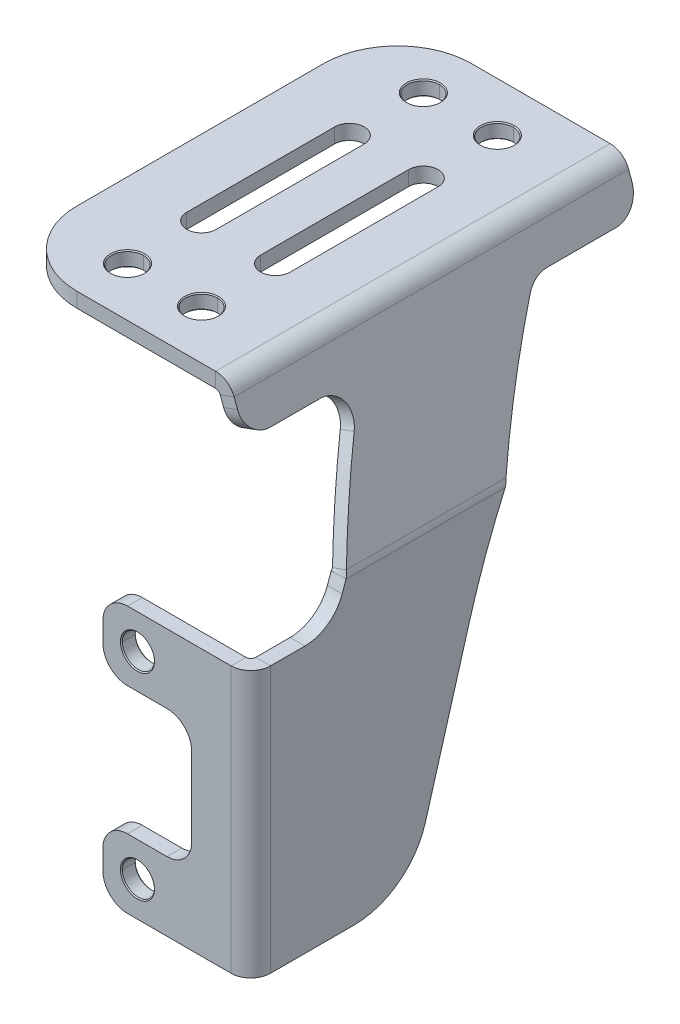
ISO-10303-21;
HEADER;
FILE_DESCRIPTION(('STEP AP214'),'2;1');
FILE_NAME('part.step','',(''),(''),'','','');
FILE_SCHEMA(('AUTOMOTIVE_DESIGN { 1 0 10303 214 1 1 1 1 }'));
ENDSEC;
DATA;
#1=APPLICATION_CONTEXT('core data for automotive mechanical design processes');
#2=APPLICATION_PROTOCOL_DEFINITION('international standard','automotive_design',2000,#1);
#3=PRODUCT_CONTEXT('',#1,'mechanical');
#4=PRODUCT('Part','Part','',(#3));
#5=PRODUCT_RELATED_PRODUCT_CATEGORY('part','',(#4));
#6=PRODUCT_DEFINITION_FORMATION('','',#4);
#7=PRODUCT_DEFINITION_CONTEXT('part definition',#1,'design');
#8=PRODUCT_DEFINITION('design','',#6,#7);
#9=PRODUCT_DEFINITION_SHAPE('','',#8);
#10=(LENGTH_UNIT() NAMED_UNIT(*) SI_UNIT(.MILLI.,.METRE.));
#11=(NAMED_UNIT(*) PLANE_ANGLE_UNIT() SI_UNIT($,.RADIAN.));
#12=(NAMED_UNIT(*) SI_UNIT($,.STERADIAN.) SOLID_ANGLE_UNIT());
#13=UNCERTAINTY_MEASURE_WITH_UNIT(LENGTH_MEASURE(1.E-05),#10,'distance_accuracy_value','');
#14=(GEOMETRIC_REPRESENTATION_CONTEXT(3) GLOBAL_UNCERTAINTY_ASSIGNED_CONTEXT((#13)) GLOBAL_UNIT_ASSIGNED_CONTEXT((#10,
#11,#12)) REPRESENTATION_CONTEXT('',''));
#15=CARTESIAN_POINT('',(0.,0.,0.));
#16=DIRECTION('',(0.,0.,1.));
#17=DIRECTION('',(1.,0.,0.));
#18=AXIS2_PLACEMENT_3D('',#15,#16,#17);
#19=CARTESIAN_POINT('',(45.,-20.,2.8));
#20=DIRECTION('',(0.,0.,1.));
#21=DIRECTION('',(1.,0.,0.));
#22=AXIS2_PLACEMENT_3D('',#19,#20,#21);
#23=CONICAL_SURFACE('',#22,3.25,0.785398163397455);
#24=DIRECTION('',(-0.707106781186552,0.,0.707106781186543));
#25=VECTOR('',#24,1.);
#26=CARTESIAN_POINT('',(41.75,-20.,2.8));
#27=LINE('',#26,#25);
#28=CARTESIAN_POINT('',(41.75,-20.,2.8));
#29=VERTEX_POINT('',#28);
#30=CARTESIAN_POINT('',(41.55,-20.,3.));
#31=VERTEX_POINT('',#30);
#32=EDGE_CURVE('E2737',#29,#31,#27,.T.);
#33=ORIENTED_EDGE('',*,*,#32,.F.);
#34=CARTESIAN_POINT('',(45.,-20.,2.8));
#35=DIRECTION('',(0.,0.,1.));
#36=DIRECTION('',(1.,0.,0.));
#37=AXIS2_PLACEMENT_3D('',#34,#35,#36);
#38=CIRCLE('',#37,3.25);
#39=CARTESIAN_POINT('',(48.25,-20.,2.8));
#40=VERTEX_POINT('',#39);
#41=EDGE_CURVE('E1068',#40,#29,#38,.T.);
#42=ORIENTED_EDGE('',*,*,#41,.F.);
#43=DIRECTION('',(0.707106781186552,0.,0.707106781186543));
#44=VECTOR('',#43,1.);
#45=CARTESIAN_POINT('',(48.25,-20.,2.8));
#46=LINE('',#45,#44);
#47=CARTESIAN_POINT('',(48.45,-20.,3.));
#48=VERTEX_POINT('',#47);
#49=EDGE_CURVE('E1815',#40,#48,#46,.T.);
#50=ORIENTED_EDGE('',*,*,#49,.T.);
#51=CARTESIAN_POINT('',(45.,-20.,3.));
#52=DIRECTION('',(0.,0.,-1.));
#53=DIRECTION('',(1.,0.,0.));
#54=AXIS2_PLACEMENT_3D('',#51,#52,#53);
#55=CIRCLE('',#54,3.45);
#56=EDGE_CURVE('E792',#31,#48,#55,.T.);
#57=ORIENTED_EDGE('',*,*,#56,.F.);
#58=EDGE_LOOP('',(#33,#42,#50,#57));
#59=FACE_BOUND('',#58,.T.);
#60=ADVANCED_FACE('F17',(#59),#23,.F.);
#61=CARTESIAN_POINT('',(45.,-20.,0.));
#62=DIRECTION('',(0.,0.,-1.));
#63=DIRECTION('',(-1.,0.,0.));
#64=AXIS2_PLACEMENT_3D('',#61,#62,#63);
#65=CONICAL_SURFACE('',#64,3.44999999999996,0.785398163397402);
#66=DIRECTION('',(0.707106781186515,0.,-0.70710678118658));
#67=VECTOR('',#66,1.);
#68=CARTESIAN_POINT('',(48.45,-20.,0.));
#69=LINE('',#68,#67);
#70=CARTESIAN_POINT('',(48.25,-20.,0.199999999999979));
#71=VERTEX_POINT('',#70);
#72=CARTESIAN_POINT('',(48.45,-20.,0.));
#73=VERTEX_POINT('',#72);
#74=EDGE_CURVE('E686',#71,#73,#69,.T.);
#75=ORIENTED_EDGE('',*,*,#74,.F.);
#76=CARTESIAN_POINT('',(45.,-20.,0.199999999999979));
#77=DIRECTION('',(0.,0.,-1.));
#78=DIRECTION('',(1.,0.,0.));
#79=AXIS2_PLACEMENT_3D('',#76,#77,#78);
#80=CIRCLE('',#79,3.25);
#81=CARTESIAN_POINT('',(41.75,-20.,0.199999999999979));
#82=VERTEX_POINT('',#81);
#83=EDGE_CURVE('E1065',#82,#71,#80,.T.);
#84=ORIENTED_EDGE('',*,*,#83,.F.);
#85=DIRECTION('',(-0.707106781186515,0.,-0.70710678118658));
#86=VECTOR('',#85,1.);
#87=CARTESIAN_POINT('',(41.55,-20.,0.));
#88=LINE('',#87,#86);
#89=CARTESIAN_POINT('',(41.55,-20.,0.));
#90=VERTEX_POINT('',#89);
#91=EDGE_CURVE('E667',#82,#90,#88,.T.);
#92=ORIENTED_EDGE('',*,*,#91,.T.);
#93=CARTESIAN_POINT('',(45.,-20.,0.));
#94=DIRECTION('',(0.,0.,1.));
#95=DIRECTION('',(1.,0.,0.));
#96=AXIS2_PLACEMENT_3D('',#93,#94,#95);
#97=CIRCLE('',#96,3.44999999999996);
#98=EDGE_CURVE('E984',#73,#90,#97,.T.);
#99=ORIENTED_EDGE('',*,*,#98,.F.);
#100=EDGE_LOOP('',(#75,#84,#92,#99));
#101=FACE_BOUND('',#100,.T.);
#102=ADVANCED_FACE('F19',(#101),#65,.F.);
#103=CARTESIAN_POINT('',(45.,20.,2.8));
#104=DIRECTION('',(0.,0.,1.));
#105=DIRECTION('',(1.,0.,0.));
#106=AXIS2_PLACEMENT_3D('',#103,#104,#105);
#107=CONICAL_SURFACE('',#106,3.25,0.785398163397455);
#108=DIRECTION('',(-0.707106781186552,0.,0.707106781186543));
#109=VECTOR('',#108,1.);
#110=CARTESIAN_POINT('',(41.75,20.,2.8));
#111=LINE('',#110,#109);
#112=CARTESIAN_POINT('',(41.75,20.,2.8));
#113=VERTEX_POINT('',#112);
#114=CARTESIAN_POINT('',(41.55,20.,3.));
#115=VERTEX_POINT('',#114);
#116=EDGE_CURVE('E637',#113,#115,#111,.T.);
#117=ORIENTED_EDGE('',*,*,#116,.F.);
#118=CARTESIAN_POINT('',(45.,20.,2.8));
#119=DIRECTION('',(0.,0.,1.));
#120=DIRECTION('',(1.,0.,0.));
#121=AXIS2_PLACEMENT_3D('',#118,#119,#120);
#122=CIRCLE('',#121,3.25);
#123=CARTESIAN_POINT('',(48.25,20.,2.8));
#124=VERTEX_POINT('',#123);
#125=EDGE_CURVE('E630',#124,#113,#122,.T.);
#126=ORIENTED_EDGE('',*,*,#125,.F.);
#127=DIRECTION('',(0.707106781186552,0.,0.707106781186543));
#128=VECTOR('',#127,1.);
#129=CARTESIAN_POINT('',(48.25,20.,2.8));
#130=LINE('',#129,#128);
#131=CARTESIAN_POINT('',(48.45,20.,3.));
#132=VERTEX_POINT('',#131);
#133=EDGE_CURVE('E634',#124,#132,#130,.T.);
#134=ORIENTED_EDGE('',*,*,#133,.T.);
#135=CARTESIAN_POINT('',(45.,20.,3.));
#136=DIRECTION('',(0.,0.,-1.));
#137=DIRECTION('',(1.,0.,0.));
#138=AXIS2_PLACEMENT_3D('',#135,#136,#137);
#139=CIRCLE('',#138,3.45);
#140=EDGE_CURVE('E695',#115,#132,#139,.T.);
#141=ORIENTED_EDGE('',*,*,#140,.F.);
#142=EDGE_LOOP('',(#117,#126,#134,#141));
#143=FACE_BOUND('',#142,.T.);
#144=ADVANCED_FACE('F632',(#143),#107,.F.);
#145=CARTESIAN_POINT('',(45.,20.,0.));
#146=DIRECTION('',(0.,0.,-1.));
#147=DIRECTION('',(-1.,0.,0.));
#148=AXIS2_PLACEMENT_3D('',#145,#146,#147);
#149=CONICAL_SURFACE('',#148,3.44999999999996,0.785398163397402);
#150=DIRECTION('',(0.707106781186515,0.,-0.70710678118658));
#151=VECTOR('',#150,1.);
#152=CARTESIAN_POINT('',(48.45,20.,0.));
#153=LINE('',#152,#151);
#154=CARTESIAN_POINT('',(48.25,20.,0.199999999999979));
#155=VERTEX_POINT('',#154);
#156=CARTESIAN_POINT('',(48.45,20.,0.));
#157=VERTEX_POINT('',#156);
#158=EDGE_CURVE('E717',#155,#157,#153,.T.);
#159=ORIENTED_EDGE('',*,*,#158,.F.);
#160=CARTESIAN_POINT('',(45.,20.,0.199999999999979));
#161=DIRECTION('',(0.,0.,-1.));
#162=DIRECTION('',(1.,0.,0.));
#163=AXIS2_PLACEMENT_3D('',#160,#161,#162);
#164=CIRCLE('',#163,3.25);
#165=CARTESIAN_POINT('',(41.75,20.,0.199999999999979));
#166=VERTEX_POINT('',#165);
#167=EDGE_CURVE('E644',#166,#155,#164,.T.);
#168=ORIENTED_EDGE('',*,*,#167,.F.);
#169=DIRECTION('',(-0.707106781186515,0.,-0.70710678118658));
#170=VECTOR('',#169,1.);
#171=CARTESIAN_POINT('',(41.55,20.,0.));
#172=LINE('',#171,#170);
#173=CARTESIAN_POINT('',(41.55,20.,0.));
#174=VERTEX_POINT('',#173);
#175=EDGE_CURVE('E716',#166,#174,#172,.T.);
#176=ORIENTED_EDGE('',*,*,#175,.T.);
#177=CARTESIAN_POINT('',(45.,20.,0.));
#178=DIRECTION('',(0.,0.,1.));
#179=DIRECTION('',(1.,0.,0.));
#180=AXIS2_PLACEMENT_3D('',#177,#178,#179);
#181=CIRCLE('',#180,3.44999999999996);
#182=EDGE_CURVE('E981',#157,#174,#181,.T.);
#183=ORIENTED_EDGE('',*,*,#182,.F.);
#184=EDGE_LOOP('',(#159,#168,#176,#183));
#185=FACE_BOUND('',#184,.T.);
#186=ADVANCED_FACE('F1784',(#185),#149,.F.);
#187=CARTESIAN_POINT('',(25.0000000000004,66.3635059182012,-15.));
#188=DIRECTION('',(0.,-1.,0.));
#189=DIRECTION('',(0.,0.,-1.));
#190=AXIS2_PLACEMENT_3D('',#187,#188,#189);
#191=CONICAL_SURFACE('',#190,3.25,0.785398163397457);
#192=DIRECTION('',(0.,-0.707106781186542,0.707106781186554));
#193=VECTOR('',#192,1.);
#194=CARTESIAN_POINT('',(25.0000000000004,66.3635059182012,-11.7500000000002));
#195=LINE('',#194,#193);
#196=CARTESIAN_POINT('',(25.0000000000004,66.3635059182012,-11.7500000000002));
#197=VERTEX_POINT('',#196);
#198=CARTESIAN_POINT('',(25.0000000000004,66.1635059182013,-11.5500000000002));
#199=VERTEX_POINT('',#198);
#200=EDGE_CURVE('E740',#197,#199,#195,.T.);
#201=ORIENTED_EDGE('',*,*,#200,.F.);
#202=CARTESIAN_POINT('',(25.0000000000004,66.3635059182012,-15.));
#203=DIRECTION('',(0.,-1.,0.));
#204=DIRECTION('',(0.,0.,-1.));
#205=AXIS2_PLACEMENT_3D('',#202,#203,#204);
#206=CIRCLE('',#205,3.25);
#207=CARTESIAN_POINT('',(25.0000000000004,66.3635059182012,-18.25));
#208=VERTEX_POINT('',#207);
#209=EDGE_CURVE('E643',#208,#197,#206,.T.);
#210=ORIENTED_EDGE('',*,*,#209,.F.);
#211=DIRECTION('',(0.,-0.707106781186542,-0.707106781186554));
#212=VECTOR('',#211,1.);
#213=CARTESIAN_POINT('',(25.0000000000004,66.3635059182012,-18.25));
#214=LINE('',#213,#212);
#215=CARTESIAN_POINT('',(25.0000000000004,66.1635059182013,-18.45));
#216=VERTEX_POINT('',#215);
#217=EDGE_CURVE('E748',#208,#216,#214,.T.);
#218=ORIENTED_EDGE('',*,*,#217,.T.);
#219=CARTESIAN_POINT('',(25.0000000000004,66.1635059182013,-15.));
#220=DIRECTION('',(0.,1.,0.));
#221=DIRECTION('',(1.,0.,0.));
#222=AXIS2_PLACEMENT_3D('',#219,#220,#221);
#223=CIRCLE('',#222,3.45);
#224=EDGE_CURVE('E1126',#199,#216,#223,.T.);
#225=ORIENTED_EDGE('',*,*,#224,.F.);
#226=EDGE_LOOP('',(#201,#210,#218,#225));
#227=FACE_BOUND('',#226,.T.);
#228=ADVANCED_FACE('F1782',(#227),#191,.F.);
#229=CARTESIAN_POINT('',(25.0000000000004,68.9635059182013,-15.));
#230=DIRECTION('',(0.,1.,0.));
#231=DIRECTION('',(0.,0.,1.));
#232=AXIS2_PLACEMENT_3D('',#229,#230,#231);
#233=CONICAL_SURFACE('',#232,3.25,0.785398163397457);
#234=DIRECTION('',(0.,0.707106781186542,-0.707106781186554));
#235=VECTOR('',#234,1.);
#236=CARTESIAN_POINT('',(25.0000000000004,68.9635059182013,-18.25));
#237=LINE('',#236,#235);
#238=CARTESIAN_POINT('',(25.0000000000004,68.9635059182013,-18.25));
#239=VERTEX_POINT('',#238);
#240=CARTESIAN_POINT('',(25.0000000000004,69.1635059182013,-18.45));
#241=VERTEX_POINT('',#240);
#242=EDGE_CURVE('E770',#239,#241,#237,.T.);
#243=ORIENTED_EDGE('',*,*,#242,.F.);
#244=CARTESIAN_POINT('',(25.0000000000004,68.9635059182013,-15.));
#245=DIRECTION('',(0.,1.,0.));
#246=DIRECTION('',(0.,0.,-1.));
#247=AXIS2_PLACEMENT_3D('',#244,#245,#246);
#248=CIRCLE('',#247,3.25);
#249=CARTESIAN_POINT('',(25.0000000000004,68.9635059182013,-11.7500000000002));
#250=VERTEX_POINT('',#249);
#251=EDGE_CURVE('E800',#250,#239,#248,.T.);
#252=ORIENTED_EDGE('',*,*,#251,.F.);
#253=DIRECTION('',(0.,0.707106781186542,0.707106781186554));
#254=VECTOR('',#253,1.);
#255=CARTESIAN_POINT('',(25.0000000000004,68.9635059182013,-11.7500000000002));
#256=LINE('',#255,#254);
#257=CARTESIAN_POINT('',(25.0000000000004,69.1635059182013,-11.5500000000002));
#258=VERTEX_POINT('',#257);
#259=EDGE_CURVE('E706',#250,#258,#256,.T.);
#260=ORIENTED_EDGE('',*,*,#259,.T.);
#261=CARTESIAN_POINT('',(25.0000000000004,69.1635059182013,-15.));
#262=DIRECTION('',(0.,-1.,0.));
#263=DIRECTION('',(1.,0.,0.));
#264=AXIS2_PLACEMENT_3D('',#261,#262,#263);
#265=CIRCLE('',#264,3.45);
#266=EDGE_CURVE('E1334',#241,#258,#265,.T.);
#267=ORIENTED_EDGE('',*,*,#266,.F.);
#268=EDGE_LOOP('',(#243,#252,#260,#267));
#269=FACE_BOUND('',#268,.T.);
#270=ADVANCED_FACE('F1779',(#269),#233,.F.);
#271=CARTESIAN_POINT('',(40.,66.3635059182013,-15.0000000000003));
#272=DIRECTION('',(0.,-1.,0.));
#273=DIRECTION('',(0.,0.,-1.));
#274=AXIS2_PLACEMENT_3D('',#271,#272,#273);
#275=CONICAL_SURFACE('',#274,3.25,0.785398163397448);
#276=DIRECTION('',(0.,-0.707106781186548,0.707106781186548));
#277=VECTOR('',#276,1.);
#278=CARTESIAN_POINT('',(40.,66.3635059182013,-11.7500000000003));
#279=LINE('',#278,#277);
#280=CARTESIAN_POINT('',(40.,66.3635059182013,-11.7500000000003));
#281=VERTEX_POINT('',#280);
#282=CARTESIAN_POINT('',(40.,66.1635059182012,-11.5500000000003));
#283=VERTEX_POINT('',#282);
#284=EDGE_CURVE('E780',#281,#283,#279,.T.);
#285=ORIENTED_EDGE('',*,*,#284,.F.);
#286=CARTESIAN_POINT('',(40.,66.3635059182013,-15.0000000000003));
#287=DIRECTION('',(0.,-1.,0.));
#288=DIRECTION('',(0.,0.,-1.));
#289=AXIS2_PLACEMENT_3D('',#286,#287,#288);
#290=CIRCLE('',#289,3.25);
#291=CARTESIAN_POINT('',(40.,66.3635059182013,-18.2500000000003));
#292=VERTEX_POINT('',#291);
#293=EDGE_CURVE('E1188',#292,#281,#290,.T.);
#294=ORIENTED_EDGE('',*,*,#293,.F.);
#295=DIRECTION('',(0.,-0.707106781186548,-0.707106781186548));
#296=VECTOR('',#295,1.);
#297=CARTESIAN_POINT('',(40.,66.3635059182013,-18.2500000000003));
#298=LINE('',#297,#296);
#299=CARTESIAN_POINT('',(40.,66.1635059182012,-18.4500000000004));
#300=VERTEX_POINT('',#299);
#301=EDGE_CURVE('E810',#292,#300,#298,.T.);
#302=ORIENTED_EDGE('',*,*,#301,.T.);
#303=CARTESIAN_POINT('',(40.,66.1635059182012,-15.0000000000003));
#304=DIRECTION('',(0.,1.,0.));
#305=DIRECTION('',(1.,0.,0.));
#306=AXIS2_PLACEMENT_3D('',#303,#304,#305);
#307=CIRCLE('',#306,3.45000000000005);
#308=EDGE_CURVE('E1123',#283,#300,#307,.T.);
#309=ORIENTED_EDGE('',*,*,#308,.F.);
#310=EDGE_LOOP('',(#285,#294,#302,#309));
#311=FACE_BOUND('',#310,.T.);
#312=ADVANCED_FACE('F1776',(#311),#275,.F.);
#313=CARTESIAN_POINT('',(40.,68.9635059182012,-15.0000000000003));
#314=DIRECTION('',(0.,1.,0.));
#315=DIRECTION('',(0.,0.,1.));
#316=AXIS2_PLACEMENT_3D('',#313,#314,#315);
#317=CONICAL_SURFACE('',#316,3.25,0.785398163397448);
#318=DIRECTION('',(0.,0.707106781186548,-0.707106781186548));
#319=VECTOR('',#318,1.);
#320=CARTESIAN_POINT('',(40.,68.9635059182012,-18.2500000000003));
#321=LINE('',#320,#319);
#322=CARTESIAN_POINT('',(40.,68.9635059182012,-18.2500000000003));
#323=VERTEX_POINT('',#322);
#324=CARTESIAN_POINT('',(40.,69.1635059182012,-18.4500000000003));
#325=VERTEX_POINT('',#324);
#326=EDGE_CURVE('E830',#323,#325,#321,.T.);
#327=ORIENTED_EDGE('',*,*,#326,.F.);
#328=CARTESIAN_POINT('',(40.,68.9635059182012,-15.0000000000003));
#329=DIRECTION('',(0.,1.,0.));
#330=DIRECTION('',(0.,0.,-1.));
#331=AXIS2_PLACEMENT_3D('',#328,#329,#330);
#332=CIRCLE('',#331,3.25);
#333=CARTESIAN_POINT('',(40.,68.9635059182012,-11.7500000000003));
#334=VERTEX_POINT('',#333);
#335=EDGE_CURVE('E1191',#334,#323,#332,.T.);
#336=ORIENTED_EDGE('',*,*,#335,.F.);
#337=DIRECTION('',(0.,0.707106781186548,0.707106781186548));
#338=VECTOR('',#337,1.);
#339=CARTESIAN_POINT('',(40.,68.9635059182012,-11.7500000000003));
#340=LINE('',#339,#338);
#341=CARTESIAN_POINT('',(40.,69.1635059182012,-11.5500000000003));
#342=VERTEX_POINT('',#341);
#343=EDGE_CURVE('E822',#334,#342,#340,.T.);
#344=ORIENTED_EDGE('',*,*,#343,.T.);
#345=CARTESIAN_POINT('',(40.,69.1635059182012,-15.0000000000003));
#346=DIRECTION('',(0.,-1.,0.));
#347=DIRECTION('',(1.,0.,0.));
#348=AXIS2_PLACEMENT_3D('',#345,#346,#347);
#349=CIRCLE('',#348,3.45);
#350=EDGE_CURVE('E1161',#325,#342,#349,.T.);
#351=ORIENTED_EDGE('',*,*,#350,.F.);
#352=EDGE_LOOP('',(#327,#336,#344,#351));
#353=FACE_BOUND('',#352,.T.);
#354=ADVANCED_FACE('F1732',(#353),#317,.F.);
#355=CARTESIAN_POINT('',(40.,66.3635059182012,-75.));
#356=DIRECTION('',(0.,-1.,0.));
#357=DIRECTION('',(0.,0.,-1.));
#358=AXIS2_PLACEMENT_3D('',#355,#356,#357);
#359=CONICAL_SURFACE('',#358,3.25,0.78539816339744);
#360=DIRECTION('',(0.,-0.707106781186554,0.707106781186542));
#361=VECTOR('',#360,1.);
#362=CARTESIAN_POINT('',(40.,66.3635059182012,-71.75));
#363=LINE('',#362,#361);
#364=CARTESIAN_POINT('',(40.,66.3635059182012,-71.75));
#365=VERTEX_POINT('',#364);
#366=CARTESIAN_POINT('',(40.,66.1635059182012,-71.55));
#367=VERTEX_POINT('',#366);
#368=EDGE_CURVE('E821',#365,#367,#363,.T.);
#369=ORIENTED_EDGE('',*,*,#368,.F.);
#370=CARTESIAN_POINT('',(40.,66.3635059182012,-75.));
#371=DIRECTION('',(0.,-1.,0.));
#372=DIRECTION('',(0.,0.,-1.));
#373=AXIS2_PLACEMENT_3D('',#370,#371,#372);
#374=CIRCLE('',#373,3.25);
#375=CARTESIAN_POINT('',(40.,66.3635059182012,-78.25));
#376=VERTEX_POINT('',#375);
#377=EDGE_CURVE('E1403',#376,#365,#374,.T.);
#378=ORIENTED_EDGE('',*,*,#377,.F.);
#379=DIRECTION('',(0.,-0.707106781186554,-0.707106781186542));
#380=VECTOR('',#379,1.);
#381=CARTESIAN_POINT('',(40.,66.3635059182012,-78.25));
#382=LINE('',#381,#380);
#383=CARTESIAN_POINT('',(40.,66.1635059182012,-78.45));
#384=VERTEX_POINT('',#383);
#385=EDGE_CURVE('E859',#376,#384,#382,.T.);
#386=ORIENTED_EDGE('',*,*,#385,.T.);
#387=CARTESIAN_POINT('',(40.,66.1635059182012,-75.));
#388=DIRECTION('',(0.,1.,0.));
#389=DIRECTION('',(1.,0.,0.));
#390=AXIS2_PLACEMENT_3D('',#387,#388,#389);
#391=CIRCLE('',#390,3.45);
#392=EDGE_CURVE('E1127',#367,#384,#391,.T.);
#393=ORIENTED_EDGE('',*,*,#392,.F.);
#394=EDGE_LOOP('',(#369,#378,#386,#393));
#395=FACE_BOUND('',#394,.T.);
#396=ADVANCED_FACE('F1728',(#395),#359,.F.);
#397=CARTESIAN_POINT('',(40.,68.9635059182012,-75.));
#398=DIRECTION('',(0.,1.,0.));
#399=DIRECTION('',(0.,0.,1.));
#400=AXIS2_PLACEMENT_3D('',#397,#398,#399);
#401=CONICAL_SURFACE('',#400,3.25,0.785398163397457);
#402=DIRECTION('',(0.,0.707106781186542,-0.707106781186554));
#403=VECTOR('',#402,1.);
#404=CARTESIAN_POINT('',(40.,68.9635059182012,-78.25));
#405=LINE('',#404,#403);
#406=CARTESIAN_POINT('',(40.,68.9635059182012,-78.25));
#407=VERTEX_POINT('',#406);
#408=CARTESIAN_POINT('',(40.,69.1635059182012,-78.45));
#409=VERTEX_POINT('',#408);
#410=EDGE_CURVE('E864',#407,#409,#405,.T.);
#411=ORIENTED_EDGE('',*,*,#410,.F.);
#412=CARTESIAN_POINT('',(40.,68.9635059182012,-75.));
#413=DIRECTION('',(0.,1.,0.));
#414=DIRECTION('',(0.,0.,-1.));
#415=AXIS2_PLACEMENT_3D('',#412,#413,#414);
#416=CIRCLE('',#415,3.25);
#417=CARTESIAN_POINT('',(40.,68.9635059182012,-71.75));
#418=VERTEX_POINT('',#417);
#419=EDGE_CURVE('E1406',#418,#407,#416,.T.);
#420=ORIENTED_EDGE('',*,*,#419,.F.);
#421=DIRECTION('',(0.,0.707106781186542,0.707106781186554));
#422=VECTOR('',#421,1.);
#423=CARTESIAN_POINT('',(40.,68.9635059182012,-71.75));
#424=LINE('',#423,#422);
#425=CARTESIAN_POINT('',(40.,69.1635059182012,-71.55));
#426=VERTEX_POINT('',#425);
#427=EDGE_CURVE('E884',#418,#426,#424,.T.);
#428=ORIENTED_EDGE('',*,*,#427,.T.);
#429=CARTESIAN_POINT('',(40.,69.1635059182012,-75.));
#430=DIRECTION('',(0.,-1.,0.));
#431=DIRECTION('',(1.,0.,0.));
#432=AXIS2_PLACEMENT_3D('',#429,#430,#431);
#433=CIRCLE('',#432,3.45);
#434=EDGE_CURVE('E1158',#409,#426,#433,.T.);
#435=ORIENTED_EDGE('',*,*,#434,.F.);
#436=EDGE_LOOP('',(#411,#420,#428,#435));
#437=FACE_BOUND('',#436,.T.);
#438=ADVANCED_FACE('F1731',(#437),#401,.F.);
#439=CARTESIAN_POINT('',(25.0000000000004,66.3635059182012,-75.));
#440=DIRECTION('',(0.,-1.,0.));
#441=DIRECTION('',(0.,0.,-1.));
#442=AXIS2_PLACEMENT_3D('',#439,#440,#441);
#443=CONICAL_SURFACE('',#442,3.25,0.785398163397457);
#444=DIRECTION('',(0.,-0.707106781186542,0.707106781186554));
#445=VECTOR('',#444,1.);
#446=CARTESIAN_POINT('',(25.0000000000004,66.3635059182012,-71.75));
#447=LINE('',#446,#445);
#448=CARTESIAN_POINT('',(25.0000000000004,66.3635059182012,-71.75));
#449=VERTEX_POINT('',#448);
#450=CARTESIAN_POINT('',(25.0000000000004,66.1635059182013,-71.55));
#451=VERTEX_POINT('',#450);
#452=EDGE_CURVE('E806',#449,#451,#447,.T.);
#453=ORIENTED_EDGE('',*,*,#452,.F.);
#454=CARTESIAN_POINT('',(25.0000000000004,66.3635059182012,-75.));
#455=DIRECTION('',(0.,-1.,0.));
#456=DIRECTION('',(0.,0.,-1.));
#457=AXIS2_PLACEMENT_3D('',#454,#455,#456);
#458=CIRCLE('',#457,3.25);
#459=CARTESIAN_POINT('',(25.0000000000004,66.3635059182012,-78.25));
#460=VERTEX_POINT('',#459);
#461=EDGE_CURVE('E1264',#460,#449,#458,.T.);
#462=ORIENTED_EDGE('',*,*,#461,.F.);
#463=DIRECTION('',(0.,-0.707106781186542,-0.707106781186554));
#464=VECTOR('',#463,1.);
#465=CARTESIAN_POINT('',(25.0000000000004,66.3635059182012,-78.25));
#466=LINE('',#465,#464);
#467=CARTESIAN_POINT('',(25.0000000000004,66.1635059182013,-78.45));
#468=VERTEX_POINT('',#467);
#469=EDGE_CURVE('E805',#460,#468,#466,.T.);
#470=ORIENTED_EDGE('',*,*,#469,.T.);
#471=CARTESIAN_POINT('',(25.0000000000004,66.1635059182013,-75.));
#472=DIRECTION('',(0.,1.,0.));
#473=DIRECTION('',(1.,0.,0.));
#474=AXIS2_PLACEMENT_3D('',#471,#472,#473);
#475=CIRCLE('',#474,3.45);
#476=EDGE_CURVE('E1363',#451,#468,#475,.T.);
#477=ORIENTED_EDGE('',*,*,#476,.F.);
#478=EDGE_LOOP('',(#453,#462,#470,#477));
#479=FACE_BOUND('',#478,.T.);
#480=ADVANCED_FACE('F3477',(#479),#443,.F.);
#481=CARTESIAN_POINT('',(25.0000000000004,68.9635059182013,-75.));
#482=DIRECTION('',(0.,1.,0.));
#483=DIRECTION('',(0.,0.,1.));
#484=AXIS2_PLACEMENT_3D('',#481,#482,#483);
#485=CONICAL_SURFACE('',#484,3.25,0.785398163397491);
#486=DIRECTION('',(0.,0.707106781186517,-0.707106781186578));
#487=VECTOR('',#486,1.);
#488=CARTESIAN_POINT('',(25.0000000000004,68.9635059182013,-78.25));
#489=LINE('',#488,#487);
#490=CARTESIAN_POINT('',(25.0000000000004,68.9635059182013,-78.25));
#491=VERTEX_POINT('',#490);
#492=CARTESIAN_POINT('',(25.0000000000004,69.1635059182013,-78.45));
#493=VERTEX_POINT('',#492);
#494=EDGE_CURVE('E911',#491,#493,#489,.T.);
#495=ORIENTED_EDGE('',*,*,#494,.F.);
#496=CARTESIAN_POINT('',(25.0000000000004,68.9635059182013,-75.));
#497=DIRECTION('',(0.,1.,0.));
#498=DIRECTION('',(0.,0.,-1.));
#499=AXIS2_PLACEMENT_3D('',#496,#497,#498);
#500=CIRCLE('',#499,3.25);
#501=CARTESIAN_POINT('',(25.0000000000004,68.9635059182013,-71.75));
#502=VERTEX_POINT('',#501);
#503=EDGE_CURVE('E1192',#502,#491,#500,.T.);
#504=ORIENTED_EDGE('',*,*,#503,.F.);
#505=DIRECTION('',(0.,0.707106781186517,0.707106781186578));
#506=VECTOR('',#505,1.);
#507=CARTESIAN_POINT('',(25.0000000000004,68.9635059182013,-71.75));
#508=LINE('',#507,#506);
#509=CARTESIAN_POINT('',(25.0000000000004,69.1635059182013,-71.55));
#510=VERTEX_POINT('',#509);
#511=EDGE_CURVE('E865',#502,#510,#508,.T.);
#512=ORIENTED_EDGE('',*,*,#511,.T.);
#513=CARTESIAN_POINT('',(25.0000000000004,69.1635059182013,-75.));
#514=DIRECTION('',(0.,-1.,0.));
#515=DIRECTION('',(1.,0.,0.));
#516=AXIS2_PLACEMENT_3D('',#513,#514,#515);
#517=CIRCLE('',#516,3.45);
#518=EDGE_CURVE('E1162',#493,#510,#517,.T.);
#519=ORIENTED_EDGE('',*,*,#518,.F.);
#520=EDGE_LOOP('',(#495,#504,#512,#519));
#521=FACE_BOUND('',#520,.T.);
#522=ADVANCED_FACE('F1774',(#521),#485,.F.);
#523=CARTESIAN_POINT('',(43.,18.,3.));
#524=DIRECTION('',(0.,0.,1.));
#525=DIRECTION('',(1.,0.,0.));
#526=AXIS2_PLACEMENT_3D('',#523,#524,#525);
#527=CYLINDRICAL_SURFACE('',#526,5.);
#528=CARTESIAN_POINT('',(43.,18.,0.));
#529=DIRECTION('',(0.,0.,-1.));
#530=DIRECTION('',(1.,0.,0.));
#531=AXIS2_PLACEMENT_3D('',#528,#529,#530);
#532=CIRCLE('',#531,5.);
#533=CARTESIAN_POINT('',(43.,13.,0.));
#534=VERTEX_POINT('',#533);
#535=CARTESIAN_POINT('',(38.,18.,0.));
#536=VERTEX_POINT('',#535);
#537=EDGE_CURVE('E988',#534,#536,#532,.T.);
#538=ORIENTED_EDGE('',*,*,#537,.F.);
#539=DIRECTION('',(0.,0.,-1.));
#540=VECTOR('',#539,1.);
#541=CARTESIAN_POINT('',(43.,13.,-7.));
#542=LINE('',#541,#540);
#543=CARTESIAN_POINT('',(43.,13.,3.));
#544=VERTEX_POINT('',#543);
#545=EDGE_CURVE('E1187',#544,#534,#542,.T.);
#546=ORIENTED_EDGE('',*,*,#545,.F.);
#547=CARTESIAN_POINT('',(43.,18.,3.));
#548=DIRECTION('',(0.,0.,1.));
#549=DIRECTION('',(1.,0.,0.));
#550=AXIS2_PLACEMENT_3D('',#547,#548,#549);
#551=CIRCLE('',#550,5.);
#552=CARTESIAN_POINT('',(38.,18.,3.));
#553=VERTEX_POINT('',#552);
#554=EDGE_CURVE('E684',#553,#544,#551,.T.);
#555=ORIENTED_EDGE('',*,*,#554,.F.);
#556=DIRECTION('',(0.,0.,1.));
#557=VECTOR('',#556,1.);
#558=CARTESIAN_POINT('',(38.,18.,3.));
#559=LINE('',#558,#557);
#560=EDGE_CURVE('E957',#536,#553,#559,.T.);
#561=ORIENTED_EDGE('',*,*,#560,.F.);
#562=EDGE_LOOP('',(#538,#546,#555,#561));
#563=FACE_BOUND('',#562,.T.);
#564=ADVANCED_FACE('F1770',(#563),#527,.T.);
#565=CARTESIAN_POINT('',(43.,-18.,3.));
#566=DIRECTION('',(0.,0.,-1.));
#567=DIRECTION('',(-1.,0.,0.));
#568=AXIS2_PLACEMENT_3D('',#565,#566,#567);
#569=CYLINDRICAL_SURFACE('',#568,5.);
#570=CARTESIAN_POINT('',(43.,-18.,3.));
#571=DIRECTION('',(0.,0.,1.));
#572=DIRECTION('',(1.,0.,0.));
#573=AXIS2_PLACEMENT_3D('',#570,#571,#572);
#574=CIRCLE('',#573,5.);
#575=CARTESIAN_POINT('',(43.,-13.,3.));
#576=VERTEX_POINT('',#575);
#577=CARTESIAN_POINT('',(38.,-18.,3.));
#578=VERTEX_POINT('',#577);
#579=EDGE_CURVE('E889',#576,#578,#574,.T.);
#580=ORIENTED_EDGE('',*,*,#579,.F.);
#581=DIRECTION('',(0.,0.,1.));
#582=VECTOR('',#581,1.);
#583=CARTESIAN_POINT('',(43.,-13.,-7.));
#584=LINE('',#583,#582);
#585=CARTESIAN_POINT('',(43.,-13.,0.));
#586=VERTEX_POINT('',#585);
#587=EDGE_CURVE('E11',#586,#576,#584,.T.);
#588=ORIENTED_EDGE('',*,*,#587,.F.);
#589=CARTESIAN_POINT('',(43.,-18.,0.));
#590=DIRECTION('',(0.,0.,-1.));
#591=DIRECTION('',(1.,0.,0.));
#592=AXIS2_PLACEMENT_3D('',#589,#590,#591);
#593=CIRCLE('',#592,5.);
#594=CARTESIAN_POINT('',(38.,-18.,0.));
#595=VERTEX_POINT('',#594);
#596=EDGE_CURVE('E1060',#595,#586,#593,.T.);
#597=ORIENTED_EDGE('',*,*,#596,.F.);
#598=DIRECTION('',(0.,0.,-1.));
#599=VECTOR('',#598,1.);
#600=CARTESIAN_POINT('',(38.,-18.,3.));
#601=LINE('',#600,#599);
#602=EDGE_CURVE('E932',#578,#595,#601,.T.);
#603=ORIENTED_EDGE('',*,*,#602,.F.);
#604=EDGE_LOOP('',(#580,#588,#597,#603));
#605=FACE_BOUND('',#604,.T.);
#606=ADVANCED_FACE('F1766',(#605),#569,.T.);
#607=CARTESIAN_POINT('',(51.,8.,-7.));
#608=DIRECTION('',(0.,0.,-1.));
#609=DIRECTION('',(-1.,0.,0.));
#610=AXIS2_PLACEMENT_3D('',#607,#608,#609);
#611=CYLINDRICAL_SURFACE('',#610,5.);
#612=CARTESIAN_POINT('',(51.,8.,0.));
#613=DIRECTION('',(0.,0.,1.));
#614=DIRECTION('',(1.,0.,0.));
#615=AXIS2_PLACEMENT_3D('',#612,#613,#614);
#616=CIRCLE('',#615,5.);
#617=CARTESIAN_POINT('',(56.,8.,0.));
#618=VERTEX_POINT('',#617);
#619=CARTESIAN_POINT('',(51.,13.,0.));
#620=VERTEX_POINT('',#619);
#621=EDGE_CURVE('E871',#618,#620,#616,.T.);
#622=ORIENTED_EDGE('',*,*,#621,.F.);
#623=DIRECTION('',(0.,0.,-1.));
#624=VECTOR('',#623,1.);
#625=CARTESIAN_POINT('',(56.,8.,0.));
#626=LINE('',#625,#624);
#627=CARTESIAN_POINT('',(56.,8.,3.));
#628=VERTEX_POINT('',#627);
#629=EDGE_CURVE('E1240',#628,#618,#626,.T.);
#630=ORIENTED_EDGE('',*,*,#629,.F.);
#631=CARTESIAN_POINT('',(51.,8.,3.));
#632=DIRECTION('',(0.,0.,-1.));
#633=DIRECTION('',(1.,0.,0.));
#634=AXIS2_PLACEMENT_3D('',#631,#632,#633);
#635=CIRCLE('',#634,5.);
#636=CARTESIAN_POINT('',(51.,13.,3.));
#637=VERTEX_POINT('',#636);
#638=EDGE_CURVE('E929',#637,#628,#635,.T.);
#639=ORIENTED_EDGE('',*,*,#638,.F.);
#640=DIRECTION('',(0.,0.,1.));
#641=VECTOR('',#640,1.);
#642=CARTESIAN_POINT('',(51.,13.,3.));
#643=LINE('',#642,#641);
#644=EDGE_CURVE('E1396',#620,#637,#643,.T.);
#645=ORIENTED_EDGE('',*,*,#644,.F.);
#646=EDGE_LOOP('',(#622,#630,#639,#645));
#647=FACE_BOUND('',#646,.T.);
#648=ADVANCED_FACE('F1769',(#647),#611,.F.);
#649=CARTESIAN_POINT('',(51.,-8.,-7.));
#650=DIRECTION('',(0.,0.,-1.));
#651=DIRECTION('',(-1.,0.,0.));
#652=AXIS2_PLACEMENT_3D('',#649,#650,#651);
#653=CYLINDRICAL_SURFACE('',#652,5.);
#654=CARTESIAN_POINT('',(51.,-8.,0.));
#655=DIRECTION('',(0.,0.,1.));
#656=DIRECTION('',(1.,0.,0.));
#657=AXIS2_PLACEMENT_3D('',#654,#655,#656);
#658=CIRCLE('',#657,5.);
#659=CARTESIAN_POINT('',(51.,-13.,0.));
#660=VERTEX_POINT('',#659);
#661=CARTESIAN_POINT('',(56.,-8.,0.));
#662=VERTEX_POINT('',#661);
#663=EDGE_CURVE('E1073',#660,#662,#658,.T.);
#664=ORIENTED_EDGE('',*,*,#663,.F.);
#665=DIRECTION('',(0.,0.,-1.));
#666=VECTOR('',#665,1.);
#667=CARTESIAN_POINT('',(51.,-13.,0.));
#668=LINE('',#667,#666);
#669=CARTESIAN_POINT('',(51.,-13.,3.));
#670=VERTEX_POINT('',#669);
#671=EDGE_CURVE('E27',#670,#660,#668,.T.);
#672=ORIENTED_EDGE('',*,*,#671,.F.);
#673=CARTESIAN_POINT('',(51.,-8.,3.));
#674=DIRECTION('',(0.,0.,-1.));
#675=DIRECTION('',(1.,0.,0.));
#676=AXIS2_PLACEMENT_3D('',#673,#674,#675);
#677=CIRCLE('',#676,5.);
#678=CARTESIAN_POINT('',(56.,-8.,3.));
#679=VERTEX_POINT('',#678);
#680=EDGE_CURVE('E691',#679,#670,#677,.T.);
#681=ORIENTED_EDGE('',*,*,#680,.F.);
#682=DIRECTION('',(0.,0.,1.));
#683=VECTOR('',#682,1.);
#684=CARTESIAN_POINT('',(56.,-8.,3.));
#685=LINE('',#684,#683);
#686=EDGE_CURVE('E1237',#662,#679,#685,.T.);
#687=ORIENTED_EDGE('',*,*,#686,.F.);
#688=EDGE_LOOP('',(#664,#672,#681,#687));
#689=FACE_BOUND('',#688,.T.);
#690=ADVANCED_FACE('F1764',(#689),#653,.F.);
#691=CARTESIAN_POINT('',(38.,-13.,-7.));
#692=DIRECTION('',(0.,-1.,0.));
#693=DIRECTION('',(0.,0.,-1.));
#694=AXIS2_PLACEMENT_3D('',#691,#692,#693);
#695=PLANE('',#694);
#696=DIRECTION('',(1.,0.,0.));
#697=VECTOR('',#696,1.);
#698=CARTESIAN_POINT('',(38.,-13.,3.));
#699=LINE('',#698,#697);
#700=EDGE_CURVE('E894',#576,#670,#699,.T.);
#701=ORIENTED_EDGE('',*,*,#700,.T.);
#702=ORIENTED_EDGE('',*,*,#671,.T.);
#703=DIRECTION('',(1.,0.,0.));
#704=VECTOR('',#703,1.);
#705=CARTESIAN_POINT('',(0.,-13.,0.));
#706=LINE('',#705,#704);
#707=EDGE_CURVE('E1064',#586,#660,#706,.T.);
#708=ORIENTED_EDGE('',*,*,#707,.F.);
#709=ORIENTED_EDGE('',*,*,#587,.T.);
#710=EDGE_LOOP('',(#701,#702,#708,#709));
#711=FACE_BOUND('',#710,.T.);
#712=ADVANCED_FACE('F1760',(#711),#695,.F.);
#713=CARTESIAN_POINT('',(38.,13.,-7.));
#714=DIRECTION('',(0.,1.,0.));
#715=DIRECTION('',(1.,0.,0.));
#716=AXIS2_PLACEMENT_3D('',#713,#714,#715);
#717=PLANE('',#716);
#718=DIRECTION('',(-1.,0.,0.));
#719=VECTOR('',#718,1.);
#720=CARTESIAN_POINT('',(0.,13.,0.));
#721=LINE('',#720,#719);
#722=EDGE_CURVE('E875',#620,#534,#721,.T.);
#723=ORIENTED_EDGE('',*,*,#722,.F.);
#724=ORIENTED_EDGE('',*,*,#644,.T.);
#725=DIRECTION('',(-1.,0.,0.));
#726=VECTOR('',#725,1.);
#727=CARTESIAN_POINT('',(38.,13.,3.));
#728=LINE('',#727,#726);
#729=EDGE_CURVE('E752',#637,#544,#728,.T.);
#730=ORIENTED_EDGE('',*,*,#729,.T.);
#731=ORIENTED_EDGE('',*,*,#545,.T.);
#732=EDGE_LOOP('',(#723,#724,#730,#731));
#733=FACE_BOUND('',#732,.T.);
#734=ADVANCED_FACE('F1763',(#733),#717,.F.);
#735=CARTESIAN_POINT('',(56.,13.,-7.));
#736=DIRECTION('',(1.,0.,0.));
#737=DIRECTION('',(0.,1.,0.));
#738=AXIS2_PLACEMENT_3D('',#735,#736,#737);
#739=PLANE('',#738);
#740=DIRECTION('',(0.,1.,0.));
#741=VECTOR('',#740,1.);
#742=CARTESIAN_POINT('',(56.,0.,0.));
#743=LINE('',#742,#741);
#744=EDGE_CURVE('E876',#662,#618,#743,.T.);
#745=ORIENTED_EDGE('',*,*,#744,.F.);
#746=ORIENTED_EDGE('',*,*,#686,.T.);
#747=DIRECTION('',(0.,1.,0.));
#748=VECTOR('',#747,1.);
#749=CARTESIAN_POINT('',(56.,13.,3.));
#750=LINE('',#749,#748);
#751=EDGE_CURVE('E696',#679,#628,#750,.T.);
#752=ORIENTED_EDGE('',*,*,#751,.T.);
#753=ORIENTED_EDGE('',*,*,#629,.T.);
#754=EDGE_LOOP('',(#745,#746,#752,#753));
#755=FACE_BOUND('',#754,.T.);
#756=ADVANCED_FACE('F2829',(#755),#739,.F.);
#757=CARTESIAN_POINT('',(43.,22.,3.));
#758=DIRECTION('',(0.,0.,-1.));
#759=DIRECTION('',(-1.,0.,0.));
#760=AXIS2_PLACEMENT_3D('',#757,#758,#759);
#761=CYLINDRICAL_SURFACE('',#760,5.);
#762=CARTESIAN_POINT('',(43.,22.,3.));
#763=DIRECTION('',(0.,0.,1.));
#764=DIRECTION('',(1.,0.,0.));
#765=AXIS2_PLACEMENT_3D('',#762,#763,#764);
#766=CIRCLE('',#765,5.);
#767=CARTESIAN_POINT('',(43.,27.,3.));
#768=VERTEX_POINT('',#767);
#769=CARTESIAN_POINT('',(38.,22.,3.));
#770=VERTEX_POINT('',#769);
#771=EDGE_CURVE('E681',#768,#770,#766,.T.);
#772=ORIENTED_EDGE('',*,*,#771,.F.);
#773=DIRECTION('',(0.,0.,1.));
#774=VECTOR('',#773,1.);
#775=CARTESIAN_POINT('',(43.,27.,3.));
#776=LINE('',#775,#774);
#777=CARTESIAN_POINT('',(43.,27.,0.));
#778=VERTEX_POINT('',#777);
#779=EDGE_CURVE('E1009',#778,#768,#776,.T.);
#780=ORIENTED_EDGE('',*,*,#779,.F.);
#781=CARTESIAN_POINT('',(43.,22.,0.));
#782=DIRECTION('',(0.,0.,-1.));
#783=DIRECTION('',(1.,0.,0.));
#784=AXIS2_PLACEMENT_3D('',#781,#782,#783);
#785=CIRCLE('',#784,5.);
#786=CARTESIAN_POINT('',(38.,22.,0.));
#787=VERTEX_POINT('',#786);
#788=EDGE_CURVE('E974',#787,#778,#785,.T.);
#789=ORIENTED_EDGE('',*,*,#788,.F.);
#790=DIRECTION('',(0.,0.,-1.));
#791=VECTOR('',#790,1.);
#792=CARTESIAN_POINT('',(38.,22.,3.));
#793=LINE('',#792,#791);
#794=EDGE_CURVE('E989',#770,#787,#793,.T.);
#795=ORIENTED_EDGE('',*,*,#794,.F.);
#796=EDGE_LOOP('',(#772,#780,#789,#795));
#797=FACE_BOUND('',#796,.T.);
#798=ADVANCED_FACE('F1491',(#797),#761,.T.);
#799=CARTESIAN_POINT('',(43.,-22.,3.));
#800=DIRECTION('',(0.,0.,-1.));
#801=DIRECTION('',(-1.,0.,0.));
#802=AXIS2_PLACEMENT_3D('',#799,#800,#801);
#803=CYLINDRICAL_SURFACE('',#802,5.);
#804=CARTESIAN_POINT('',(43.,-22.,3.));
#805=DIRECTION('',(0.,0.,1.));
#806=DIRECTION('',(1.,0.,0.));
#807=AXIS2_PLACEMENT_3D('',#804,#805,#806);
#808=CIRCLE('',#807,5.);
#809=CARTESIAN_POINT('',(38.,-22.,3.));
#810=VERTEX_POINT('',#809);
#811=CARTESIAN_POINT('',(43.,-27.,3.));
#812=VERTEX_POINT('',#811);
#813=EDGE_CURVE('E1041',#810,#812,#808,.T.);
#814=ORIENTED_EDGE('',*,*,#813,.F.);
#815=DIRECTION('',(0.,0.,1.));
#816=VECTOR('',#815,1.);
#817=CARTESIAN_POINT('',(38.,-22.,3.));
#818=LINE('',#817,#816);
#819=CARTESIAN_POINT('',(38.,-22.,0.));
#820=VERTEX_POINT('',#819);
#821=EDGE_CURVE('E835',#820,#810,#818,.T.);
#822=ORIENTED_EDGE('',*,*,#821,.F.);
#823=CARTESIAN_POINT('',(43.,-22.,0.));
#824=DIRECTION('',(0.,0.,-1.));
#825=DIRECTION('',(1.,0.,0.));
#826=AXIS2_PLACEMENT_3D('',#823,#824,#825);
#827=CIRCLE('',#826,5.);
#828=CARTESIAN_POINT('',(43.,-27.,0.));
#829=VERTEX_POINT('',#828);
#830=EDGE_CURVE('E973',#829,#820,#827,.T.);
#831=ORIENTED_EDGE('',*,*,#830,.F.);
#832=DIRECTION('',(0.,0.,-1.));
#833=VECTOR('',#832,1.);
#834=CARTESIAN_POINT('',(43.,-27.,3.));
#835=LINE('',#834,#833);
#836=EDGE_CURVE('E700',#812,#829,#835,.T.);
#837=ORIENTED_EDGE('',*,*,#836,.F.);
#838=EDGE_LOOP('',(#814,#822,#831,#837));
#839=FACE_BOUND('',#838,.T.);
#840=ADVANCED_FACE('F1758',(#839),#803,.T.);
#841=CARTESIAN_POINT('',(24.760514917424,69.1635059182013,-20.));
#842=DIRECTION('',(0.,-1.,0.));
#843=DIRECTION('',(1.,0.,0.));
#844=AXIS2_PLACEMENT_3D('',#841,#842,#843);
#845=CYLINDRICAL_SURFACE('',#844,15.);
#846=CARTESIAN_POINT('',(24.760514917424,69.1635059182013,-20.));
#847=DIRECTION('',(0.,1.,0.));
#848=DIRECTION('',(1.,0.,0.));
#849=AXIS2_PLACEMENT_3D('',#846,#847,#848);
#850=CIRCLE('',#849,15.);
#851=CARTESIAN_POINT('',(9.76051491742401,69.1635059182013,-20.));
#852=VERTEX_POINT('',#851);
#853=CARTESIAN_POINT('',(24.760514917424,69.1635059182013,-5.00000000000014));
#854=VERTEX_POINT('',#853);
#855=EDGE_CURVE('E1166',#852,#854,#850,.T.);
#856=ORIENTED_EDGE('',*,*,#855,.F.);
#857=DIRECTION('',(0.,1.,0.));
#858=VECTOR('',#857,1.);
#859=CARTESIAN_POINT('',(9.76051491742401,69.1635059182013,-20.));
#860=LINE('',#859,#858);
#861=CARTESIAN_POINT('',(9.760514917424,66.1635059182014,-20.));
#862=VERTEX_POINT('',#861);
#863=EDGE_CURVE('E1069',#862,#852,#860,.T.);
#864=ORIENTED_EDGE('',*,*,#863,.F.);
#865=CARTESIAN_POINT('',(24.760514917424,66.1635059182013,-20.));
#866=DIRECTION('',(0.,-1.,0.));
#867=DIRECTION('',(1.,0.,0.));
#868=AXIS2_PLACEMENT_3D('',#865,#866,#867);
#869=CIRCLE('',#868,15.);
#870=CARTESIAN_POINT('',(24.760514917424,66.1635059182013,-5.00000000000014));
#871=VERTEX_POINT('',#870);
#872=EDGE_CURVE('E1359',#871,#862,#869,.T.);
#873=ORIENTED_EDGE('',*,*,#872,.F.);
#874=DIRECTION('',(0.,-1.,0.));
#875=VECTOR('',#874,1.);
#876=CARTESIAN_POINT('',(24.760514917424,69.1635059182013,-5.00000000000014));
#877=LINE('',#876,#875);
#878=EDGE_CURVE('E1322',#854,#871,#877,.T.);
#879=ORIENTED_EDGE('',*,*,#878,.F.);
#880=EDGE_LOOP('',(#856,#864,#873,#879));
#881=FACE_BOUND('',#880,.T.);
#882=ADVANCED_FACE('F1754',(#881),#845,.T.);
#883=CARTESIAN_POINT('',(24.7605149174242,69.1635059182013,-70.));
#884=DIRECTION('',(0.,-1.,0.));
#885=DIRECTION('',(1.,0.,0.));
#886=AXIS2_PLACEMENT_3D('',#883,#884,#885);
#887=CYLINDRICAL_SURFACE('',#886,15.);
#888=CARTESIAN_POINT('',(24.7605149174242,69.1635059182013,-70.));
#889=DIRECTION('',(0.,1.,0.));
#890=DIRECTION('',(1.,0.,0.));
#891=AXIS2_PLACEMENT_3D('',#888,#889,#890);
#892=CIRCLE('',#891,15.);
#893=CARTESIAN_POINT('',(24.7605149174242,69.1635059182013,-85.));
#894=VERTEX_POINT('',#893);
#895=CARTESIAN_POINT('',(9.76051491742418,69.1635059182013,-70.));
#896=VERTEX_POINT('',#895);
#897=EDGE_CURVE('E1128',#894,#896,#892,.T.);
#898=ORIENTED_EDGE('',*,*,#897,.F.);
#899=DIRECTION('',(0.,1.,0.));
#900=VECTOR('',#899,1.);
#901=CARTESIAN_POINT('',(24.7605149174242,69.1635059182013,-85.));
#902=LINE('',#901,#900);
#903=CARTESIAN_POINT('',(24.7605149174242,66.1635059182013,-85.));
#904=VERTEX_POINT('',#903);
#905=EDGE_CURVE('E951',#904,#894,#902,.T.);
#906=ORIENTED_EDGE('',*,*,#905,.F.);
#907=CARTESIAN_POINT('',(24.7605149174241,66.1635059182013,-70.));
#908=DIRECTION('',(0.,-1.,0.));
#909=DIRECTION('',(1.,0.,0.));
#910=AXIS2_PLACEMENT_3D('',#907,#908,#909);
#911=CIRCLE('',#910,15.);
#912=CARTESIAN_POINT('',(9.76051491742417,66.1635059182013,-70.));
#913=VERTEX_POINT('',#912);
#914=EDGE_CURVE('E1343',#913,#904,#911,.T.);
#915=ORIENTED_EDGE('',*,*,#914,.F.);
#916=DIRECTION('',(0.,-1.,0.));
#917=VECTOR('',#916,1.);
#918=CARTESIAN_POINT('',(9.76051491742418,69.1635059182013,-70.));
#919=LINE('',#918,#917);
#920=EDGE_CURVE('E1141',#896,#913,#919,.T.);
#921=ORIENTED_EDGE('',*,*,#920,.F.);
#922=EDGE_LOOP('',(#898,#906,#915,#921));
#923=FACE_BOUND('',#922,.T.);
#924=ADVANCED_FACE('F1750',(#923),#887,.T.);
#925=CARTESIAN_POINT('',(37.,59.1635059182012,-60.));
#926=DIRECTION('',(-1.,0.,0.));
#927=DIRECTION('',(0.,0.,1.));
#928=AXIS2_PLACEMENT_3D('',#925,#926,#927);
#929=PLANE('',#928);
#930=DIRECTION('',(0.,0.,-1.));
#931=VECTOR('',#930,1.);
#932=CARTESIAN_POINT('',(37.,66.1635059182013,0.));
#933=LINE('',#932,#931);
#934=CARTESIAN_POINT('',(37.,66.1635059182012,-30.));
#935=VERTEX_POINT('',#934);
#936=CARTESIAN_POINT('',(37.,66.1635059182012,-60.));
#937=VERTEX_POINT('',#936);
#938=EDGE_CURVE('E1147',#935,#937,#933,.T.);
#939=ORIENTED_EDGE('',*,*,#938,.T.);
#940=DIRECTION('',(0.,1.,0.));
#941=VECTOR('',#940,1.);
#942=CARTESIAN_POINT('',(37.,59.1635059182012,-60.));
#943=LINE('',#942,#941);
#944=CARTESIAN_POINT('',(37.,69.1635059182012,-60.));
#945=VERTEX_POINT('',#944);
#946=EDGE_CURVE('E1263',#937,#945,#943,.T.);
#947=ORIENTED_EDGE('',*,*,#946,.T.);
#948=DIRECTION('',(0.,0.,1.));
#949=VECTOR('',#948,1.);
#950=CARTESIAN_POINT('',(37.,69.1635059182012,-60.));
#951=LINE('',#950,#949);
#952=CARTESIAN_POINT('',(37.,69.1635059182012,-30.));
#953=VERTEX_POINT('',#952);
#954=EDGE_CURVE('E1335',#945,#953,#951,.T.);
#955=ORIENTED_EDGE('',*,*,#954,.T.);
#956=DIRECTION('',(0.,1.,0.));
#957=VECTOR('',#956,1.);
#958=CARTESIAN_POINT('',(37.,59.1635059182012,-30.));
#959=LINE('',#958,#957);
#960=EDGE_CURVE('E1241',#935,#953,#959,.T.);
#961=ORIENTED_EDGE('',*,*,#960,.F.);
#962=EDGE_LOOP('',(#939,#947,#955,#961));
#963=FACE_BOUND('',#962,.T.);
#964=ADVANCED_FACE('F1746',(#963),#929,.F.);
#965=CARTESIAN_POINT('',(40.,59.1635059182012,-30.));
#966=DIRECTION('',(0.,1.,0.));
#967=DIRECTION('',(-1.,0.,0.));
#968=AXIS2_PLACEMENT_3D('',#965,#966,#967);
#969=CYLINDRICAL_SURFACE('',#968,3.);
#970=CARTESIAN_POINT('',(40.,66.1635059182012,-30.));
#971=DIRECTION('',(0.,-1.,0.));
#972=DIRECTION('',(1.,0.,0.));
#973=AXIS2_PLACEMENT_3D('',#970,#971,#972);
#974=CIRCLE('',#973,3.);
#975=CARTESIAN_POINT('',(43.,66.1635059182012,-30.));
#976=VERTEX_POINT('',#975);
#977=EDGE_CURVE('E1142',#976,#935,#974,.T.);
#978=ORIENTED_EDGE('',*,*,#977,.T.);
#979=ORIENTED_EDGE('',*,*,#960,.T.);
#980=CARTESIAN_POINT('',(40.,69.1635059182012,-30.));
#981=DIRECTION('',(0.,1.,0.));
#982=DIRECTION('',(-1.,0.,0.));
#983=AXIS2_PLACEMENT_3D('',#980,#981,#982);
#984=CIRCLE('',#983,3.);
#985=CARTESIAN_POINT('',(43.,69.1635059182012,-30.));
#986=VERTEX_POINT('',#985);
#987=EDGE_CURVE('E811',#953,#986,#984,.T.);
#988=ORIENTED_EDGE('',*,*,#987,.T.);
#989=DIRECTION('',(0.,1.,0.));
#990=VECTOR('',#989,1.);
#991=CARTESIAN_POINT('',(43.,59.1635059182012,-30.));
#992=LINE('',#991,#990);
#993=EDGE_CURVE('E1260',#976,#986,#992,.T.);
#994=ORIENTED_EDGE('',*,*,#993,.F.);
#995=EDGE_LOOP('',(#978,#979,#988,#994));
#996=FACE_BOUND('',#995,.T.);
#997=ADVANCED_FACE('F1743',(#996),#969,.F.);
#998=CARTESIAN_POINT('',(43.,59.1635059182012,-60.));
#999=DIRECTION('',(1.,0.,0.));
#1000=DIRECTION('',(0.,-1.,0.));
#1001=AXIS2_PLACEMENT_3D('',#998,#999,#1000);
#1002=PLANE('',#1001);
#1003=DIRECTION('',(0.,0.,1.));
#1004=VECTOR('',#1003,1.);
#1005=CARTESIAN_POINT('',(43.,66.1635059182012,0.));
#1006=LINE('',#1005,#1004);
#1007=CARTESIAN_POINT('',(43.,66.1635059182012,-60.));
#1008=VERTEX_POINT('',#1007);
#1009=EDGE_CURVE('E1146',#1008,#976,#1006,.T.);
#1010=ORIENTED_EDGE('',*,*,#1009,.T.);
#1011=ORIENTED_EDGE('',*,*,#993,.T.);
#1012=DIRECTION('',(0.,0.,-1.));
#1013=VECTOR('',#1012,1.);
#1014=CARTESIAN_POINT('',(43.,69.1635059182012,-60.));
#1015=LINE('',#1014,#1013);
#1016=CARTESIAN_POINT('',(43.,69.1635059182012,-60.));
#1017=VERTEX_POINT('',#1016);
#1018=EDGE_CURVE('E816',#986,#1017,#1015,.T.);
#1019=ORIENTED_EDGE('',*,*,#1018,.T.);
#1020=DIRECTION('',(0.,1.,0.));
#1021=VECTOR('',#1020,1.);
#1022=CARTESIAN_POINT('',(43.,59.1635059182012,-60.));
#1023=LINE('',#1022,#1021);
#1024=EDGE_CURVE('E1415',#1008,#1017,#1023,.T.);
#1025=ORIENTED_EDGE('',*,*,#1024,.F.);
#1026=EDGE_LOOP('',(#1010,#1011,#1019,#1025));
#1027=FACE_BOUND('',#1026,.T.);
#1028=ADVANCED_FACE('F1741',(#1027),#1002,.F.);
#1029=CARTESIAN_POINT('',(40.,59.1635059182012,-60.));
#1030=DIRECTION('',(0.,1.,0.));
#1031=DIRECTION('',(-1.,0.,0.));
#1032=AXIS2_PLACEMENT_3D('',#1029,#1030,#1031);
#1033=CYLINDRICAL_SURFACE('',#1032,3.);
#1034=CARTESIAN_POINT('',(40.,66.1635059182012,-60.));
#1035=DIRECTION('',(0.,-1.,0.));
#1036=DIRECTION('',(1.,0.,0.));
#1037=AXIS2_PLACEMENT_3D('',#1034,#1035,#1036);
#1038=CIRCLE('',#1037,3.);
#1039=EDGE_CURVE('E1370',#937,#1008,#1038,.T.);
#1040=ORIENTED_EDGE('',*,*,#1039,.T.);
#1041=ORIENTED_EDGE('',*,*,#1024,.T.);
#1042=CARTESIAN_POINT('',(40.,69.1635059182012,-60.));
#1043=DIRECTION('',(0.,1.,0.));
#1044=DIRECTION('',(-1.,0.,0.));
#1045=AXIS2_PLACEMENT_3D('',#1042,#1043,#1044);
#1046=CIRCLE('',#1045,3.);
#1047=EDGE_CURVE('E680',#1017,#945,#1046,.T.);
#1048=ORIENTED_EDGE('',*,*,#1047,.T.);
#1049=ORIENTED_EDGE('',*,*,#946,.F.);
#1050=EDGE_LOOP('',(#1040,#1041,#1048,#1049));
#1051=FACE_BOUND('',#1050,.T.);
#1052=ADVANCED_FACE('F1738',(#1051),#1033,.F.);
#1053=CARTESIAN_POINT('',(22.0000000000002,59.1635059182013,-60.));
#1054=DIRECTION('',(-1.,0.,0.));
#1055=DIRECTION('',(0.,0.,1.));
#1056=AXIS2_PLACEMENT_3D('',#1053,#1054,#1055);
#1057=PLANE('',#1056);
#1058=DIRECTION('',(0.,0.,-1.));
#1059=VECTOR('',#1058,1.);
#1060=CARTESIAN_POINT('',(22.0000000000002,66.1635059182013,0.));
#1061=LINE('',#1060,#1059);
#1062=CARTESIAN_POINT('',(22.0000000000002,66.1635059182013,-30.));
#1063=VERTEX_POINT('',#1062);
#1064=CARTESIAN_POINT('',(22.0000000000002,66.1635059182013,-60.));
#1065=VERTEX_POINT('',#1064);
#1066=EDGE_CURVE('E1100',#1063,#1065,#1061,.T.);
#1067=ORIENTED_EDGE('',*,*,#1066,.T.);
#1068=DIRECTION('',(0.,1.,0.));
#1069=VECTOR('',#1068,1.);
#1070=CARTESIAN_POINT('',(22.0000000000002,59.1635059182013,-60.));
#1071=LINE('',#1070,#1069);
#1072=CARTESIAN_POINT('',(22.0000000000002,69.1635059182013,-60.));
#1073=VERTEX_POINT('',#1072);
#1074=EDGE_CURVE('E1087',#1065,#1073,#1071,.T.);
#1075=ORIENTED_EDGE('',*,*,#1074,.T.);
#1076=DIRECTION('',(0.,0.,1.));
#1077=VECTOR('',#1076,1.);
#1078=CARTESIAN_POINT('',(22.0000000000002,69.1635059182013,-60.));
#1079=LINE('',#1078,#1077);
#1080=CARTESIAN_POINT('',(22.0000000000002,69.1635059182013,-30.));
#1081=VERTEX_POINT('',#1080);
#1082=EDGE_CURVE('E815',#1073,#1081,#1079,.T.);
#1083=ORIENTED_EDGE('',*,*,#1082,.T.);
#1084=DIRECTION('',(0.,1.,0.));
#1085=VECTOR('',#1084,1.);
#1086=CARTESIAN_POINT('',(22.0000000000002,59.1635059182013,-30.));
#1087=LINE('',#1086,#1085);
#1088=EDGE_CURVE('E52',#1063,#1081,#1087,.T.);
#1089=ORIENTED_EDGE('',*,*,#1088,.F.);
#1090=EDGE_LOOP('',(#1067,#1075,#1083,#1089));
#1091=FACE_BOUND('',#1090,.T.);
#1092=ADVANCED_FACE('F1734',(#1091),#1057,.F.);
#1093=CARTESIAN_POINT('',(25.,59.1635059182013,-30.));
#1094=DIRECTION('',(0.,1.,0.));
#1095=DIRECTION('',(-1.,0.,0.));
#1096=AXIS2_PLACEMENT_3D('',#1093,#1094,#1095);
#1097=CYLINDRICAL_SURFACE('',#1096,3.);
#1098=CARTESIAN_POINT('',(25.,66.1635059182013,-30.));
#1099=DIRECTION('',(0.,-1.,0.));
#1100=DIRECTION('',(1.,0.,0.));
#1101=AXIS2_PLACEMENT_3D('',#1098,#1099,#1100);
#1102=CIRCLE('',#1101,3.);
#1103=CARTESIAN_POINT('',(28.,66.1635059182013,-30.));
#1104=VERTEX_POINT('',#1103);
#1105=EDGE_CURVE('E1096',#1104,#1063,#1102,.T.);
#1106=ORIENTED_EDGE('',*,*,#1105,.T.);
#1107=ORIENTED_EDGE('',*,*,#1088,.T.);
#1108=CARTESIAN_POINT('',(25.,69.1635059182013,-30.));
#1109=DIRECTION('',(0.,1.,0.));
#1110=DIRECTION('',(-1.,0.,0.));
#1111=AXIS2_PLACEMENT_3D('',#1108,#1109,#1110);
#1112=CIRCLE('',#1111,3.);
#1113=CARTESIAN_POINT('',(28.,69.1635059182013,-30.));
#1114=VERTEX_POINT('',#1113);
#1115=EDGE_CURVE('E1344',#1081,#1114,#1112,.T.);
#1116=ORIENTED_EDGE('',*,*,#1115,.T.);
#1117=DIRECTION('',(0.,1.,0.));
#1118=VECTOR('',#1117,1.);
#1119=CARTESIAN_POINT('',(28.,59.1635059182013,-30.));
#1120=LINE('',#1119,#1118);
#1121=EDGE_CURVE('E41',#1104,#1114,#1120,.T.);
#1122=ORIENTED_EDGE('',*,*,#1121,.F.);
#1123=EDGE_LOOP('',(#1106,#1107,#1116,#1122));
#1124=FACE_BOUND('',#1123,.T.);
#1125=ADVANCED_FACE('F1737',(#1124),#1097,.F.);
#1126=CARTESIAN_POINT('',(28.,59.1635059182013,-60.));
#1127=DIRECTION('',(1.,0.,0.));
#1128=DIRECTION('',(0.,-1.,0.));
#1129=AXIS2_PLACEMENT_3D('',#1126,#1127,#1128);
#1130=PLANE('',#1129);
#1131=DIRECTION('',(0.,0.,1.));
#1132=VECTOR('',#1131,1.);
#1133=CARTESIAN_POINT('',(28.,66.1635059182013,0.));
#1134=LINE('',#1133,#1132);
#1135=CARTESIAN_POINT('',(28.,66.1635059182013,-60.));
#1136=VERTEX_POINT('',#1135);
#1137=EDGE_CURVE('E1099',#1136,#1104,#1134,.T.);
#1138=ORIENTED_EDGE('',*,*,#1137,.T.);
#1139=ORIENTED_EDGE('',*,*,#1121,.T.);
#1140=DIRECTION('',(0.,0.,-1.));
#1141=VECTOR('',#1140,1.);
#1142=CARTESIAN_POINT('',(28.,69.1635059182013,-60.));
#1143=LINE('',#1142,#1141);
#1144=CARTESIAN_POINT('',(28.,69.1635059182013,-60.));
#1145=VERTEX_POINT('',#1144);
#1146=EDGE_CURVE('E1351',#1114,#1145,#1143,.T.);
#1147=ORIENTED_EDGE('',*,*,#1146,.T.);
#1148=DIRECTION('',(0.,1.,0.));
#1149=VECTOR('',#1148,1.);
#1150=CARTESIAN_POINT('',(28.,59.1635059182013,-60.));
#1151=LINE('',#1150,#1149);
#1152=EDGE_CURVE('E1090',#1136,#1145,#1151,.T.);
#1153=ORIENTED_EDGE('',*,*,#1152,.F.);
#1154=EDGE_LOOP('',(#1138,#1139,#1147,#1153));
#1155=FACE_BOUND('',#1154,.T.);
#1156=ADVANCED_FACE('F1726',(#1155),#1130,.F.);
#1157=CARTESIAN_POINT('',(25.,59.1635059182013,-60.));
#1158=DIRECTION('',(0.,1.,0.));
#1159=DIRECTION('',(-1.,0.,0.));
#1160=AXIS2_PLACEMENT_3D('',#1157,#1158,#1159);
#1161=CYLINDRICAL_SURFACE('',#1160,3.);
#1162=CARTESIAN_POINT('',(25.,66.1635059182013,-60.));
#1163=DIRECTION('',(0.,-1.,0.));
#1164=DIRECTION('',(1.,0.,0.));
#1165=AXIS2_PLACEMENT_3D('',#1162,#1163,#1164);
#1166=CIRCLE('',#1165,3.);
#1167=EDGE_CURVE('E1380',#1065,#1136,#1166,.T.);
#1168=ORIENTED_EDGE('',*,*,#1167,.T.);
#1169=ORIENTED_EDGE('',*,*,#1152,.T.);
#1170=CARTESIAN_POINT('',(25.,69.1635059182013,-60.));
#1171=DIRECTION('',(0.,1.,0.));
#1172=DIRECTION('',(-1.,0.,0.));
#1173=AXIS2_PLACEMENT_3D('',#1170,#1171,#1172);
#1174=CIRCLE('',#1173,3.);
#1175=EDGE_CURVE('E1347',#1145,#1073,#1174,.T.);
#1176=ORIENTED_EDGE('',*,*,#1175,.T.);
#1177=ORIENTED_EDGE('',*,*,#1074,.F.);
#1178=EDGE_LOOP('',(#1168,#1169,#1176,#1177));
#1179=FACE_BOUND('',#1178,.T.);
#1180=ADVANCED_FACE('F3024',(#1179),#1161,.F.);
#1181=CARTESIAN_POINT('',(40.,69.1635059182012,-75.));
#1182=DIRECTION('',(0.,1.,0.));
#1183=DIRECTION('',(0.,0.,1.));
#1184=AXIS2_PLACEMENT_3D('',#1181,#1182,#1183);
#1185=CYLINDRICAL_SURFACE('',#1184,3.25);
#1186=DIRECTION('',(0.,1.,0.));
#1187=VECTOR('',#1186,1.);
#1188=CARTESIAN_POINT('',(40.,69.1635059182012,-78.25));
#1189=LINE('',#1188,#1187);
#1190=EDGE_CURVE('E869',#376,#407,#1189,.T.);
#1191=ORIENTED_EDGE('',*,*,#1190,.F.);
#1192=ORIENTED_EDGE('',*,*,#377,.T.);
#1193=DIRECTION('',(0.,1.,0.));
#1194=VECTOR('',#1193,1.);
#1195=CARTESIAN_POINT('',(40.,69.1635059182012,-71.75));
#1196=LINE('',#1195,#1194);
#1197=EDGE_CURVE('E921',#365,#418,#1196,.T.);
#1198=ORIENTED_EDGE('',*,*,#1197,.T.);
#1199=ORIENTED_EDGE('',*,*,#419,.T.);
#1200=EDGE_LOOP('',(#1191,#1192,#1198,#1199));
#1201=FACE_BOUND('',#1200,.T.);
#1202=ADVANCED_FACE('F3032',(#1201),#1185,.F.);
#1203=CARTESIAN_POINT('',(40.,69.1635059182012,-15.0000000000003));
#1204=DIRECTION('',(0.,1.,0.));
#1205=DIRECTION('',(0.,0.,1.));
#1206=AXIS2_PLACEMENT_3D('',#1203,#1204,#1205);
#1207=CYLINDRICAL_SURFACE('',#1206,3.25);
#1208=DIRECTION('',(0.,1.,0.));
#1209=VECTOR('',#1208,1.);
#1210=CARTESIAN_POINT('',(40.,69.1635059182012,-18.2500000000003));
#1211=LINE('',#1210,#1209);
#1212=EDGE_CURVE('E925',#292,#323,#1211,.T.);
#1213=ORIENTED_EDGE('',*,*,#1212,.F.);
#1214=ORIENTED_EDGE('',*,*,#293,.T.);
#1215=DIRECTION('',(0.,1.,0.));
#1216=VECTOR('',#1215,1.);
#1217=CARTESIAN_POINT('',(40.,69.1635059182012,-11.7500000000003));
#1218=LINE('',#1217,#1216);
#1219=EDGE_CURVE('E732',#281,#334,#1218,.T.);
#1220=ORIENTED_EDGE('',*,*,#1219,.T.);
#1221=ORIENTED_EDGE('',*,*,#335,.T.);
#1222=EDGE_LOOP('',(#1213,#1214,#1220,#1221));
#1223=FACE_BOUND('',#1222,.T.);
#1224=ADVANCED_FACE('F3040',(#1223),#1207,.F.);
#1225=CARTESIAN_POINT('',(25.0000000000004,69.1635059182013,-75.));
#1226=DIRECTION('',(0.,1.,0.));
#1227=DIRECTION('',(0.,0.,1.));
#1228=AXIS2_PLACEMENT_3D('',#1225,#1226,#1227);
#1229=CYLINDRICAL_SURFACE('',#1228,3.25);
#1230=DIRECTION('',(0.,1.,0.));
#1231=VECTOR('',#1230,1.);
#1232=CARTESIAN_POINT('',(25.0000000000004,69.1635059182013,-78.25));
#1233=LINE('',#1232,#1231);
#1234=EDGE_CURVE('E727',#460,#491,#1233,.T.);
#1235=ORIENTED_EDGE('',*,*,#1234,.F.);
#1236=ORIENTED_EDGE('',*,*,#461,.T.);
#1237=DIRECTION('',(0.,1.,0.));
#1238=VECTOR('',#1237,1.);
#1239=CARTESIAN_POINT('',(25.0000000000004,69.1635059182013,-71.75));
#1240=LINE('',#1239,#1238);
#1241=EDGE_CURVE('E731',#449,#502,#1240,.T.);
#1242=ORIENTED_EDGE('',*,*,#1241,.T.);
#1243=ORIENTED_EDGE('',*,*,#503,.T.);
#1244=EDGE_LOOP('',(#1235,#1236,#1242,#1243));
#1245=FACE_BOUND('',#1244,.T.);
#1246=ADVANCED_FACE('F3050',(#1245),#1229,.F.);
#1247=CARTESIAN_POINT('',(25.0000000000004,69.1635059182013,-15.));
#1248=DIRECTION('',(0.,1.,0.));
#1249=DIRECTION('',(0.,0.,1.));
#1250=AXIS2_PLACEMENT_3D('',#1247,#1248,#1249);
#1251=CYLINDRICAL_SURFACE('',#1250,3.25);
#1252=DIRECTION('',(0.,1.,0.));
#1253=VECTOR('',#1252,1.);
#1254=CARTESIAN_POINT('',(25.0000000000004,69.1635059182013,-18.25));
#1255=LINE('',#1254,#1253);
#1256=EDGE_CURVE('E947',#208,#239,#1255,.T.);
#1257=ORIENTED_EDGE('',*,*,#1256,.F.);
#1258=ORIENTED_EDGE('',*,*,#209,.T.);
#1259=DIRECTION('',(0.,1.,0.));
#1260=VECTOR('',#1259,1.);
#1261=CARTESIAN_POINT('',(25.0000000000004,69.1635059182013,-11.7500000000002));
#1262=LINE('',#1261,#1260);
#1263=EDGE_CURVE('E907',#197,#250,#1262,.T.);
#1264=ORIENTED_EDGE('',*,*,#1263,.T.);
#1265=ORIENTED_EDGE('',*,*,#251,.T.);
#1266=EDGE_LOOP('',(#1257,#1258,#1264,#1265));
#1267=FACE_BOUND('',#1266,.T.);
#1268=ADVANCED_FACE('F3060',(#1267),#1251,.F.);
#1269=CARTESIAN_POINT('',(45.,20.,3.));
#1270=DIRECTION('',(0.,0.,1.));
#1271=DIRECTION('',(1.,0.,0.));
#1272=AXIS2_PLACEMENT_3D('',#1269,#1270,#1271);
#1273=CYLINDRICAL_SURFACE('',#1272,3.25);
#1274=DIRECTION('',(0.,0.,1.));
#1275=VECTOR('',#1274,1.);
#1276=CARTESIAN_POINT('',(41.75,20.,3.));
#1277=LINE('',#1276,#1275);
#1278=EDGE_CURVE('E655',#166,#113,#1277,.T.);
#1279=ORIENTED_EDGE('',*,*,#1278,.F.);
#1280=ORIENTED_EDGE('',*,*,#167,.T.);
#1281=DIRECTION('',(0.,0.,1.));
#1282=VECTOR('',#1281,1.);
#1283=CARTESIAN_POINT('',(48.25,20.,3.));
#1284=LINE('',#1283,#1282);
#1285=EDGE_CURVE('E647',#155,#124,#1284,.T.);
#1286=ORIENTED_EDGE('',*,*,#1285,.T.);
#1287=ORIENTED_EDGE('',*,*,#125,.T.);
#1288=EDGE_LOOP('',(#1279,#1280,#1286,#1287));
#1289=FACE_BOUND('',#1288,.T.);
#1290=ADVANCED_FACE('F648',(#1289),#1273,.F.);
#1291=CARTESIAN_POINT('',(45.,-20.,3.));
#1292=DIRECTION('',(0.,0.,1.));
#1293=DIRECTION('',(1.,0.,0.));
#1294=AXIS2_PLACEMENT_3D('',#1291,#1292,#1293);
#1295=CYLINDRICAL_SURFACE('',#1294,3.25);
#1296=DIRECTION('',(0.,0.,1.));
#1297=VECTOR('',#1296,1.);
#1298=CARTESIAN_POINT('',(41.75,-20.,3.));
#1299=LINE('',#1298,#1297);
#1300=EDGE_CURVE('E654',#82,#29,#1299,.T.);
#1301=ORIENTED_EDGE('',*,*,#1300,.F.);
#1302=ORIENTED_EDGE('',*,*,#83,.T.);
#1303=DIRECTION('',(0.,0.,1.));
#1304=VECTOR('',#1303,1.);
#1305=CARTESIAN_POINT('',(48.25,-20.,3.));
#1306=LINE('',#1305,#1304);
#1307=EDGE_CURVE('E766',#71,#40,#1306,.T.);
#1308=ORIENTED_EDGE('',*,*,#1307,.T.);
#1309=ORIENTED_EDGE('',*,*,#41,.T.);
#1310=EDGE_LOOP('',(#1301,#1302,#1308,#1309));
#1311=FACE_BOUND('',#1310,.T.);
#1312=ADVANCED_FACE('F2805',(#1311),#1295,.F.);
#1313=CARTESIAN_POINT('',(57.3053804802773,64.652201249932,-10.));
#1314=DIRECTION('',(-0.939692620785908,-0.342020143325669,0.));
#1315=DIRECTION('',(0.342020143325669,-0.939692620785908,0.));
#1316=AXIS2_PLACEMENT_3D('',#1313,#1314,#1315);
#1317=CYLINDRICAL_SURFACE('',#1316,5.);
#1318=CARTESIAN_POINT('',(57.3053804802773,64.652201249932,-10.));
#1319=DIRECTION('',(0.939692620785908,0.342020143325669,0.));
#1320=DIRECTION('',(-0.342020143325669,0.939692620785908,0.));
#1321=AXIS2_PLACEMENT_3D('',#1318,#1319,#1320);
#1322=CIRCLE('',#1321,5.);
#1323=CARTESIAN_POINT('',(57.3053804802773,64.652201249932,-5.));
#1324=VERTEX_POINT('',#1323);
#1325=CARTESIAN_POINT('',(59.0154811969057,59.9537381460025,-10.));
#1326=VERTEX_POINT('',#1325);
#1327=EDGE_CURVE('E1278',#1324,#1326,#1322,.T.);
#1328=ORIENTED_EDGE('',*,*,#1327,.F.);
#1329=DIRECTION('',(0.939692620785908,0.342020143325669,0.));
#1330=VECTOR('',#1329,1.);
#1331=CARTESIAN_POINT('',(57.3053804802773,64.652201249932,-5.));
#1332=LINE('',#1331,#1330);
#1333=CARTESIAN_POINT('',(54.4863026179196,63.626140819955,-5.));
#1334=VERTEX_POINT('',#1333);
#1335=EDGE_CURVE('E1202',#1334,#1324,#1332,.T.);
#1336=ORIENTED_EDGE('',*,*,#1335,.F.);
#1337=CARTESIAN_POINT('',(54.4863026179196,63.626140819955,-10.));
#1338=DIRECTION('',(-0.939692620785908,-0.342020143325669,0.));
#1339=DIRECTION('',(-0.342020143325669,0.939692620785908,0.));
#1340=AXIS2_PLACEMENT_3D('',#1337,#1338,#1339);
#1341=CIRCLE('',#1340,5.);
#1342=CARTESIAN_POINT('',(56.1964033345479,58.9276777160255,-10.));
#1343=VERTEX_POINT('',#1342);
#1344=EDGE_CURVE('E1198',#1343,#1334,#1341,.T.);
#1345=ORIENTED_EDGE('',*,*,#1344,.F.);
#1346=DIRECTION('',(-0.939692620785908,-0.342020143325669,0.));
#1347=VECTOR('',#1346,1.);
#1348=CARTESIAN_POINT('',(59.0154811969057,59.9537381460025,-10.));
#1349=LINE('',#1348,#1347);
#1350=EDGE_CURVE('E1177',#1326,#1343,#1349,.T.);
#1351=ORIENTED_EDGE('',*,*,#1350,.F.);
#1352=EDGE_LOOP('',(#1328,#1336,#1345,#1351));
#1353=FACE_BOUND('',#1352,.T.);
#1354=ADVANCED_FACE('F2838',(#1353),#1317,.T.);
#1355=CARTESIAN_POINT('',(57.3053804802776,64.652201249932,-80.));
#1356=DIRECTION('',(-0.939692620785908,-0.342020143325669,0.));
#1357=DIRECTION('',(0.342020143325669,-0.939692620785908,0.));
#1358=AXIS2_PLACEMENT_3D('',#1355,#1356,#1357);
#1359=CYLINDRICAL_SURFACE('',#1358,5.);
#1360=CARTESIAN_POINT('',(57.3053804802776,64.652201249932,-80.));
#1361=DIRECTION('',(0.939692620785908,0.342020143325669,0.));
#1362=DIRECTION('',(-0.342020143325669,0.939692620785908,0.));
#1363=AXIS2_PLACEMENT_3D('',#1360,#1361,#1362);
#1364=CIRCLE('',#1363,5.);
#1365=CARTESIAN_POINT('',(59.0154811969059,59.9537381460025,-80.));
#1366=VERTEX_POINT('',#1365);
#1367=CARTESIAN_POINT('',(57.3053804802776,64.652201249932,-85.));
#1368=VERTEX_POINT('',#1367);
#1369=EDGE_CURVE('E1246',#1366,#1368,#1364,.T.);
#1370=ORIENTED_EDGE('',*,*,#1369,.F.);
#1371=DIRECTION('',(0.939692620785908,0.342020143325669,0.));
#1372=VECTOR('',#1371,1.);
#1373=CARTESIAN_POINT('',(59.0154811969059,59.9537381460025,-80.));
#1374=LINE('',#1373,#1372);
#1375=CARTESIAN_POINT('',(56.1964033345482,58.9276777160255,-80.));
#1376=VERTEX_POINT('',#1375);
#1377=EDGE_CURVE('E1212',#1376,#1366,#1374,.T.);
#1378=ORIENTED_EDGE('',*,*,#1377,.F.);
#1379=CARTESIAN_POINT('',(54.4863026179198,63.626140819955,-80.));
#1380=DIRECTION('',(-0.939692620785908,-0.342020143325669,0.));
#1381=DIRECTION('',(-0.342020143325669,0.939692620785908,0.));
#1382=AXIS2_PLACEMENT_3D('',#1379,#1380,#1381);
#1383=CIRCLE('',#1382,5.);
#1384=CARTESIAN_POINT('',(54.4863026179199,63.626140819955,-85.));
#1385=VERTEX_POINT('',#1384);
#1386=EDGE_CURVE('E1282',#1385,#1376,#1383,.T.);
#1387=ORIENTED_EDGE('',*,*,#1386,.F.);
#1388=DIRECTION('',(-0.939692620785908,-0.342020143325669,0.));
#1389=VECTOR('',#1388,1.);
#1390=CARTESIAN_POINT('',(57.3053804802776,64.652201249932,-85.));
#1391=LINE('',#1390,#1389);
#1392=EDGE_CURVE('E1224',#1368,#1385,#1391,.T.);
#1393=ORIENTED_EDGE('',*,*,#1392,.F.);
#1394=EDGE_LOOP('',(#1370,#1378,#1387,#1393));
#1395=FACE_BOUND('',#1394,.T.);
#1396=ADVANCED_FACE('F1894',(#1395),#1359,.T.);
#1397=CARTESIAN_POINT('',(9.76051491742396,69.1635059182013,-5.00000000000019));
#1398=DIRECTION('',(1.,0.,0.));
#1399=DIRECTION('',(0.,0.,1.));
#1400=AXIS2_PLACEMENT_3D('',#1397,#1398,#1399);
#1401=PLANE('',#1400);
#1402=DIRECTION('',(0.,0.,1.));
#1403=VECTOR('',#1402,1.);
#1404=CARTESIAN_POINT('',(9.76051491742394,69.1635059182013,0.));
#1405=LINE('',#1404,#1403);
#1406=EDGE_CURVE('E1132',#896,#852,#1405,.T.);
#1407=ORIENTED_EDGE('',*,*,#1406,.F.);
#1408=ORIENTED_EDGE('',*,*,#920,.T.);
#1409=DIRECTION('',(0.,0.,1.));
#1410=VECTOR('',#1409,1.);
#1411=CARTESIAN_POINT('',(9.76051491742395,66.1635059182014,-5.00000000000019));
#1412=LINE('',#1411,#1410);
#1413=EDGE_CURVE('E1339',#913,#862,#1412,.T.);
#1414=ORIENTED_EDGE('',*,*,#1413,.T.);
#1415=ORIENTED_EDGE('',*,*,#863,.T.);
#1416=EDGE_LOOP('',(#1407,#1408,#1414,#1415));
#1417=FACE_BOUND('',#1416,.T.);
#1418=ADVANCED_FACE('F1837',(#1417),#1401,.F.);
#1419=CARTESIAN_POINT('',(-0.23948508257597,66.1635059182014,0.));
#1420=DIRECTION('',(0.,-1.,0.));
#1421=DIRECTION('',(-1.,0.,0.));
#1422=AXIS2_PLACEMENT_3D('',#1419,#1420,#1421);
#1423=PLANE('',#1422);
#1424=ORIENTED_EDGE('',*,*,#1167,.F.);
#1425=ORIENTED_EDGE('',*,*,#1066,.F.);
#1426=ORIENTED_EDGE('',*,*,#1105,.F.);
#1427=ORIENTED_EDGE('',*,*,#1137,.F.);
#1428=EDGE_LOOP('',(#1424,#1425,#1426,#1427));
#1429=FACE_BOUND('',#1428,.T.);
#1430=ORIENTED_EDGE('',*,*,#1039,.F.);
#1431=ORIENTED_EDGE('',*,*,#938,.F.);
#1432=ORIENTED_EDGE('',*,*,#977,.F.);
#1433=ORIENTED_EDGE('',*,*,#1009,.F.);
#1434=EDGE_LOOP('',(#1430,#1431,#1432,#1433));
#1435=FACE_BOUND('',#1434,.T.);
#1436=CARTESIAN_POINT('',(25.0000000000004,66.1635059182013,-15.));
#1437=DIRECTION('',(0.,1.,0.));
#1438=DIRECTION('',(1.,0.,0.));
#1439=AXIS2_PLACEMENT_3D('',#1436,#1437,#1438);
#1440=CIRCLE('',#1439,3.45);
#1441=EDGE_CURVE('E744',#216,#199,#1440,.T.);
#1442=ORIENTED_EDGE('',*,*,#1441,.T.);
#1443=ORIENTED_EDGE('',*,*,#224,.T.);
#1444=EDGE_LOOP('',(#1442,#1443));
#1445=FACE_BOUND('',#1444,.T.);
#1446=CARTESIAN_POINT('',(40.,66.1635059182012,-15.0000000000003));
#1447=DIRECTION('',(0.,1.,0.));
#1448=DIRECTION('',(1.,0.,0.));
#1449=AXIS2_PLACEMENT_3D('',#1446,#1447,#1448);
#1450=CIRCLE('',#1449,3.45000000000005);
#1451=EDGE_CURVE('E784',#300,#283,#1450,.T.);
#1452=ORIENTED_EDGE('',*,*,#1451,.T.);
#1453=ORIENTED_EDGE('',*,*,#308,.T.);
#1454=EDGE_LOOP('',(#1452,#1453));
#1455=FACE_BOUND('',#1454,.T.);
#1456=CARTESIAN_POINT('',(40.,66.1635059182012,-75.));
#1457=DIRECTION('',(0.,1.,0.));
#1458=DIRECTION('',(1.,0.,0.));
#1459=AXIS2_PLACEMENT_3D('',#1456,#1457,#1458);
#1460=CIRCLE('',#1459,3.45);
#1461=EDGE_CURVE('E855',#384,#367,#1460,.T.);
#1462=ORIENTED_EDGE('',*,*,#1461,.T.);
#1463=ORIENTED_EDGE('',*,*,#392,.T.);
#1464=EDGE_LOOP('',(#1462,#1463));
#1465=FACE_BOUND('',#1464,.T.);
#1466=CARTESIAN_POINT('',(25.0000000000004,66.1635059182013,-75.));
#1467=DIRECTION('',(0.,1.,0.));
#1468=DIRECTION('',(1.,0.,0.));
#1469=AXIS2_PLACEMENT_3D('',#1466,#1467,#1468);
#1470=CIRCLE('',#1469,3.45);
#1471=EDGE_CURVE('E801',#468,#451,#1470,.T.);
#1472=ORIENTED_EDGE('',*,*,#1471,.T.);
#1473=ORIENTED_EDGE('',*,*,#476,.T.);
#1474=EDGE_LOOP('',(#1472,#1473));
#1475=FACE_BOUND('',#1474,.T.);
#1476=ORIENTED_EDGE('',*,*,#1413,.F.);
#1477=ORIENTED_EDGE('',*,*,#914,.T.);
#1478=DIRECTION('',(-1.,0.,0.));
#1479=VECTOR('',#1478,1.);
#1480=CARTESIAN_POINT('',(9.76051491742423,66.1635059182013,-85.));
#1481=LINE('',#1480,#1479);
#1482=CARTESIAN_POINT('',(52.8625697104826,66.1635059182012,-85.));
#1483=VERTEX_POINT('',#1482);
#1484=EDGE_CURVE('E956',#1483,#904,#1481,.T.);
#1485=ORIENTED_EDGE('',*,*,#1484,.F.);
#1486=DIRECTION('',(0.,0.,-1.));
#1487=VECTOR('',#1486,1.);
#1488=CARTESIAN_POINT('',(52.8625697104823,66.1635059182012,-5.00000000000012));
#1489=LINE('',#1488,#1487);
#1490=CARTESIAN_POINT('',(52.8625697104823,66.1635059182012,-5.));
#1491=VERTEX_POINT('',#1490);
#1492=EDGE_CURVE('E1309',#1491,#1483,#1489,.T.);
#1493=ORIENTED_EDGE('',*,*,#1492,.F.);
#1494=DIRECTION('',(1.,0.,0.));
#1495=VECTOR('',#1494,1.);
#1496=CARTESIAN_POINT('',(53.562777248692,66.1635059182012,-5.));
#1497=LINE('',#1496,#1495);
#1498=EDGE_CURVE('E1133',#871,#1491,#1497,.T.);
#1499=ORIENTED_EDGE('',*,*,#1498,.F.);
#1500=ORIENTED_EDGE('',*,*,#872,.T.);
#1501=EDGE_LOOP('',(#1476,#1477,#1485,#1493,#1499,#1500));
#1502=FACE_BOUND('',#1501,.T.);
#1503=ADVANCED_FACE('F1833',(#1429,#1435,#1445,#1455,#1465,#1475,#1502),#1423,.T.);
#1504=CARTESIAN_POINT('',(-0.239485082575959,69.1635059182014,0.));
#1505=DIRECTION('',(0.,-1.,0.));
#1506=DIRECTION('',(-1.,0.,0.));
#1507=AXIS2_PLACEMENT_3D('',#1504,#1505,#1506);
#1508=PLANE('',#1507);
#1509=ORIENTED_EDGE('',*,*,#1082,.F.);
#1510=ORIENTED_EDGE('',*,*,#1175,.F.);
#1511=ORIENTED_EDGE('',*,*,#1146,.F.);
#1512=ORIENTED_EDGE('',*,*,#1115,.F.);
#1513=EDGE_LOOP('',(#1509,#1510,#1511,#1512));
#1514=FACE_BOUND('',#1513,.T.);
#1515=ORIENTED_EDGE('',*,*,#954,.F.);
#1516=ORIENTED_EDGE('',*,*,#1047,.F.);
#1517=ORIENTED_EDGE('',*,*,#1018,.F.);
#1518=ORIENTED_EDGE('',*,*,#987,.F.);
#1519=EDGE_LOOP('',(#1515,#1516,#1517,#1518));
#1520=FACE_BOUND('',#1519,.T.);
#1521=CARTESIAN_POINT('',(25.0000000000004,69.1635059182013,-15.));
#1522=DIRECTION('',(0.,-1.,0.));
#1523=DIRECTION('',(1.,0.,0.));
#1524=AXIS2_PLACEMENT_3D('',#1521,#1522,#1523);
#1525=CIRCLE('',#1524,3.45);
#1526=EDGE_CURVE('E711',#258,#241,#1525,.T.);
#1527=ORIENTED_EDGE('',*,*,#1526,.T.);
#1528=ORIENTED_EDGE('',*,*,#266,.T.);
#1529=EDGE_LOOP('',(#1527,#1528));
#1530=FACE_BOUND('',#1529,.T.);
#1531=CARTESIAN_POINT('',(40.,69.1635059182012,-15.0000000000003));
#1532=DIRECTION('',(0.,-1.,0.));
#1533=DIRECTION('',(1.,0.,0.));
#1534=AXIS2_PLACEMENT_3D('',#1531,#1532,#1533);
#1535=CIRCLE('',#1534,3.45);
#1536=EDGE_CURVE('E839',#342,#325,#1535,.T.);
#1537=ORIENTED_EDGE('',*,*,#1536,.T.);
#1538=ORIENTED_EDGE('',*,*,#350,.T.);
#1539=EDGE_LOOP('',(#1537,#1538));
#1540=FACE_BOUND('',#1539,.T.);
#1541=CARTESIAN_POINT('',(40.,69.1635059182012,-75.));
#1542=DIRECTION('',(0.,-1.,0.));
#1543=DIRECTION('',(1.,0.,0.));
#1544=AXIS2_PLACEMENT_3D('',#1541,#1542,#1543);
#1545=CIRCLE('',#1544,3.45);
#1546=EDGE_CURVE('E880',#426,#409,#1545,.T.);
#1547=ORIENTED_EDGE('',*,*,#1546,.T.);
#1548=ORIENTED_EDGE('',*,*,#434,.T.);
#1549=EDGE_LOOP('',(#1547,#1548));
#1550=FACE_BOUND('',#1549,.T.);
#1551=CARTESIAN_POINT('',(25.0000000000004,69.1635059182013,-75.));
#1552=DIRECTION('',(0.,-1.,0.));
#1553=DIRECTION('',(1.,0.,0.));
#1554=AXIS2_PLACEMENT_3D('',#1551,#1552,#1553);
#1555=CIRCLE('',#1554,3.45);
#1556=EDGE_CURVE('E870',#510,#493,#1555,.T.);
#1557=ORIENTED_EDGE('',*,*,#1556,.T.);
#1558=ORIENTED_EDGE('',*,*,#518,.T.);
#1559=EDGE_LOOP('',(#1557,#1558));
#1560=FACE_BOUND('',#1559,.T.);
#1561=DIRECTION('',(-1.,0.,0.));
#1562=VECTOR('',#1561,1.);
#1563=CARTESIAN_POINT('',(-0.239485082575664,69.1635059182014,-85.));
#1564=LINE('',#1563,#1562);
#1565=CARTESIAN_POINT('',(52.8625697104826,69.1635059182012,-85.));
#1566=VERTEX_POINT('',#1565);
#1567=EDGE_CURVE('E955',#1566,#894,#1564,.T.);
#1568=ORIENTED_EDGE('',*,*,#1567,.T.);
#1569=ORIENTED_EDGE('',*,*,#897,.T.);
#1570=ORIENTED_EDGE('',*,*,#1406,.T.);
#1571=ORIENTED_EDGE('',*,*,#855,.T.);
#1572=DIRECTION('',(1.,0.,0.));
#1573=VECTOR('',#1572,1.);
#1574=CARTESIAN_POINT('',(-0.239485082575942,69.1635059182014,-5.00000000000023));
#1575=LINE('',#1574,#1573);
#1576=CARTESIAN_POINT('',(52.8625697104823,69.1635059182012,-5.));
#1577=VERTEX_POINT('',#1576);
#1578=EDGE_CURVE('E1319',#854,#1577,#1575,.T.);
#1579=ORIENTED_EDGE('',*,*,#1578,.T.);
#1580=DIRECTION('',(0.,0.,1.));
#1581=VECTOR('',#1580,1.);
#1582=CARTESIAN_POINT('',(52.8625697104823,69.1635059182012,-5.00000000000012));
#1583=LINE('',#1582,#1581);
#1584=EDGE_CURVE('E1119',#1566,#1577,#1583,.T.);
#1585=ORIENTED_EDGE('',*,*,#1584,.F.);
#1586=EDGE_LOOP('',(#1568,#1569,#1570,#1571,#1579,#1585));
#1587=FACE_BOUND('',#1586,.T.);
#1588=ADVANCED_FACE('F1836',(#1514,#1520,#1530,#1540,#1550,#1560,#1587),#1508,.F.);
#1589=CARTESIAN_POINT('',(53.5627772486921,69.1635059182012,-5.));
#1590=DIRECTION('',(0.,0.,-1.));
#1591=DIRECTION('',(0.,-1.,0.));
#1592=AXIS2_PLACEMENT_3D('',#1589,#1590,#1591);
#1593=PLANE('',#1592);
#1594=ORIENTED_EDGE('',*,*,#1578,.F.);
#1595=ORIENTED_EDGE('',*,*,#878,.T.);
#1596=ORIENTED_EDGE('',*,*,#1498,.T.);
#1597=DIRECTION('',(0.,1.,0.));
#1598=VECTOR('',#1597,1.);
#1599=CARTESIAN_POINT('',(52.8625697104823,69.1635059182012,-5.));
#1600=LINE('',#1599,#1598);
#1601=EDGE_CURVE('E1197',#1491,#1577,#1600,.T.);
#1602=ORIENTED_EDGE('',*,*,#1601,.T.);
#1603=EDGE_LOOP('',(#1594,#1595,#1596,#1602));
#1604=FACE_BOUND('',#1603,.T.);
#1605=ADVANCED_FACE('F1863',(#1604),#1593,.F.);
#1606=CARTESIAN_POINT('',(9.76051491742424,69.1635059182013,-85.));
#1607=DIRECTION('',(0.,0.,1.));
#1608=DIRECTION('',(1.,0.,0.));
#1609=AXIS2_PLACEMENT_3D('',#1606,#1607,#1608);
#1610=PLANE('',#1609);
#1611=ORIENTED_EDGE('',*,*,#1484,.T.);
#1612=ORIENTED_EDGE('',*,*,#905,.T.);
#1613=ORIENTED_EDGE('',*,*,#1567,.F.);
#1614=DIRECTION('',(0.,1.,0.));
#1615=VECTOR('',#1614,1.);
#1616=CARTESIAN_POINT('',(52.8625697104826,66.1635059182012,-85.));
#1617=LINE('',#1616,#1615);
#1618=EDGE_CURVE('E1120',#1483,#1566,#1617,.T.);
#1619=ORIENTED_EDGE('',*,*,#1618,.F.);
#1620=EDGE_LOOP('',(#1611,#1612,#1613,#1619));
#1621=FACE_BOUND('',#1620,.T.);
#1622=ADVANCED_FACE('F1851',(#1621),#1610,.F.);
#1623=CARTESIAN_POINT('',(52.8625697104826,65.1635059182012,-85.));
#1624=DIRECTION('',(0.,0.,-1.));
#1625=DIRECTION('',(0.,1.,0.));
#1626=AXIS2_PLACEMENT_3D('',#1623,#1624,#1625);
#1627=CYLINDRICAL_SURFACE('',#1626,1.00000000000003);
#1628=DIRECTION('',(0.,0.,1.));
#1629=VECTOR('',#1628,1.);
#1630=CARTESIAN_POINT('',(53.8022623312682,65.5055260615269,-5.));
#1631=LINE('',#1630,#1629);
#1632=CARTESIAN_POINT('',(53.8022623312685,65.5055260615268,-85.));
#1633=VERTEX_POINT('',#1632);
#1634=CARTESIAN_POINT('',(53.8022623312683,65.5055260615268,-5.));
#1635=VERTEX_POINT('',#1634);
#1636=EDGE_CURVE('E1193',#1633,#1635,#1631,.T.);
#1637=ORIENTED_EDGE('',*,*,#1636,.T.);
#1638=CARTESIAN_POINT('',(52.8625697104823,65.1635059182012,-5.));
#1639=DIRECTION('',(0.,0.,1.));
#1640=DIRECTION('',(-1.,0.,0.));
#1641=AXIS2_PLACEMENT_3D('',#1638,#1639,#1640);
#1642=CIRCLE('',#1641,1.00000000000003);
#1643=EDGE_CURVE('E1292',#1635,#1491,#1642,.T.);
#1644=ORIENTED_EDGE('',*,*,#1643,.T.);
#1645=ORIENTED_EDGE('',*,*,#1492,.T.);
#1646=CARTESIAN_POINT('',(52.8625697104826,65.1635059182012,-85.));
#1647=DIRECTION('',(0.,0.,-1.));
#1648=DIRECTION('',(-1.,0.,0.));
#1649=AXIS2_PLACEMENT_3D('',#1646,#1647,#1648);
#1650=CIRCLE('',#1649,1.00000000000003);
#1651=EDGE_CURVE('E1300',#1483,#1633,#1650,.T.);
#1652=ORIENTED_EDGE('',*,*,#1651,.T.);
#1653=EDGE_LOOP('',(#1637,#1644,#1645,#1652));
#1654=FACE_BOUND('',#1653,.T.);
#1655=ADVANCED_FACE('F1855',(#1654),#1627,.F.);
#1656=CARTESIAN_POINT('',(52.8625697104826,65.1635059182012,-85.));
#1657=DIRECTION('',(0.,0.,-1.));
#1658=DIRECTION('',(0.,1.,0.));
#1659=AXIS2_PLACEMENT_3D('',#1656,#1657,#1658);
#1660=CYLINDRICAL_SURFACE('',#1659,4.);
#1661=DIRECTION('',(0.,0.,1.));
#1662=VECTOR('',#1661,1.);
#1663=CARTESIAN_POINT('',(56.621340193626,66.5315864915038,-7.97326394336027));
#1664=LINE('',#1663,#1662);
#1665=CARTESIAN_POINT('',(56.6213401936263,66.5315864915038,-85.));
#1666=VERTEX_POINT('',#1665);
#1667=CARTESIAN_POINT('',(56.621340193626,66.5315864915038,-5.));
#1668=VERTEX_POINT('',#1667);
#1669=EDGE_CURVE('E1274',#1666,#1668,#1664,.T.);
#1670=ORIENTED_EDGE('',*,*,#1669,.F.);
#1671=CARTESIAN_POINT('',(52.8625697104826,65.1635059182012,-85.));
#1672=DIRECTION('',(0.,0.,-1.));
#1673=DIRECTION('',(-1.,0.,0.));
#1674=AXIS2_PLACEMENT_3D('',#1671,#1672,#1673);
#1675=CIRCLE('',#1674,4.);
#1676=EDGE_CURVE('E1116',#1566,#1666,#1675,.T.);
#1677=ORIENTED_EDGE('',*,*,#1676,.F.);
#1678=ORIENTED_EDGE('',*,*,#1584,.T.);
#1679=CARTESIAN_POINT('',(52.8625697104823,65.1635059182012,-5.));
#1680=DIRECTION('',(0.,0.,1.));
#1681=DIRECTION('',(-1.,0.,0.));
#1682=AXIS2_PLACEMENT_3D('',#1679,#1680,#1681);
#1683=CIRCLE('',#1682,4.);
#1684=EDGE_CURVE('E1296',#1668,#1577,#1683,.T.);
#1685=ORIENTED_EDGE('',*,*,#1684,.F.);
#1686=EDGE_LOOP('',(#1670,#1677,#1678,#1685));
#1687=FACE_BOUND('',#1686,.T.);
#1688=ADVANCED_FACE('F1870',(#1687),#1660,.T.);
#1689=CARTESIAN_POINT('',(52.8625697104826,65.1635059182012,-85.));
#1690=DIRECTION('',(0.,0.,1.));
#1691=DIRECTION('',(1.,0.,0.));
#1692=AXIS2_PLACEMENT_3D('',#1689,#1690,#1691);
#1693=PLANE('',#1692);
#1694=ORIENTED_EDGE('',*,*,#1651,.F.);
#1695=ORIENTED_EDGE('',*,*,#1618,.T.);
#1696=ORIENTED_EDGE('',*,*,#1676,.T.);
#1697=DIRECTION('',(-0.939692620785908,-0.342020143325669,0.));
#1698=VECTOR('',#1697,1.);
#1699=CARTESIAN_POINT('',(56.6213401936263,66.5315864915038,-85.));
#1700=LINE('',#1699,#1698);
#1701=EDGE_CURVE('E1232',#1666,#1633,#1700,.T.);
#1702=ORIENTED_EDGE('',*,*,#1701,.T.);
#1703=EDGE_LOOP('',(#1694,#1695,#1696,#1702));
#1704=FACE_BOUND('',#1703,.T.);
#1705=ADVANCED_FACE('F1873',(#1704),#1693,.F.);
#1706=CARTESIAN_POINT('',(52.8625697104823,65.1635059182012,-5.));
#1707=DIRECTION('',(0.,0.,1.));
#1708=DIRECTION('',(1.,0.,0.));
#1709=AXIS2_PLACEMENT_3D('',#1706,#1707,#1708);
#1710=PLANE('',#1709);
#1711=ORIENTED_EDGE('',*,*,#1601,.F.);
#1712=ORIENTED_EDGE('',*,*,#1643,.F.);
#1713=DIRECTION('',(-0.939692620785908,-0.342020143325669,0.));
#1714=VECTOR('',#1713,1.);
#1715=CARTESIAN_POINT('',(56.621340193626,66.5315864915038,-5.));
#1716=LINE('',#1715,#1714);
#1717=EDGE_CURVE('E1216',#1668,#1635,#1716,.T.);
#1718=ORIENTED_EDGE('',*,*,#1717,.F.);
#1719=ORIENTED_EDGE('',*,*,#1684,.T.);
#1720=EDGE_LOOP('',(#1711,#1712,#1718,#1719));
#1721=FACE_BOUND('',#1720,.T.);
#1722=ADVANCED_FACE('F1860',(#1721),#1710,.T.);
#1723=CARTESIAN_POINT('',(90.1393142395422,-25.5582903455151,-195.));
#1724=DIRECTION('',(-0.939692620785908,-0.342020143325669,0.));
#1725=DIRECTION('',(0.,0.,1.));
#1726=AXIS2_PLACEMENT_3D('',#1723,#1724,#1725);
#1727=CYLINDRICAL_SURFACE('',#1726,190.);
#1728=CARTESIAN_POINT('',(87.3202363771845,-26.5843507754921,-195.));
#1729=DIRECTION('',(0.939692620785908,0.342020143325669,0.));
#1730=DIRECTION('',(0.,0.,-1.));
#1731=AXIS2_PLACEMENT_3D('',#1728,#1729,#1730);
#1732=CIRCLE('',#1731,190.);
#1733=CARTESIAN_POINT('',(58.6607023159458,52.1570719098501,-24.4760443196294));
#1734=VERTEX_POINT('',#1733);
#1735=CARTESIAN_POINT('',(64.939692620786,34.9056878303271,-16.6237504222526));
#1736=VERTEX_POINT('',#1735);
#1737=EDGE_CURVE('E1285',#1734,#1736,#1732,.T.);
#1738=ORIENTED_EDGE('',*,*,#1737,.T.);
#1739=CARTESIAN_POINT('',(64.939692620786,34.9056878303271,-16.6237504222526));
#1740=CARTESIAN_POINT('',(65.8793852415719,35.2477079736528,-16.6237504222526));
#1741=CARTESIAN_POINT('',(66.8190778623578,35.5897281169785,-16.6237504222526));
#1742=CARTESIAN_POINT('',(67.7587704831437,35.9317482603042,-16.6237504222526));
#1743=(BOUNDED_CURVE() B_SPLINE_CURVE(3,(#1739,#1740,#1741,#1742),.UNSPECIFIED.,.F.,
.F.) B_SPLINE_CURVE_WITH_KNOTS((4,4),(0.,1.),
.UNSPECIFIED.) CURVE() GEOMETRIC_REPRESENTATION_ITEM() RATIONAL_B_SPLINE_CURVE((1.,1.,1.,1.)) REPRESENTATION_ITEM(''));
#1744=CARTESIAN_POINT('',(67.7587704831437,35.9317482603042,-16.6237504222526));
#1745=VERTEX_POINT('',#1744);
#1746=EDGE_CURVE('E1626',#1736,#1745,#1743,.T.);
#1747=ORIENTED_EDGE('',*,*,#1746,.T.);
#1748=CARTESIAN_POINT('',(90.1393142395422,-25.5582903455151,-195.));
#1749=DIRECTION('',(0.939692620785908,0.342020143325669,0.));
#1750=DIRECTION('',(0.,0.,-1.));
#1751=AXIS2_PLACEMENT_3D('',#1748,#1749,#1750);
#1752=CIRCLE('',#1751,190.);
#1753=CARTESIAN_POINT('',(61.4797801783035,53.1831323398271,-24.4760443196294));
#1754=VERTEX_POINT('',#1753);
#1755=EDGE_CURVE('E1281',#1754,#1745,#1752,.T.);
#1756=ORIENTED_EDGE('',*,*,#1755,.F.);
#1757=DIRECTION('',(-0.939692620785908,-0.342020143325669,0.));
#1758=VECTOR('',#1757,1.);
#1759=CARTESIAN_POINT('',(61.4797801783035,53.1831323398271,-24.4760443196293));
#1760=LINE('',#1759,#1758);
#1761=EDGE_CURVE('E1152',#1754,#1734,#1760,.T.);
#1762=ORIENTED_EDGE('',*,*,#1761,.T.);
#1763=EDGE_LOOP('',(#1738,#1747,#1756,#1762));
#1764=FACE_BOUND('',#1763,.T.);
#1765=ADVANCED_FACE('F3152',(#1764),#1727,.T.);
#1766=CARTESIAN_POINT('',(65.0889270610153,34.4956695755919,-7.97326394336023));
#1767=DIRECTION('',(0.939692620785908,0.342020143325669,0.));
#1768=DIRECTION('',(0.,0.,-1.));
#1769=AXIS2_PLACEMENT_3D('',#1766,#1767,#1768);
#1770=PLANE('',#1769);
#1771=DIRECTION('',(-0.342020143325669,0.939692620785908,0.));
#1772=VECTOR('',#1771,1.);
#1773=CARTESIAN_POINT('',(56.1964033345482,58.9276777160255,-85.));
#1774=LINE('',#1773,#1772);
#1775=EDGE_CURVE('E1228',#1385,#1633,#1774,.T.);
#1776=ORIENTED_EDGE('',*,*,#1775,.F.);
#1777=ORIENTED_EDGE('',*,*,#1386,.T.);
#1778=DIRECTION('',(0.,0.,-1.));
#1779=VECTOR('',#1778,1.);
#1780=CARTESIAN_POINT('',(56.1964033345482,58.9276777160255,-66.0465200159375));
#1781=LINE('',#1780,#1779);
#1782=CARTESIAN_POINT('',(56.1964033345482,58.9276777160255,-66.0465200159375));
#1783=VERTEX_POINT('',#1782);
#1784=EDGE_CURVE('E1236',#1783,#1376,#1781,.T.);
#1785=ORIENTED_EDGE('',*,*,#1784,.F.);
#1786=CARTESIAN_POINT('',(57.9065040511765,54.2292146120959,-66.0465200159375));
#1787=DIRECTION('',(-0.939692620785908,-0.342020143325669,0.));
#1788=DIRECTION('',(0.,0.,-1.));
#1789=AXIS2_PLACEMENT_3D('',#1786,#1787,#1788);
#1790=CIRCLE('',#1789,5.);
#1791=CARTESIAN_POINT('',(56.957673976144,56.8361038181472,-61.8867303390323));
#1792=VERTEX_POINT('',#1791);
#1793=EDGE_CURVE('E1257',#1792,#1783,#1790,.T.);
#1794=ORIENTED_EDGE('',*,*,#1793,.F.);
#1795=CARTESIAN_POINT('',(87.3202363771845,-26.5843507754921,-195.));
#1796=DIRECTION('',(-0.939692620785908,-0.342020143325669,0.));
#1797=DIRECTION('',(0.,0.,-1.));
#1798=AXIS2_PLACEMENT_3D('',#1795,#1796,#1797);
#1799=CIRCLE('',#1798,160.);
#1800=CARTESIAN_POINT('',(64.9396926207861,34.9056878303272,-48.992854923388));
#1801=VERTEX_POINT('',#1800);
#1802=EDGE_CURVE('E1286',#1801,#1792,#1799,.T.);
#1803=ORIENTED_EDGE('',*,*,#1802,.F.);
#1804=DIRECTION('',(0.,0.,1.));
#1805=VECTOR('',#1804,1.);
#1806=CARTESIAN_POINT('',(64.9396926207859,34.9056878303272,-7.97326394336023));
#1807=LINE('',#1806,#1805);
#1808=EDGE_CURVE('E1153',#1801,#1736,#1807,.T.);
#1809=ORIENTED_EDGE('',*,*,#1808,.T.);
#1810=ORIENTED_EDGE('',*,*,#1737,.F.);
#1811=CARTESIAN_POINT('',(57.9065040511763,54.2292146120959,-19.9885718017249));
#1812=DIRECTION('',(-0.939692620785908,-0.342020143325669,0.));
#1813=DIRECTION('',(0.,0.,-1.));
#1814=AXIS2_PLACEMENT_3D('',#1811,#1812,#1813);
#1815=CIRCLE('',#1814,5.);
#1816=CARTESIAN_POINT('',(56.196403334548,58.9276777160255,-19.9885718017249));
#1817=VERTEX_POINT('',#1816);
#1818=EDGE_CURVE('E1148',#1817,#1734,#1815,.T.);
#1819=ORIENTED_EDGE('',*,*,#1818,.F.);
#1820=DIRECTION('',(0.,0.,-1.));
#1821=VECTOR('',#1820,1.);
#1822=CARTESIAN_POINT('',(56.1964033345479,58.9276777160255,-5.));
#1823=LINE('',#1822,#1821);
#1824=EDGE_CURVE('E1181',#1343,#1817,#1823,.T.);
#1825=ORIENTED_EDGE('',*,*,#1824,.F.);
#1826=ORIENTED_EDGE('',*,*,#1344,.T.);
#1827=DIRECTION('',(0.342020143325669,-0.939692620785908,0.));
#1828=VECTOR('',#1827,1.);
#1829=CARTESIAN_POINT('',(53.8022623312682,65.5055260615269,-5.));
#1830=LINE('',#1829,#1828);
#1831=EDGE_CURVE('E1184',#1635,#1334,#1830,.T.);
#1832=ORIENTED_EDGE('',*,*,#1831,.F.);
#1833=ORIENTED_EDGE('',*,*,#1636,.F.);
#1834=EDGE_LOOP('',(#1776,#1777,#1785,#1794,#1803,#1809,#1810,#1819,#1825,#1826,#1832,#1833));
#1835=FACE_BOUND('',#1834,.T.);
#1836=ADVANCED_FACE('F1880',(#1835),#1770,.F.);
#1837=CARTESIAN_POINT('',(90.1393142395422,-25.5582903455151,-195.));
#1838=DIRECTION('',(-0.939692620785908,-0.342020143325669,0.));
#1839=DIRECTION('',(0.,0.,1.));
#1840=AXIS2_PLACEMENT_3D('',#1837,#1838,#1839);
#1841=CYLINDRICAL_SURFACE('',#1840,160.);
#1842=CARTESIAN_POINT('',(90.1393142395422,-25.5582903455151,-195.));
#1843=DIRECTION('',(-0.939692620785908,-0.342020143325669,0.));
#1844=DIRECTION('',(0.,0.,-1.));
#1845=AXIS2_PLACEMENT_3D('',#1842,#1843,#1844);
#1846=CIRCLE('',#1845,160.);
#1847=CARTESIAN_POINT('',(67.7587704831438,35.9317482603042,-48.992854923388));
#1848=VERTEX_POINT('',#1847);
#1849=CARTESIAN_POINT('',(59.7767518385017,57.8621642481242,-61.8867303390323));
#1850=VERTEX_POINT('',#1849);
#1851=EDGE_CURVE('E1651',#1848,#1850,#1846,.T.);
#1852=ORIENTED_EDGE('',*,*,#1851,.F.);
#1853=CARTESIAN_POINT('',(67.7587704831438,35.9317482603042,-48.992854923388));
#1854=CARTESIAN_POINT('',(66.8190778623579,35.5897281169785,-48.992854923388));
#1855=CARTESIAN_POINT('',(65.879385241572,35.2477079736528,-48.992854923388));
#1856=CARTESIAN_POINT('',(64.9396926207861,34.9056878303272,-48.992854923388));
#1857=(BOUNDED_CURVE() B_SPLINE_CURVE(3,(#1853,#1854,#1855,#1856),.UNSPECIFIED.,.F.,
.F.) B_SPLINE_CURVE_WITH_KNOTS((4,4),(0.,1.),
.UNSPECIFIED.) CURVE() GEOMETRIC_REPRESENTATION_ITEM() RATIONAL_B_SPLINE_CURVE((1.,1.,1.,1.)) REPRESENTATION_ITEM(''));
#1858=EDGE_CURVE('E1632',#1848,#1801,#1857,.T.);
#1859=ORIENTED_EDGE('',*,*,#1858,.T.);
#1860=ORIENTED_EDGE('',*,*,#1802,.T.);
#1861=DIRECTION('',(-0.939692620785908,-0.342020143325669,0.));
#1862=VECTOR('',#1861,1.);
#1863=CARTESIAN_POINT('',(59.7767518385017,57.8621642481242,-61.8867303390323));
#1864=LINE('',#1863,#1862);
#1865=EDGE_CURVE('E1242',#1850,#1792,#1864,.T.);
#1866=ORIENTED_EDGE('',*,*,#1865,.F.);
#1867=EDGE_LOOP('',(#1852,#1859,#1860,#1866));
#1868=FACE_BOUND('',#1867,.T.);
#1869=ADVANCED_FACE('F1903',(#1868),#1841,.F.);
#1870=CARTESIAN_POINT('',(67.908004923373,35.5217300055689,-7.97326394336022));
#1871=DIRECTION('',(0.939692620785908,0.342020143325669,0.));
#1872=DIRECTION('',(0.,0.,-1.));
#1873=AXIS2_PLACEMENT_3D('',#1870,#1871,#1872);
#1874=PLANE('',#1873);
#1875=DIRECTION('',(0.,0.,-1.));
#1876=VECTOR('',#1875,1.);
#1877=CARTESIAN_POINT('',(59.0154811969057,59.9537381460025,-7.97326394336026));
#1878=LINE('',#1877,#1876);
#1879=CARTESIAN_POINT('',(59.0154811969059,59.9537381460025,-66.0465200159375));
#1880=VERTEX_POINT('',#1879);
#1881=EDGE_CURVE('E1207',#1880,#1366,#1878,.T.);
#1882=ORIENTED_EDGE('',*,*,#1881,.T.);
#1883=ORIENTED_EDGE('',*,*,#1369,.T.);
#1884=DIRECTION('',(-0.342020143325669,0.939692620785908,0.));
#1885=VECTOR('',#1884,1.);
#1886=CARTESIAN_POINT('',(67.9080049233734,35.5217300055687,-85.));
#1887=LINE('',#1886,#1885);
#1888=EDGE_CURVE('E1220',#1368,#1666,#1887,.T.);
#1889=ORIENTED_EDGE('',*,*,#1888,.T.);
#1890=ORIENTED_EDGE('',*,*,#1669,.T.);
#1891=DIRECTION('',(0.342020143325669,-0.939692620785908,0.));
#1892=VECTOR('',#1891,1.);
#1893=CARTESIAN_POINT('',(67.908004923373,35.5217300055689,-5.));
#1894=LINE('',#1893,#1892);
#1895=EDGE_CURVE('E1206',#1668,#1324,#1894,.T.);
#1896=ORIENTED_EDGE('',*,*,#1895,.T.);
#1897=ORIENTED_EDGE('',*,*,#1327,.T.);
#1898=DIRECTION('',(0.,0.,-1.));
#1899=VECTOR('',#1898,1.);
#1900=CARTESIAN_POINT('',(59.0154811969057,59.9537381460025,-7.97326394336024));
#1901=LINE('',#1900,#1899);
#1902=CARTESIAN_POINT('',(59.0154811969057,59.9537381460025,-19.9885718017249));
#1903=VERTEX_POINT('',#1902);
#1904=EDGE_CURVE('E1174',#1326,#1903,#1901,.T.);
#1905=ORIENTED_EDGE('',*,*,#1904,.T.);
#1906=CARTESIAN_POINT('',(60.7255819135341,55.2552750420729,-19.9885718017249));
#1907=DIRECTION('',(-0.939692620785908,-0.342020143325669,0.));
#1908=DIRECTION('',(0.,0.,-1.));
#1909=AXIS2_PLACEMENT_3D('',#1906,#1907,#1908);
#1910=CIRCLE('',#1909,5.);
#1911=EDGE_CURVE('E1157',#1903,#1754,#1910,.T.);
#1912=ORIENTED_EDGE('',*,*,#1911,.T.);
#1913=ORIENTED_EDGE('',*,*,#1755,.T.);
#1914=DIRECTION('',(0.,0.,1.));
#1915=VECTOR('',#1914,1.);
#1916=CARTESIAN_POINT('',(67.7587704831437,35.9317482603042,-7.97326394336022));
#1917=LINE('',#1916,#1915);
#1918=EDGE_CURVE('E1554',#1848,#1745,#1917,.T.);
#1919=ORIENTED_EDGE('',*,*,#1918,.F.);
#1920=ORIENTED_EDGE('',*,*,#1851,.T.);
#1921=CARTESIAN_POINT('',(60.7255819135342,55.2552750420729,-66.0465200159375));
#1922=DIRECTION('',(-0.939692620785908,-0.342020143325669,0.));
#1923=DIRECTION('',(0.,0.,-1.));
#1924=AXIS2_PLACEMENT_3D('',#1921,#1922,#1923);
#1925=CIRCLE('',#1924,5.);
#1926=EDGE_CURVE('E1247',#1850,#1880,#1925,.T.);
#1927=ORIENTED_EDGE('',*,*,#1926,.T.);
#1928=EDGE_LOOP('',(#1882,#1883,#1889,#1890,#1896,#1897,#1905,#1912,#1913,#1919,#1920,#1927));
#1929=FACE_BOUND('',#1928,.T.);
#1930=ADVANCED_FACE('F1890',(#1929),#1874,.T.);
#1931=CARTESIAN_POINT('',(60.7255819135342,55.2552750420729,-66.0465200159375));
#1932=DIRECTION('',(-0.939692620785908,-0.342020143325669,0.));
#1933=DIRECTION('',(0.,0.,1.));
#1934=AXIS2_PLACEMENT_3D('',#1931,#1932,#1933);
#1935=CYLINDRICAL_SURFACE('',#1934,5.);
#1936=ORIENTED_EDGE('',*,*,#1793,.T.);
#1937=DIRECTION('',(-0.939692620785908,-0.342020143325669,0.));
#1938=VECTOR('',#1937,1.);
#1939=CARTESIAN_POINT('',(59.0154811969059,59.9537381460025,-66.0465200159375));
#1940=LINE('',#1939,#1938);
#1941=EDGE_CURVE('E1211',#1880,#1783,#1940,.T.);
#1942=ORIENTED_EDGE('',*,*,#1941,.F.);
#1943=ORIENTED_EDGE('',*,*,#1926,.F.);
#1944=ORIENTED_EDGE('',*,*,#1865,.T.);
#1945=EDGE_LOOP('',(#1936,#1942,#1943,#1944));
#1946=FACE_BOUND('',#1945,.T.);
#1947=ADVANCED_FACE('F1900',(#1946),#1935,.F.);
#1948=CARTESIAN_POINT('',(59.0154811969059,59.9537381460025,-66.0465200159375));
#1949=DIRECTION('',(-0.342020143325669,0.939692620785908,0.));
#1950=DIRECTION('',(0.,0.,1.));
#1951=AXIS2_PLACEMENT_3D('',#1948,#1949,#1950);
#1952=PLANE('',#1951);
#1953=ORIENTED_EDGE('',*,*,#1784,.T.);
#1954=ORIENTED_EDGE('',*,*,#1377,.T.);
#1955=ORIENTED_EDGE('',*,*,#1881,.F.);
#1956=ORIENTED_EDGE('',*,*,#1941,.T.);
#1957=EDGE_LOOP('',(#1953,#1954,#1955,#1956));
#1958=FACE_BOUND('',#1957,.T.);
#1959=ADVANCED_FACE('F1896',(#1958),#1952,.F.);
#1960=CARTESIAN_POINT('',(59.0154811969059,59.9537381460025,-85.));
#1961=DIRECTION('',(0.,0.,1.));
#1962=DIRECTION('',(1.,0.,0.));
#1963=AXIS2_PLACEMENT_3D('',#1960,#1961,#1962);
#1964=PLANE('',#1963);
#1965=ORIENTED_EDGE('',*,*,#1888,.F.);
#1966=ORIENTED_EDGE('',*,*,#1392,.T.);
#1967=ORIENTED_EDGE('',*,*,#1775,.T.);
#1968=ORIENTED_EDGE('',*,*,#1701,.F.);
#1969=EDGE_LOOP('',(#1965,#1966,#1967,#1968));
#1970=FACE_BOUND('',#1969,.T.);
#1971=ADVANCED_FACE('F1877',(#1970),#1964,.F.);
#1972=CARTESIAN_POINT('',(56.621340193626,66.5315864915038,-5.));
#1973=DIRECTION('',(0.,0.,-1.));
#1974=DIRECTION('',(0.,-1.,0.));
#1975=AXIS2_PLACEMENT_3D('',#1972,#1973,#1974);
#1976=PLANE('',#1975);
#1977=ORIENTED_EDGE('',*,*,#1831,.T.);
#1978=ORIENTED_EDGE('',*,*,#1335,.T.);
#1979=ORIENTED_EDGE('',*,*,#1895,.F.);
#1980=ORIENTED_EDGE('',*,*,#1717,.T.);
#1981=EDGE_LOOP('',(#1977,#1978,#1979,#1980));
#1982=FACE_BOUND('',#1981,.T.);
#1983=ADVANCED_FACE('F1887',(#1982),#1976,.F.);
#1984=CARTESIAN_POINT('',(59.0154811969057,59.9537381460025,-5.));
#1985=DIRECTION('',(-0.342020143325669,0.939692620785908,0.));
#1986=DIRECTION('',(0.,0.,1.));
#1987=AXIS2_PLACEMENT_3D('',#1984,#1985,#1986);
#1988=PLANE('',#1987);
#1989=ORIENTED_EDGE('',*,*,#1904,.F.);
#1990=ORIENTED_EDGE('',*,*,#1350,.T.);
#1991=ORIENTED_EDGE('',*,*,#1824,.T.);
#1992=DIRECTION('',(-0.939692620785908,-0.342020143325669,0.));
#1993=VECTOR('',#1992,1.);
#1994=CARTESIAN_POINT('',(59.0154811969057,59.9537381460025,-19.9885718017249));
#1995=LINE('',#1994,#1993);
#1996=EDGE_CURVE('E1170',#1903,#1817,#1995,.T.);
#1997=ORIENTED_EDGE('',*,*,#1996,.F.);
#1998=EDGE_LOOP('',(#1989,#1990,#1991,#1997));
#1999=FACE_BOUND('',#1998,.T.);
#2000=ADVANCED_FACE('F1532',(#1999),#1988,.F.);
#2001=CARTESIAN_POINT('',(60.7255819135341,55.2552750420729,-19.9885718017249));
#2002=DIRECTION('',(-0.939692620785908,-0.342020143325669,0.));
#2003=DIRECTION('',(0.,0.,1.));
#2004=AXIS2_PLACEMENT_3D('',#2001,#2002,#2003);
#2005=CYLINDRICAL_SURFACE('',#2004,5.);
#2006=ORIENTED_EDGE('',*,*,#1818,.T.);
#2007=ORIENTED_EDGE('',*,*,#1761,.F.);
#2008=ORIENTED_EDGE('',*,*,#1911,.F.);
#2009=ORIENTED_EDGE('',*,*,#1996,.T.);
#2010=EDGE_LOOP('',(#2006,#2007,#2008,#2009));
#2011=FACE_BOUND('',#2010,.T.);
#2012=ADVANCED_FACE('F1531',(#2011),#2005,.F.);
#2013=CARTESIAN_POINT('',(64.,34.5636676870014,-65.2912539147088));
#2014=DIRECTION('',(0.,0.,1.));
#2015=DIRECTION('',(1.,0.,0.));
#2016=AXIS2_PLACEMENT_3D('',#2013,#2014,#2015);
#2017=CYLINDRICAL_SURFACE('',#2016,1.);
#2018=ORIENTED_EDGE('',*,*,#1808,.F.);
#2019=CARTESIAN_POINT('',(65.,34.5636676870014,-48.6048743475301));
#2020=CARTESIAN_POINT('',(65.,34.6800447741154,-48.7342254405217));
#2021=CARTESIAN_POINT('',(64.9794959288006,34.7963291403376,-48.8635038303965));
#2022=CARTESIAN_POINT('',(64.9396926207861,34.9056878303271,-48.9928549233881));
#2023=(BOUNDED_CURVE() B_SPLINE_CURVE(3,(#2019,#2020,#2021,#2022),.UNSPECIFIED.,.F.,
.F.) B_SPLINE_CURVE_WITH_KNOTS((4,4),(0.,1.),
.UNSPECIFIED.) CURVE() GEOMETRIC_REPRESENTATION_ITEM() RATIONAL_B_SPLINE_CURVE((1.,1.,1.,1.)) REPRESENTATION_ITEM(''));
#2024=CARTESIAN_POINT('',(65.,34.5636676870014,-48.6048743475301));
#2025=VERTEX_POINT('',#2024);
#2026=EDGE_CURVE('E1137',#2025,#1801,#2023,.T.);
#2027=ORIENTED_EDGE('',*,*,#2026,.F.);
#2028=DIRECTION('',(0.,0.,1.));
#2029=VECTOR('',#2028,1.);
#2030=CARTESIAN_POINT('',(65.,34.5636676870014,-7.97326394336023));
#2031=LINE('',#2030,#2029);
#2032=CARTESIAN_POINT('',(65.,34.5636676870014,-16.3060358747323));
#2033=VERTEX_POINT('',#2032);
#2034=EDGE_CURVE('E1105',#2025,#2033,#2031,.T.);
#2035=ORIENTED_EDGE('',*,*,#2034,.T.);
#2036=CARTESIAN_POINT('',(64.939692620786,34.9056878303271,-16.6237504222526));
#2037=CARTESIAN_POINT('',(64.9794974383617,34.7963249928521,-16.5178217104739));
#2038=CARTESIAN_POINT('',(65.,34.6800491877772,-16.4119645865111));
#2039=CARTESIAN_POINT('',(65.,34.5636676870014,-16.3060358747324));
#2040=(BOUNDED_CURVE() B_SPLINE_CURVE(3,(#2036,#2037,#2038,#2039),.UNSPECIFIED.,.F.,
.F.) B_SPLINE_CURVE_WITH_KNOTS((4,4),(0.,1.),
.UNSPECIFIED.) CURVE() GEOMETRIC_REPRESENTATION_ITEM() RATIONAL_B_SPLINE_CURVE((1.,1.,1.,1.)) REPRESENTATION_ITEM(''));
#2041=EDGE_CURVE('E1617',#1736,#2033,#2040,.T.);
#2042=ORIENTED_EDGE('',*,*,#2041,.F.);
#2043=EDGE_LOOP('',(#2018,#2027,#2035,#2042));
#2044=FACE_BOUND('',#2043,.T.);
#2045=ADVANCED_FACE('F1449',(#2044),#2017,.F.);
#2046=CARTESIAN_POINT('',(64.,34.5636676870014,-65.2912539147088));
#2047=DIRECTION('',(0.,0.,1.));
#2048=DIRECTION('',(1.,0.,0.));
#2049=AXIS2_PLACEMENT_3D('',#2046,#2047,#2048);
#2050=CYLINDRICAL_SURFACE('',#2049,4.);
#2051=ORIENTED_EDGE('',*,*,#1918,.T.);
#2052=CARTESIAN_POINT('',(68.,34.5636676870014,-16.3060358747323));
#2053=CARTESIAN_POINT('',(68.,35.0292597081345,-16.4119796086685));
#2054=CARTESIAN_POINT('',(67.9180123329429,35.4942348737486,-16.5178066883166));
#2055=CARTESIAN_POINT('',(67.7587704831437,35.9317482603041,-16.6237504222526));
#2056=(BOUNDED_CURVE() B_SPLINE_CURVE(3,(#2052,#2053,#2054,#2055),.UNSPECIFIED.,.F.,
.F.) B_SPLINE_CURVE_WITH_KNOTS((4,4),(0.,1.),
.UNSPECIFIED.) CURVE() GEOMETRIC_REPRESENTATION_ITEM() RATIONAL_B_SPLINE_CURVE((1.,1.,1.,1.)) REPRESENTATION_ITEM(''));
#2057=CARTESIAN_POINT('',(68.,34.5636676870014,-16.3060358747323));
#2058=VERTEX_POINT('',#2057);
#2059=EDGE_CURVE('E1431',#1745,#2058,#2056,.F.);
#2060=ORIENTED_EDGE('',*,*,#2059,.T.);
#2061=DIRECTION('',(0.,0.,1.));
#2062=VECTOR('',#2061,1.);
#2063=CARTESIAN_POINT('',(68.,34.5636676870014,-7.97326394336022));
#2064=LINE('',#2063,#2062);
#2065=CARTESIAN_POINT('',(68.,34.5636676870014,-48.6048743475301));
#2066=VERTEX_POINT('',#2065);
#2067=EDGE_CURVE('E1609',#2066,#2058,#2064,.T.);
#2068=ORIENTED_EDGE('',*,*,#2067,.F.);
#2069=CARTESIAN_POINT('',(67.7587704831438,35.9317482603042,-48.992854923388));
#2070=CARTESIAN_POINT('',(67.9180111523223,35.4942381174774,-48.8634815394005));
#2071=CARTESIAN_POINT('',(68.,35.0292562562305,-48.7342477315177));
#2072=CARTESIAN_POINT('',(68.,34.5636676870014,-48.6048743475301));
#2073=(BOUNDED_CURVE() B_SPLINE_CURVE(3,(#2069,#2070,#2071,#2072),.UNSPECIFIED.,.F.,
.F.) B_SPLINE_CURVE_WITH_KNOTS((4,4),(0.,1.),
.UNSPECIFIED.) CURVE() GEOMETRIC_REPRESENTATION_ITEM() RATIONAL_B_SPLINE_CURVE((1.,1.,1.,1.)) REPRESENTATION_ITEM(''));
#2074=EDGE_CURVE('E1471',#2066,#1848,#2073,.F.);
#2075=ORIENTED_EDGE('',*,*,#2074,.T.);
#2076=EDGE_LOOP('',(#2051,#2060,#2068,#2075));
#2077=FACE_BOUND('',#2076,.T.);
#2078=ADVANCED_FACE('F1438',(#2077),#2050,.T.);
#2079=CARTESIAN_POINT('',(67.7587704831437,35.9317482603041,-16.6237504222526));
#2080=CARTESIAN_POINT('',(67.9180123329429,35.4942348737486,-16.5178066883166));
#2081=CARTESIAN_POINT('',(68.,35.0292597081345,-16.4119796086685));
#2082=CARTESIAN_POINT('',(68.,34.5636676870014,-16.3060358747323));
#2083=CARTESIAN_POINT('',(64.939692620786,34.9056878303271,-16.6237504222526));
#2084=CARTESIAN_POINT('',(64.9794974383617,34.7963249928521,-16.5178217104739));
#2085=CARTESIAN_POINT('',(65.,34.6800491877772,-16.4119645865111));
#2086=CARTESIAN_POINT('',(65.,34.5636676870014,-16.3060358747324));
#2087=(BOUNDED_SURFACE() B_SPLINE_SURFACE(1,3,((#2079,#2080,#2081,#2082),(#2083,#2084,#2085,
#2086)),.UNSPECIFIED.,.F.,.F.,.F.) B_SPLINE_SURFACE_WITH_KNOTS((2,2),(4,4),(0.,1.),(0.,1.),
.UNSPECIFIED.) GEOMETRIC_REPRESENTATION_ITEM() RATIONAL_B_SPLINE_SURFACE(((1.,1.,1.,1.),(1.,1.,
1.,1.))) REPRESENTATION_ITEM('') SURFACE());
#2088=CARTESIAN_POINT('',(65.,34.5636676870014,-16.3060358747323));
#2089=CARTESIAN_POINT('',(68.,34.5636676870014,-16.3060358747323));
#2090=(BOUNDED_CURVE() B_SPLINE_CURVE(1,(#2088,#2089),.UNSPECIFIED.,.F.,
.F.) B_SPLINE_CURVE_WITH_KNOTS((2,2),(0.,1.),
.UNSPECIFIED.) CURVE() GEOMETRIC_REPRESENTATION_ITEM() RATIONAL_B_SPLINE_CURVE((1.,1.)) REPRESENTATION_ITEM(''));
#2091=EDGE_CURVE('E1138',#2033,#2058,#2090,.T.);
#2092=ORIENTED_EDGE('',*,*,#2041,.T.);
#2093=ORIENTED_EDGE('',*,*,#2091,.T.);
#2094=ORIENTED_EDGE('',*,*,#2059,.F.);
#2095=ORIENTED_EDGE('',*,*,#1746,.F.);
#2096=EDGE_LOOP('',(#2092,#2093,#2094,#2095));
#2097=FACE_BOUND('',#2096,.T.);
#2098=ADVANCED_FACE('F1448',(#2097),#2087,.T.);
#2099=CARTESIAN_POINT('',(68.,34.5636676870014,-48.6048743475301));
#2100=CARTESIAN_POINT('',(68.,35.0292562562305,-48.7342477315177));
#2101=CARTESIAN_POINT('',(67.9180111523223,35.4942381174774,-48.8634815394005));
#2102=CARTESIAN_POINT('',(67.7587704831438,35.9317482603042,-48.992854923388));
#2103=CARTESIAN_POINT('',(65.,34.5636676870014,-48.6048743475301));
#2104=CARTESIAN_POINT('',(65.,34.6800447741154,-48.7342254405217));
#2105=CARTESIAN_POINT('',(64.9794959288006,34.7963291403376,-48.8635038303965));
#2106=CARTESIAN_POINT('',(64.9396926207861,34.9056878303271,-48.9928549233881));
#2107=(BOUNDED_SURFACE() B_SPLINE_SURFACE(1,3,((#2099,#2100,#2101,#2102),(#2103,#2104,#2105,
#2106)),.UNSPECIFIED.,.F.,.F.,.F.) B_SPLINE_SURFACE_WITH_KNOTS((2,2),(4,4),(0.,1.),(0.,1.),
.UNSPECIFIED.) GEOMETRIC_REPRESENTATION_ITEM() RATIONAL_B_SPLINE_SURFACE(((1.,1.,1.,1.),(1.,1.,
1.,1.))) REPRESENTATION_ITEM('') SURFACE());
#2108=CARTESIAN_POINT('',(68.,34.5636676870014,-48.6048743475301));
#2109=CARTESIAN_POINT('',(65.,34.5636676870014,-48.6048743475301));
#2110=(BOUNDED_CURVE() B_SPLINE_CURVE(1,(#2108,#2109),.UNSPECIFIED.,.F.,
.F.) B_SPLINE_CURVE_WITH_KNOTS((2,2),(0.,1.),
.UNSPECIFIED.) CURVE() GEOMETRIC_REPRESENTATION_ITEM() RATIONAL_B_SPLINE_CURVE((1.,1.)) REPRESENTATION_ITEM(''));
#2111=EDGE_CURVE('E1019',#2066,#2025,#2110,.T.);
#2112=ORIENTED_EDGE('',*,*,#2111,.T.);
#2113=ORIENTED_EDGE('',*,*,#2026,.T.);
#2114=ORIENTED_EDGE('',*,*,#1858,.F.);
#2115=ORIENTED_EDGE('',*,*,#2074,.F.);
#2116=EDGE_LOOP('',(#2112,#2113,#2114,#2115));
#2117=FACE_BOUND('',#2116,.T.);
#2118=ADVANCED_FACE('F1478',(#2117),#2107,.T.);
#2119=CARTESIAN_POINT('',(68.,35.,-7.97326394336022));
#2120=DIRECTION('',(-1.,0.,0.));
#2121=DIRECTION('',(0.,0.,1.));
#2122=AXIS2_PLACEMENT_3D('',#2119,#2120,#2121);
#2123=CYLINDRICAL_SURFACE('',#2122,8.);
#2124=CARTESIAN_POINT('',(65.,35.,-7.97326394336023));
#2125=DIRECTION('',(-1.,0.,0.));
#2126=DIRECTION('',(0.,0.,-1.));
#2127=AXIS2_PLACEMENT_3D('',#2124,#2125,#2126);
#2128=CIRCLE('',#2127,8.);
#2129=CARTESIAN_POINT('',(65.,32.3737373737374,-15.5298997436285));
#2130=VERTEX_POINT('',#2129);
#2131=CARTESIAN_POINT('',(65.,27.,-7.97326394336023));
#2132=VERTEX_POINT('',#2131);
#2133=EDGE_CURVE('E1115',#2130,#2132,#2128,.T.);
#2134=ORIENTED_EDGE('',*,*,#2133,.T.);
#2135=DIRECTION('',(-1.,0.,0.));
#2136=VECTOR('',#2135,1.);
#2137=CARTESIAN_POINT('',(68.,27.,-7.97326394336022));
#2138=LINE('',#2137,#2136);
#2139=CARTESIAN_POINT('',(68.,27.,-7.97326394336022));
#2140=VERTEX_POINT('',#2139);
#2141=EDGE_CURVE('E757',#2140,#2132,#2138,.T.);
#2142=ORIENTED_EDGE('',*,*,#2141,.F.);
#2143=CARTESIAN_POINT('',(68.,35.,-7.97326394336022));
#2144=DIRECTION('',(-1.,0.,0.));
#2145=DIRECTION('',(0.,0.,-1.));
#2146=AXIS2_PLACEMENT_3D('',#2143,#2144,#2145);
#2147=CIRCLE('',#2146,8.);
#2148=CARTESIAN_POINT('',(68.,32.3737373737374,-15.5298997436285));
#2149=VERTEX_POINT('',#2148);
#2150=EDGE_CURVE('E994',#2149,#2140,#2147,.T.);
#2151=ORIENTED_EDGE('',*,*,#2150,.F.);
#2152=DIRECTION('',(-1.,0.,0.));
#2153=VECTOR('',#2152,1.);
#2154=CARTESIAN_POINT('',(68.,32.3737373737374,-15.5298997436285));
#2155=LINE('',#2154,#2153);
#2156=EDGE_CURVE('E1134',#2149,#2130,#2155,.T.);
#2157=ORIENTED_EDGE('',*,*,#2156,.T.);
#2158=EDGE_LOOP('',(#2134,#2142,#2151,#2157));
#2159=FACE_BOUND('',#2158,.T.);
#2160=ADVANCED_FACE('F1490',(#2159),#2123,.F.);
#2161=CARTESIAN_POINT('',(68.,-30.,-195.));
#2162=DIRECTION('',(-1.,0.,0.));
#2163=DIRECTION('',(0.,0.,1.));
#2164=AXIS2_PLACEMENT_3D('',#2161,#2162,#2163);
#2165=CYLINDRICAL_SURFACE('',#2164,190.);
#2166=ORIENTED_EDGE('',*,*,#2091,.F.);
#2167=CARTESIAN_POINT('',(65.,-30.,-195.));
#2168=DIRECTION('',(1.,0.,0.));
#2169=DIRECTION('',(0.,0.,-1.));
#2170=AXIS2_PLACEMENT_3D('',#2167,#2168,#2169);
#2171=CIRCLE('',#2170,190.);
#2172=EDGE_CURVE('E722',#2033,#2130,#2171,.T.);
#2173=ORIENTED_EDGE('',*,*,#2172,.T.);
#2174=ORIENTED_EDGE('',*,*,#2156,.F.);
#2175=CARTESIAN_POINT('',(68.,-30.,-195.));
#2176=DIRECTION('',(1.,0.,0.));
#2177=DIRECTION('',(0.,0.,-1.));
#2178=AXIS2_PLACEMENT_3D('',#2175,#2176,#2177);
#2179=CIRCLE('',#2178,190.);
#2180=EDGE_CURVE('E998',#2058,#2149,#2179,.T.);
#2181=ORIENTED_EDGE('',*,*,#2180,.F.);
#2182=EDGE_LOOP('',(#2166,#2173,#2174,#2181));
#2183=FACE_BOUND('',#2182,.T.);
#2184=ADVANCED_FACE('F1583',(#2183),#2165,.T.);
#2185=CARTESIAN_POINT('',(68.,-30.,-195.));
#2186=DIRECTION('',(-1.,0.,0.));
#2187=DIRECTION('',(0.,0.,1.));
#2188=AXIS2_PLACEMENT_3D('',#2185,#2186,#2187);
#2189=CYLINDRICAL_SURFACE('',#2188,160.);
#2190=ORIENTED_EDGE('',*,*,#2111,.F.);
#2191=CARTESIAN_POINT('',(68.,-30.,-195.));
#2192=DIRECTION('',(-1.,0.,0.));
#2193=DIRECTION('',(0.,0.,-1.));
#2194=AXIS2_PLACEMENT_3D('',#2191,#2192,#2193);
#2195=CIRCLE('',#2194,160.);
#2196=CARTESIAN_POINT('',(68.,14.6089872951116,-41.3444167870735));
#2197=VERTEX_POINT('',#2196);
#2198=EDGE_CURVE('E993',#2197,#2066,#2195,.T.);
#2199=ORIENTED_EDGE('',*,*,#2198,.F.);
#2200=DIRECTION('',(-1.,0.,0.));
#2201=VECTOR('',#2200,1.);
#2202=CARTESIAN_POINT('',(68.,14.6089872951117,-41.3444167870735));
#2203=LINE('',#2202,#2201);
#2204=CARTESIAN_POINT('',(65.,14.6089872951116,-41.3444167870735));
#2205=VERTEX_POINT('',#2204);
#2206=EDGE_CURVE('E721',#2197,#2205,#2203,.T.);
#2207=ORIENTED_EDGE('',*,*,#2206,.T.);
#2208=CARTESIAN_POINT('',(65.,-30.,-195.));
#2209=DIRECTION('',(-1.,0.,0.));
#2210=DIRECTION('',(0.,0.,-1.));
#2211=AXIS2_PLACEMENT_3D('',#2208,#2209,#2210);
#2212=CIRCLE('',#2211,160.);
#2213=EDGE_CURVE('E1111',#2205,#2025,#2212,.T.);
#2214=ORIENTED_EDGE('',*,*,#2213,.T.);
#2215=EDGE_LOOP('',(#2190,#2199,#2207,#2214));
#2216=FACE_BOUND('',#2215,.T.);
#2217=ADVANCED_FACE('F1573',(#2216),#2189,.F.);
#2218=CARTESIAN_POINT('',(68.,-16.1820925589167,-32.4052109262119));
#2219=DIRECTION('',(0.,0.278806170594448,0.960347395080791));
#2220=DIRECTION('',(1.,0.,0.));
#2221=AXIS2_PLACEMENT_3D('',#2218,#2219,#2220);
#2222=PLANE('',#2221);
#2223=DIRECTION('',(0.,0.960347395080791,-0.278806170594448));
#2224=VECTOR('',#2223,1.);
#2225=CARTESIAN_POINT('',(65.,-16.1820925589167,-32.4052109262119));
#2226=LINE('',#2225,#2224);
#2227=CARTESIAN_POINT('',(65.,-16.1820925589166,-32.4052109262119));
#2228=VERTEX_POINT('',#2227);
#2229=EDGE_CURVE('E1106',#2228,#2205,#2226,.T.);
#2230=ORIENTED_EDGE('',*,*,#2229,.T.);
#2231=ORIENTED_EDGE('',*,*,#2206,.F.);
#2232=DIRECTION('',(0.,0.960347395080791,-0.278806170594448));
#2233=VECTOR('',#2232,1.);
#2234=CARTESIAN_POINT('',(68.,24.4797956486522,-44.2100904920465));
#2235=LINE('',#2234,#2233);
#2236=CARTESIAN_POINT('',(68.,-16.1820925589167,-32.4052109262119));
#2237=VERTEX_POINT('',#2236);
#2238=EDGE_CURVE('E1013',#2237,#2197,#2235,.T.);
#2239=ORIENTED_EDGE('',*,*,#2238,.F.);
#2240=DIRECTION('',(-1.,0.,0.));
#2241=VECTOR('',#2240,1.);
#2242=CARTESIAN_POINT('',(68.,-16.1820925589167,-32.4052109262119));
#2243=LINE('',#2242,#2241);
#2244=EDGE_CURVE('E718',#2237,#2228,#2243,.T.);
#2245=ORIENTED_EDGE('',*,*,#2244,.T.);
#2246=EDGE_LOOP('',(#2230,#2231,#2239,#2245));
#2247=FACE_BOUND('',#2246,.T.);
#2248=ADVANCED_FACE('F1671',(#2247),#2222,.F.);
#2249=CARTESIAN_POINT('',(68.,-12.,-18.));
#2250=DIRECTION('',(-1.,0.,0.));
#2251=DIRECTION('',(0.,0.,1.));
#2252=AXIS2_PLACEMENT_3D('',#2249,#2250,#2251);
#2253=CYLINDRICAL_SURFACE('',#2252,15.);
#2254=CARTESIAN_POINT('',(65.,-12.,-18.));
#2255=DIRECTION('',(1.,0.,0.));
#2256=DIRECTION('',(0.,0.,-1.));
#2257=AXIS2_PLACEMENT_3D('',#2254,#2255,#2256);
#2258=CIRCLE('',#2257,15.);
#2259=CARTESIAN_POINT('',(65.,-27.,-18.));
#2260=VERTEX_POINT('',#2259);
#2261=EDGE_CURVE('E1110',#2260,#2228,#2258,.T.);
#2262=ORIENTED_EDGE('',*,*,#2261,.T.);
#2263=ORIENTED_EDGE('',*,*,#2244,.F.);
#2264=CARTESIAN_POINT('',(68.,-12.,-18.));
#2265=DIRECTION('',(1.,0.,0.));
#2266=DIRECTION('',(0.,0.,-1.));
#2267=AXIS2_PLACEMENT_3D('',#2264,#2265,#2266);
#2268=CIRCLE('',#2267,15.);
#2269=CARTESIAN_POINT('',(68.,-27.,-18.));
#2270=VERTEX_POINT('',#2269);
#2271=EDGE_CURVE('E1005',#2270,#2237,#2268,.T.);
#2272=ORIENTED_EDGE('',*,*,#2271,.F.);
#2273=DIRECTION('',(-1.,0.,0.));
#2274=VECTOR('',#2273,1.);
#2275=CARTESIAN_POINT('',(68.,-27.,-18.));
#2276=LINE('',#2275,#2274);
#2277=EDGE_CURVE('E762',#2270,#2260,#2276,.T.);
#2278=ORIENTED_EDGE('',*,*,#2277,.T.);
#2279=EDGE_LOOP('',(#2262,#2263,#2272,#2278));
#2280=FACE_BOUND('',#2279,.T.);
#2281=ADVANCED_FACE('F1674',(#2280),#2253,.T.);
#2282=CARTESIAN_POINT('',(65.,35.,-7.97326394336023));
#2283=DIRECTION('',(1.,0.,0.));
#2284=DIRECTION('',(0.,0.,1.));
#2285=AXIS2_PLACEMENT_3D('',#2282,#2283,#2284);
#2286=PLANE('',#2285);
#2287=ORIENTED_EDGE('',*,*,#2034,.F.);
#2288=ORIENTED_EDGE('',*,*,#2213,.F.);
#2289=ORIENTED_EDGE('',*,*,#2229,.F.);
#2290=ORIENTED_EDGE('',*,*,#2261,.F.);
#2291=DIRECTION('',(0.,0.,-1.));
#2292=VECTOR('',#2291,1.);
#2293=CARTESIAN_POINT('',(65.,-27.,-18.));
#2294=LINE('',#2293,#2292);
#2295=CARTESIAN_POINT('',(65.,-27.,-1.));
#2296=VERTEX_POINT('',#2295);
#2297=EDGE_CURVE('E939',#2296,#2260,#2294,.T.);
#2298=ORIENTED_EDGE('',*,*,#2297,.F.);
#2299=DIRECTION('',(0.,-1.,0.));
#2300=VECTOR('',#2299,1.);
#2301=CARTESIAN_POINT('',(65.,27.,-1.));
#2302=LINE('',#2301,#2300);
#2303=CARTESIAN_POINT('',(65.,27.,-1.));
#2304=VERTEX_POINT('',#2303);
#2305=EDGE_CURVE('E943',#2304,#2296,#2302,.T.);
#2306=ORIENTED_EDGE('',*,*,#2305,.F.);
#2307=DIRECTION('',(0.,0.,1.));
#2308=VECTOR('',#2307,1.);
#2309=CARTESIAN_POINT('',(65.,27.,0.));
#2310=LINE('',#2309,#2308);
#2311=EDGE_CURVE('E761',#2132,#2304,#2310,.T.);
#2312=ORIENTED_EDGE('',*,*,#2311,.F.);
#2313=ORIENTED_EDGE('',*,*,#2133,.F.);
#2314=ORIENTED_EDGE('',*,*,#2172,.F.);
#2315=EDGE_LOOP('',(#2287,#2288,#2289,#2290,#2298,#2306,#2312,#2313,#2314));
#2316=FACE_BOUND('',#2315,.T.);
#2317=ADVANCED_FACE('F1578',(#2316),#2286,.F.);
#2318=CARTESIAN_POINT('',(68.,27.,0.));
#2319=DIRECTION('',(0.,-1.,0.));
#2320=DIRECTION('',(-1.,0.,0.));
#2321=AXIS2_PLACEMENT_3D('',#2318,#2319,#2320);
#2322=PLANE('',#2321);
#2323=DIRECTION('',(1.,0.,0.));
#2324=VECTOR('',#2323,1.);
#2325=CARTESIAN_POINT('',(68.,27.,-1.));
#2326=LINE('',#2325,#2324);
#2327=CARTESIAN_POINT('',(68.,27.,-1.));
#2328=VERTEX_POINT('',#2327);
#2329=EDGE_CURVE('E831',#2304,#2328,#2326,.T.);
#2330=ORIENTED_EDGE('',*,*,#2329,.T.);
#2331=DIRECTION('',(0.,0.,1.));
#2332=VECTOR('',#2331,1.);
#2333=CARTESIAN_POINT('',(68.,27.,-7.97326394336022));
#2334=LINE('',#2333,#2332);
#2335=EDGE_CURVE('E851',#2140,#2328,#2334,.T.);
#2336=ORIENTED_EDGE('',*,*,#2335,.F.);
#2337=ORIENTED_EDGE('',*,*,#2141,.T.);
#2338=ORIENTED_EDGE('',*,*,#2311,.T.);
#2339=EDGE_LOOP('',(#2330,#2336,#2337,#2338));
#2340=FACE_BOUND('',#2339,.T.);
#2341=ADVANCED_FACE('F1703',(#2340),#2322,.F.);
#2342=CARTESIAN_POINT('',(68.,-27.,-18.));
#2343=DIRECTION('',(0.,1.,0.));
#2344=DIRECTION('',(0.,0.,-1.));
#2345=AXIS2_PLACEMENT_3D('',#2342,#2343,#2344);
#2346=PLANE('',#2345);
#2347=DIRECTION('',(1.,0.,0.));
#2348=VECTOR('',#2347,1.);
#2349=CARTESIAN_POINT('',(65.,-27.,-1.));
#2350=LINE('',#2349,#2348);
#2351=CARTESIAN_POINT('',(68.,-27.,-1.));
#2352=VERTEX_POINT('',#2351);
#2353=EDGE_CURVE('E950',#2296,#2352,#2350,.T.);
#2354=ORIENTED_EDGE('',*,*,#2353,.F.);
#2355=ORIENTED_EDGE('',*,*,#2297,.T.);
#2356=ORIENTED_EDGE('',*,*,#2277,.F.);
#2357=DIRECTION('',(0.,0.,-1.));
#2358=VECTOR('',#2357,1.);
#2359=CARTESIAN_POINT('',(68.,-27.,-7.97326394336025));
#2360=LINE('',#2359,#2358);
#2361=EDGE_CURVE('E850',#2352,#2270,#2360,.T.);
#2362=ORIENTED_EDGE('',*,*,#2361,.F.);
#2363=EDGE_LOOP('',(#2354,#2355,#2356,#2362));
#2364=FACE_BOUND('',#2363,.T.);
#2365=ADVANCED_FACE('F1678',(#2364),#2346,.F.);
#2366=CARTESIAN_POINT('',(64.,-27.,-1.));
#2367=DIRECTION('',(0.,-1.,0.));
#2368=DIRECTION('',(1.,0.,0.));
#2369=AXIS2_PLACEMENT_3D('',#2366,#2367,#2368);
#2370=CYLINDRICAL_SURFACE('',#2369,1.);
#2371=DIRECTION('',(0.,1.,0.));
#2372=VECTOR('',#2371,1.);
#2373=CARTESIAN_POINT('',(64.,-27.,0.));
#2374=LINE('',#2373,#2372);
#2375=CARTESIAN_POINT('',(64.,-27.,0.));
#2376=VERTEX_POINT('',#2375);
#2377=CARTESIAN_POINT('',(64.,27.,0.));
#2378=VERTEX_POINT('',#2377);
#2379=EDGE_CURVE('E969',#2376,#2378,#2374,.T.);
#2380=ORIENTED_EDGE('',*,*,#2379,.T.);
#2381=CARTESIAN_POINT('',(64.,27.,-1.));
#2382=DIRECTION('',(0.,1.,0.));
#2383=DIRECTION('',(0.,0.,-1.));
#2384=AXIS2_PLACEMENT_3D('',#2381,#2382,#2383);
#2385=CIRCLE('',#2384,1.);
#2386=EDGE_CURVE('E789',#2378,#2304,#2385,.T.);
#2387=ORIENTED_EDGE('',*,*,#2386,.T.);
#2388=ORIENTED_EDGE('',*,*,#2305,.T.);
#2389=CARTESIAN_POINT('',(64.,-27.,-1.));
#2390=DIRECTION('',(0.,-1.,0.));
#2391=DIRECTION('',(0.,0.,-1.));
#2392=AXIS2_PLACEMENT_3D('',#2389,#2390,#2391);
#2393=CIRCLE('',#2392,1.);
#2394=EDGE_CURVE('E788',#2296,#2376,#2393,.T.);
#2395=ORIENTED_EDGE('',*,*,#2394,.T.);
#2396=EDGE_LOOP('',(#2380,#2387,#2388,#2395));
#2397=FACE_BOUND('',#2396,.T.);
#2398=ADVANCED_FACE('F1685',(#2397),#2370,.F.);
#2399=CARTESIAN_POINT('',(64.,-27.,-1.));
#2400=DIRECTION('',(0.,-1.,0.));
#2401=DIRECTION('',(1.,0.,0.));
#2402=AXIS2_PLACEMENT_3D('',#2399,#2400,#2401);
#2403=CYLINDRICAL_SURFACE('',#2402,4.);
#2404=DIRECTION('',(0.,1.,0.));
#2405=VECTOR('',#2404,1.);
#2406=CARTESIAN_POINT('',(64.,-27.,3.));
#2407=LINE('',#2406,#2405);
#2408=CARTESIAN_POINT('',(64.,-27.,3.));
#2409=VERTEX_POINT('',#2408);
#2410=CARTESIAN_POINT('',(64.,27.,3.));
#2411=VERTEX_POINT('',#2410);
#2412=EDGE_CURVE('E685',#2409,#2411,#2407,.T.);
#2413=ORIENTED_EDGE('',*,*,#2412,.F.);
#2414=CARTESIAN_POINT('',(64.,-27.,-1.));
#2415=DIRECTION('',(0.,-1.,0.));
#2416=DIRECTION('',(0.,0.,-1.));
#2417=AXIS2_PLACEMENT_3D('',#2414,#2415,#2416);
#2418=CIRCLE('',#2417,4.);
#2419=EDGE_CURVE('E1034',#2352,#2409,#2418,.T.);
#2420=ORIENTED_EDGE('',*,*,#2419,.F.);
#2421=DIRECTION('',(0.,-1.,0.));
#2422=VECTOR('',#2421,1.);
#2423=CARTESIAN_POINT('',(68.,35.,-1.));
#2424=LINE('',#2423,#2422);
#2425=EDGE_CURVE('E846',#2328,#2352,#2424,.T.);
#2426=ORIENTED_EDGE('',*,*,#2425,.F.);
#2427=CARTESIAN_POINT('',(64.,27.,-1.));
#2428=DIRECTION('',(0.,1.,0.));
#2429=DIRECTION('',(0.,0.,-1.));
#2430=AXIS2_PLACEMENT_3D('',#2427,#2428,#2429);
#2431=CIRCLE('',#2430,4.);
#2432=EDGE_CURVE('E785',#2411,#2328,#2431,.T.);
#2433=ORIENTED_EDGE('',*,*,#2432,.F.);
#2434=EDGE_LOOP('',(#2413,#2420,#2426,#2433));
#2435=FACE_BOUND('',#2434,.T.);
#2436=ADVANCED_FACE('F1706',(#2435),#2403,.T.);
#2437=CARTESIAN_POINT('',(64.,-27.,-1.));
#2438=DIRECTION('',(0.,1.,0.));
#2439=DIRECTION('',(1.,0.,0.));
#2440=AXIS2_PLACEMENT_3D('',#2437,#2438,#2439);
#2441=PLANE('',#2440);
#2442=ORIENTED_EDGE('',*,*,#2394,.F.);
#2443=ORIENTED_EDGE('',*,*,#2353,.T.);
#2444=ORIENTED_EDGE('',*,*,#2419,.T.);
#2445=DIRECTION('',(0.,0.,1.));
#2446=VECTOR('',#2445,1.);
#2447=CARTESIAN_POINT('',(64.,-27.,0.));
#2448=LINE('',#2447,#2446);
#2449=EDGE_CURVE('E793',#2376,#2409,#2448,.T.);
#2450=ORIENTED_EDGE('',*,*,#2449,.F.);
#2451=EDGE_LOOP('',(#2442,#2443,#2444,#2450));
#2452=FACE_BOUND('',#2451,.T.);
#2453=ADVANCED_FACE('F1682',(#2452),#2441,.F.);
#2454=CARTESIAN_POINT('',(64.,27.,-1.));
#2455=DIRECTION('',(0.,1.,0.));
#2456=DIRECTION('',(1.,0.,0.));
#2457=AXIS2_PLACEMENT_3D('',#2454,#2455,#2456);
#2458=PLANE('',#2457);
#2459=ORIENTED_EDGE('',*,*,#2329,.F.);
#2460=ORIENTED_EDGE('',*,*,#2386,.F.);
#2461=DIRECTION('',(0.,0.,1.));
#2462=VECTOR('',#2461,1.);
#2463=CARTESIAN_POINT('',(64.,27.,0.));
#2464=LINE('',#2463,#2462);
#2465=EDGE_CURVE('E1030',#2378,#2411,#2464,.T.);
#2466=ORIENTED_EDGE('',*,*,#2465,.T.);
#2467=ORIENTED_EDGE('',*,*,#2432,.T.);
#2468=EDGE_LOOP('',(#2459,#2460,#2466,#2467));
#2469=FACE_BOUND('',#2468,.T.);
#2470=ADVANCED_FACE('F1699',(#2469),#2458,.T.);
#2471=CARTESIAN_POINT('',(38.,27.,3.));
#2472=DIRECTION('',(1.,0.,0.));
#2473=DIRECTION('',(0.,1.,0.));
#2474=AXIS2_PLACEMENT_3D('',#2471,#2472,#2473);
#2475=PLANE('',#2474);
#2476=DIRECTION('',(0.,-1.,0.));
#2477=VECTOR('',#2476,1.);
#2478=CARTESIAN_POINT('',(38.,27.,3.));
#2479=LINE('',#2478,#2477);
#2480=EDGE_CURVE('E893',#578,#810,#2479,.T.);
#2481=ORIENTED_EDGE('',*,*,#2480,.F.);
#2482=ORIENTED_EDGE('',*,*,#602,.T.);
#2483=DIRECTION('',(0.,-1.,0.));
#2484=VECTOR('',#2483,1.);
#2485=CARTESIAN_POINT('',(38.,27.,0.));
#2486=LINE('',#2485,#2484);
#2487=EDGE_CURVE('E1056',#595,#820,#2486,.T.);
#2488=ORIENTED_EDGE('',*,*,#2487,.T.);
#2489=ORIENTED_EDGE('',*,*,#821,.T.);
#2490=EDGE_LOOP('',(#2481,#2482,#2488,#2489));
#2491=FACE_BOUND('',#2490,.T.);
#2492=ADVANCED_FACE('F2815',(#2491),#2475,.F.);
#2493=CARTESIAN_POINT('',(0.,0.,0.));
#2494=DIRECTION('',(0.,0.,1.));
#2495=DIRECTION('',(1.,0.,0.));
#2496=AXIS2_PLACEMENT_3D('',#2493,#2494,#2495);
#2497=PLANE('',#2496);
#2498=CARTESIAN_POINT('',(45.,-20.,0.));
#2499=DIRECTION('',(0.,0.,1.));
#2500=DIRECTION('',(1.,0.,0.));
#2501=AXIS2_PLACEMENT_3D('',#2498,#2499,#2500);
#2502=CIRCLE('',#2501,3.44999999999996);
#2503=EDGE_CURVE('E676',#90,#73,#2502,.T.);
#2504=ORIENTED_EDGE('',*,*,#2503,.T.);
#2505=ORIENTED_EDGE('',*,*,#98,.T.);
#2506=EDGE_LOOP('',(#2504,#2505));
#2507=FACE_BOUND('',#2506,.T.);
#2508=CARTESIAN_POINT('',(45.,20.,0.));
#2509=DIRECTION('',(0.,0.,1.));
#2510=DIRECTION('',(1.,0.,0.));
#2511=AXIS2_PLACEMENT_3D('',#2508,#2509,#2510);
#2512=CIRCLE('',#2511,3.44999999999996);
#2513=EDGE_CURVE('E712',#174,#157,#2512,.T.);
#2514=ORIENTED_EDGE('',*,*,#2513,.T.);
#2515=ORIENTED_EDGE('',*,*,#182,.T.);
#2516=EDGE_LOOP('',(#2514,#2515));
#2517=FACE_BOUND('',#2516,.T.);
#2518=ORIENTED_EDGE('',*,*,#2487,.F.);
#2519=ORIENTED_EDGE('',*,*,#596,.T.);
#2520=ORIENTED_EDGE('',*,*,#707,.T.);
#2521=ORIENTED_EDGE('',*,*,#663,.T.);
#2522=ORIENTED_EDGE('',*,*,#744,.T.);
#2523=ORIENTED_EDGE('',*,*,#621,.T.);
#2524=ORIENTED_EDGE('',*,*,#722,.T.);
#2525=ORIENTED_EDGE('',*,*,#537,.T.);
#2526=DIRECTION('',(0.,-1.,0.));
#2527=VECTOR('',#2526,1.);
#2528=CARTESIAN_POINT('',(38.,27.,0.));
#2529=LINE('',#2528,#2527);
#2530=EDGE_CURVE('E962',#787,#536,#2529,.T.);
#2531=ORIENTED_EDGE('',*,*,#2530,.F.);
#2532=ORIENTED_EDGE('',*,*,#788,.T.);
#2533=DIRECTION('',(-1.,0.,0.));
#2534=VECTOR('',#2533,1.);
#2535=CARTESIAN_POINT('',(38.,27.,0.));
#2536=LINE('',#2535,#2534);
#2537=EDGE_CURVE('E797',#2378,#778,#2536,.T.);
#2538=ORIENTED_EDGE('',*,*,#2537,.F.);
#2539=ORIENTED_EDGE('',*,*,#2379,.F.);
#2540=DIRECTION('',(1.,0.,0.));
#2541=VECTOR('',#2540,1.);
#2542=CARTESIAN_POINT('',(38.,-27.,0.));
#2543=LINE('',#2542,#2541);
#2544=EDGE_CURVE('E704',#829,#2376,#2543,.T.);
#2545=ORIENTED_EDGE('',*,*,#2544,.F.);
#2546=ORIENTED_EDGE('',*,*,#830,.T.);
#2547=EDGE_LOOP('',(#2518,#2519,#2520,#2521,#2522,#2523,#2524,#2525,#2531,#2532,#2538,#2539,
#2545,#2546));
#2548=FACE_BOUND('',#2547,.T.);
#2549=ADVANCED_FACE('F1691',(#2507,#2517,#2548),#2497,.F.);
#2550=CARTESIAN_POINT('',(0.,0.,3.));
#2551=DIRECTION('',(0.,0.,1.));
#2552=DIRECTION('',(1.,0.,0.));
#2553=AXIS2_PLACEMENT_3D('',#2550,#2551,#2552);
#2554=PLANE('',#2553);
#2555=CARTESIAN_POINT('',(45.,-20.,3.));
#2556=DIRECTION('',(0.,0.,-1.));
#2557=DIRECTION('',(1.,0.,0.));
#2558=AXIS2_PLACEMENT_3D('',#2555,#2556,#2557);
#2559=CIRCLE('',#2558,3.45);
#2560=EDGE_CURVE('E1806',#48,#31,#2559,.T.);
#2561=ORIENTED_EDGE('',*,*,#2560,.T.);
#2562=ORIENTED_EDGE('',*,*,#56,.T.);
#2563=EDGE_LOOP('',(#2561,#2562));
#2564=FACE_BOUND('',#2563,.T.);
#2565=CARTESIAN_POINT('',(45.,20.,3.));
#2566=DIRECTION('',(0.,0.,-1.));
#2567=DIRECTION('',(1.,0.,0.));
#2568=AXIS2_PLACEMENT_3D('',#2565,#2566,#2567);
#2569=CIRCLE('',#2568,3.45);
#2570=EDGE_CURVE('E661',#132,#115,#2569,.T.);
#2571=ORIENTED_EDGE('',*,*,#2570,.T.);
#2572=ORIENTED_EDGE('',*,*,#140,.T.);
#2573=EDGE_LOOP('',(#2571,#2572));
#2574=FACE_BOUND('',#2573,.T.);
#2575=ORIENTED_EDGE('',*,*,#700,.F.);
#2576=ORIENTED_EDGE('',*,*,#579,.T.);
#2577=ORIENTED_EDGE('',*,*,#2480,.T.);
#2578=ORIENTED_EDGE('',*,*,#813,.T.);
#2579=DIRECTION('',(1.,0.,0.));
#2580=VECTOR('',#2579,1.);
#2581=CARTESIAN_POINT('',(38.,-27.,3.));
#2582=LINE('',#2581,#2580);
#2583=EDGE_CURVE('E705',#812,#2409,#2582,.T.);
#2584=ORIENTED_EDGE('',*,*,#2583,.T.);
#2585=ORIENTED_EDGE('',*,*,#2412,.T.);
#2586=DIRECTION('',(-1.,0.,0.));
#2587=VECTOR('',#2586,1.);
#2588=CARTESIAN_POINT('',(38.,27.,3.));
#2589=LINE('',#2588,#2587);
#2590=EDGE_CURVE('E1026',#2411,#768,#2589,.T.);
#2591=ORIENTED_EDGE('',*,*,#2590,.T.);
#2592=ORIENTED_EDGE('',*,*,#771,.T.);
#2593=DIRECTION('',(0.,-1.,0.));
#2594=VECTOR('',#2593,1.);
#2595=CARTESIAN_POINT('',(38.,27.,3.));
#2596=LINE('',#2595,#2594);
#2597=EDGE_CURVE('E961',#770,#553,#2596,.T.);
#2598=ORIENTED_EDGE('',*,*,#2597,.T.);
#2599=ORIENTED_EDGE('',*,*,#554,.T.);
#2600=ORIENTED_EDGE('',*,*,#729,.F.);
#2601=ORIENTED_EDGE('',*,*,#638,.T.);
#2602=ORIENTED_EDGE('',*,*,#751,.F.);
#2603=ORIENTED_EDGE('',*,*,#680,.T.);
#2604=EDGE_LOOP('',(#2575,#2576,#2577,#2578,#2584,#2585,#2591,#2592,#2598,#2599,#2600,#2601,
#2602,#2603));
#2605=FACE_BOUND('',#2604,.T.);
#2606=ADVANCED_FACE('F2814',(#2564,#2574,#2605),#2554,.T.);
#2607=CARTESIAN_POINT('',(38.,27.,3.));
#2608=DIRECTION('',(0.,-1.,0.));
#2609=DIRECTION('',(0.,0.,-1.));
#2610=AXIS2_PLACEMENT_3D('',#2607,#2608,#2609);
#2611=PLANE('',#2610);
#2612=ORIENTED_EDGE('',*,*,#2537,.T.);
#2613=ORIENTED_EDGE('',*,*,#779,.T.);
#2614=ORIENTED_EDGE('',*,*,#2590,.F.);
#2615=ORIENTED_EDGE('',*,*,#2465,.F.);
#2616=EDGE_LOOP('',(#2612,#2613,#2614,#2615));
#2617=FACE_BOUND('',#2616,.T.);
#2618=ADVANCED_FACE('F1695',(#2617),#2611,.F.);
#2619=CARTESIAN_POINT('',(38.,-27.,3.));
#2620=DIRECTION('',(0.,1.,0.));
#2621=DIRECTION('',(1.,0.,0.));
#2622=AXIS2_PLACEMENT_3D('',#2619,#2620,#2621);
#2623=PLANE('',#2622);
#2624=ORIENTED_EDGE('',*,*,#2583,.F.);
#2625=ORIENTED_EDGE('',*,*,#836,.T.);
#2626=ORIENTED_EDGE('',*,*,#2544,.T.);
#2627=ORIENTED_EDGE('',*,*,#2449,.T.);
#2628=EDGE_LOOP('',(#2624,#2625,#2626,#2627));
#2629=FACE_BOUND('',#2628,.T.);
#2630=ADVANCED_FACE('F3392',(#2629),#2623,.F.);
#2631=CARTESIAN_POINT('',(68.,35.,-7.97326394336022));
#2632=DIRECTION('',(1.,0.,0.));
#2633=DIRECTION('',(0.,0.,1.));
#2634=AXIS2_PLACEMENT_3D('',#2631,#2632,#2633);
#2635=PLANE('',#2634);
#2636=ORIENTED_EDGE('',*,*,#2198,.T.);
#2637=ORIENTED_EDGE('',*,*,#2067,.T.);
#2638=ORIENTED_EDGE('',*,*,#2180,.T.);
#2639=ORIENTED_EDGE('',*,*,#2150,.T.);
#2640=ORIENTED_EDGE('',*,*,#2335,.T.);
#2641=ORIENTED_EDGE('',*,*,#2425,.T.);
#2642=ORIENTED_EDGE('',*,*,#2361,.T.);
#2643=ORIENTED_EDGE('',*,*,#2271,.T.);
#2644=ORIENTED_EDGE('',*,*,#2238,.T.);
#2645=EDGE_LOOP('',(#2636,#2637,#2638,#2639,#2640,#2641,#2642,#2643,#2644));
#2646=FACE_BOUND('',#2645,.T.);
#2647=ADVANCED_FACE('F1667',(#2646),#2635,.T.);
#2648=CARTESIAN_POINT('',(38.,27.,3.));
#2649=DIRECTION('',(1.,0.,0.));
#2650=DIRECTION('',(0.,1.,0.));
#2651=AXIS2_PLACEMENT_3D('',#2648,#2649,#2650);
#2652=PLANE('',#2651);
#2653=ORIENTED_EDGE('',*,*,#2530,.T.);
#2654=ORIENTED_EDGE('',*,*,#560,.T.);
#2655=ORIENTED_EDGE('',*,*,#2597,.F.);
#2656=ORIENTED_EDGE('',*,*,#794,.T.);
#2657=EDGE_LOOP('',(#2653,#2654,#2655,#2656));
#2658=FACE_BOUND('',#2657,.T.);
#2659=ADVANCED_FACE('F1452',(#2658),#2652,.F.);
#2660=CARTESIAN_POINT('',(45.,-20.,3.));
#2661=DIRECTION('',(0.,0.,1.));
#2662=DIRECTION('',(1.,0.,0.));
#2663=AXIS2_PLACEMENT_3D('',#2660,#2661,#2662);
#2664=CYLINDRICAL_SURFACE('',#2663,3.25);
#2665=CARTESIAN_POINT('',(45.,-20.,0.199999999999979));
#2666=DIRECTION('',(0.,0.,-1.));
#2667=DIRECTION('',(1.,0.,0.));
#2668=AXIS2_PLACEMENT_3D('',#2665,#2666,#2667);
#2669=CIRCLE('',#2668,3.25);
#2670=EDGE_CURVE('E690',#71,#82,#2669,.T.);
#2671=ORIENTED_EDGE('',*,*,#2670,.T.);
#2672=ORIENTED_EDGE('',*,*,#1300,.T.);
#2673=CARTESIAN_POINT('',(45.,-20.,2.8));
#2674=DIRECTION('',(0.,0.,1.));
#2675=DIRECTION('',(1.,0.,0.));
#2676=AXIS2_PLACEMENT_3D('',#2673,#2674,#2675);
#2677=CIRCLE('',#2676,3.25);
#2678=EDGE_CURVE('E2776',#29,#40,#2677,.T.);
#2679=ORIENTED_EDGE('',*,*,#2678,.T.);
#2680=ORIENTED_EDGE('',*,*,#1307,.F.);
#2681=EDGE_LOOP('',(#2671,#2672,#2679,#2680));
#2682=FACE_BOUND('',#2681,.T.);
#2683=ADVANCED_FACE('F1450',(#2682),#2664,.F.);
#2684=CARTESIAN_POINT('',(45.,20.,3.));
#2685=DIRECTION('',(0.,0.,1.));
#2686=DIRECTION('',(1.,0.,0.));
#2687=AXIS2_PLACEMENT_3D('',#2684,#2685,#2686);
#2688=CYLINDRICAL_SURFACE('',#2687,3.25);
#2689=CARTESIAN_POINT('',(45.,20.,0.199999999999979));
#2690=DIRECTION('',(0.,0.,-1.));
#2691=DIRECTION('',(1.,0.,0.));
#2692=AXIS2_PLACEMENT_3D('',#2689,#2690,#2691);
#2693=CIRCLE('',#2692,3.25);
#2694=EDGE_CURVE('E663',#155,#166,#2693,.T.);
#2695=ORIENTED_EDGE('',*,*,#2694,.T.);
#2696=ORIENTED_EDGE('',*,*,#1278,.T.);
#2697=CARTESIAN_POINT('',(45.,20.,2.8));
#2698=DIRECTION('',(0.,0.,1.));
#2699=DIRECTION('',(1.,0.,0.));
#2700=AXIS2_PLACEMENT_3D('',#2697,#2698,#2699);
#2701=CIRCLE('',#2700,3.25);
#2702=EDGE_CURVE('E659',#113,#124,#2701,.T.);
#2703=ORIENTED_EDGE('',*,*,#2702,.T.);
#2704=ORIENTED_EDGE('',*,*,#1285,.F.);
#2705=EDGE_LOOP('',(#2695,#2696,#2703,#2704));
#2706=FACE_BOUND('',#2705,.T.);
#2707=ADVANCED_FACE('F665',(#2706),#2688,.F.);
#2708=CARTESIAN_POINT('',(25.0000000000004,69.1635059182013,-15.));
#2709=DIRECTION('',(0.,1.,0.));
#2710=DIRECTION('',(0.,0.,1.));
#2711=AXIS2_PLACEMENT_3D('',#2708,#2709,#2710);
#2712=CYLINDRICAL_SURFACE('',#2711,3.25);
#2713=CARTESIAN_POINT('',(25.0000000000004,66.3635059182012,-15.));
#2714=DIRECTION('',(0.,-1.,0.));
#2715=DIRECTION('',(0.,0.,-1.));
#2716=AXIS2_PLACEMENT_3D('',#2713,#2714,#2715);
#2717=CIRCLE('',#2716,3.25);
#2718=EDGE_CURVE('E736',#197,#208,#2717,.T.);
#2719=ORIENTED_EDGE('',*,*,#2718,.T.);
#2720=ORIENTED_EDGE('',*,*,#1256,.T.);
#2721=CARTESIAN_POINT('',(25.0000000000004,68.9635059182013,-15.));
#2722=DIRECTION('',(0.,1.,0.));
#2723=DIRECTION('',(0.,0.,-1.));
#2724=AXIS2_PLACEMENT_3D('',#2721,#2722,#2723);
#2725=CIRCLE('',#2724,3.25);
#2726=EDGE_CURVE('E756',#239,#250,#2725,.T.);
#2727=ORIENTED_EDGE('',*,*,#2726,.T.);
#2728=ORIENTED_EDGE('',*,*,#1263,.F.);
#2729=EDGE_LOOP('',(#2719,#2720,#2727,#2728));
#2730=FACE_BOUND('',#2729,.T.);
#2731=ADVANCED_FACE('F3360',(#2730),#2712,.F.);
#2732=CARTESIAN_POINT('',(25.0000000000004,69.1635059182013,-75.));
#2733=DIRECTION('',(0.,1.,0.));
#2734=DIRECTION('',(0.,0.,1.));
#2735=AXIS2_PLACEMENT_3D('',#2732,#2733,#2734);
#2736=CYLINDRICAL_SURFACE('',#2735,3.25);
#2737=CARTESIAN_POINT('',(25.0000000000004,66.3635059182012,-75.));
#2738=DIRECTION('',(0.,-1.,0.));
#2739=DIRECTION('',(0.,0.,-1.));
#2740=AXIS2_PLACEMENT_3D('',#2737,#2738,#2739);
#2741=CIRCLE('',#2740,3.25);
#2742=EDGE_CURVE('E888',#449,#460,#2741,.T.);
#2743=ORIENTED_EDGE('',*,*,#2742,.T.);
#2744=ORIENTED_EDGE('',*,*,#1234,.T.);
#2745=CARTESIAN_POINT('',(25.0000000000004,68.9635059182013,-75.));
#2746=DIRECTION('',(0.,1.,0.));
#2747=DIRECTION('',(0.,0.,-1.));
#2748=AXIS2_PLACEMENT_3D('',#2745,#2746,#2747);
#2749=CIRCLE('',#2748,3.25);
#2750=EDGE_CURVE('E904',#491,#502,#2749,.T.);
#2751=ORIENTED_EDGE('',*,*,#2750,.T.);
#2752=ORIENTED_EDGE('',*,*,#1241,.F.);
#2753=EDGE_LOOP('',(#2743,#2744,#2751,#2752));
#2754=FACE_BOUND('',#2753,.T.);
#2755=ADVANCED_FACE('F3336',(#2754),#2736,.F.);
#2756=CARTESIAN_POINT('',(40.,69.1635059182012,-15.0000000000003));
#2757=DIRECTION('',(0.,1.,0.));
#2758=DIRECTION('',(0.,0.,1.));
#2759=AXIS2_PLACEMENT_3D('',#2756,#2757,#2758);
#2760=CYLINDRICAL_SURFACE('',#2759,3.25);
#2761=CARTESIAN_POINT('',(40.,66.3635059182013,-15.0000000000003));
#2762=DIRECTION('',(0.,-1.,0.));
#2763=DIRECTION('',(0.,0.,-1.));
#2764=AXIS2_PLACEMENT_3D('',#2761,#2762,#2763);
#2765=CIRCLE('',#2764,3.25);
#2766=EDGE_CURVE('E710',#281,#292,#2765,.T.);
#2767=ORIENTED_EDGE('',*,*,#2766,.T.);
#2768=ORIENTED_EDGE('',*,*,#1212,.T.);
#2769=CARTESIAN_POINT('',(40.,68.9635059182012,-15.0000000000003));
#2770=DIRECTION('',(0.,1.,0.));
#2771=DIRECTION('',(0.,0.,-1.));
#2772=AXIS2_PLACEMENT_3D('',#2769,#2770,#2771);
#2773=CIRCLE('',#2772,3.25);
#2774=EDGE_CURVE('E826',#323,#334,#2773,.T.);
#2775=ORIENTED_EDGE('',*,*,#2774,.T.);
#2776=ORIENTED_EDGE('',*,*,#1219,.F.);
#2777=EDGE_LOOP('',(#2767,#2768,#2775,#2776));
#2778=FACE_BOUND('',#2777,.T.);
#2779=ADVANCED_FACE('F3330',(#2778),#2760,.F.);
#2780=CARTESIAN_POINT('',(40.,69.1635059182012,-75.));
#2781=DIRECTION('',(0.,1.,0.));
#2782=DIRECTION('',(0.,0.,1.));
#2783=AXIS2_PLACEMENT_3D('',#2780,#2781,#2782);
#2784=CYLINDRICAL_SURFACE('',#2783,3.25);
#2785=CARTESIAN_POINT('',(40.,66.3635059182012,-75.));
#2786=DIRECTION('',(0.,-1.,0.));
#2787=DIRECTION('',(0.,0.,-1.));
#2788=AXIS2_PLACEMENT_3D('',#2785,#2786,#2787);
#2789=CIRCLE('',#2788,3.25);
#2790=EDGE_CURVE('E817',#365,#376,#2789,.T.);
#2791=ORIENTED_EDGE('',*,*,#2790,.T.);
#2792=ORIENTED_EDGE('',*,*,#1190,.T.);
#2793=CARTESIAN_POINT('',(40.,68.9635059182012,-75.));
#2794=DIRECTION('',(0.,1.,0.));
#2795=DIRECTION('',(0.,0.,-1.));
#2796=AXIS2_PLACEMENT_3D('',#2793,#2794,#2795);
#2797=CIRCLE('',#2796,3.25);
#2798=EDGE_CURVE('E860',#407,#418,#2797,.T.);
#2799=ORIENTED_EDGE('',*,*,#2798,.T.);
#2800=ORIENTED_EDGE('',*,*,#1197,.F.);
#2801=EDGE_LOOP('',(#2791,#2792,#2799,#2800));
#2802=FACE_BOUND('',#2801,.T.);
#2803=ADVANCED_FACE('F3335',(#2802),#2784,.F.);
#2804=CARTESIAN_POINT('',(25.0000000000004,68.9635059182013,-75.));
#2805=DIRECTION('',(0.,1.,0.));
#2806=DIRECTION('',(0.,0.,1.));
#2807=AXIS2_PLACEMENT_3D('',#2804,#2805,#2806);
#2808=CONICAL_SURFACE('',#2807,3.25,0.785398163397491);
#2809=ORIENTED_EDGE('',*,*,#2750,.F.);
#2810=ORIENTED_EDGE('',*,*,#494,.T.);
#2811=ORIENTED_EDGE('',*,*,#1556,.F.);
#2812=ORIENTED_EDGE('',*,*,#511,.F.);
#2813=EDGE_LOOP('',(#2809,#2810,#2811,#2812));
#2814=FACE_BOUND('',#2813,.T.);
#2815=ADVANCED_FACE('F3348',(#2814),#2808,.F.);
#2816=CARTESIAN_POINT('',(25.0000000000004,66.3635059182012,-75.));
#2817=DIRECTION('',(0.,-1.,0.));
#2818=DIRECTION('',(0.,0.,-1.));
#2819=AXIS2_PLACEMENT_3D('',#2816,#2817,#2818);
#2820=CONICAL_SURFACE('',#2819,3.25,0.785398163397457);
#2821=ORIENTED_EDGE('',*,*,#2742,.F.);
#2822=ORIENTED_EDGE('',*,*,#452,.T.);
#2823=ORIENTED_EDGE('',*,*,#1471,.F.);
#2824=ORIENTED_EDGE('',*,*,#469,.F.);
#2825=EDGE_LOOP('',(#2821,#2822,#2823,#2824));
#2826=FACE_BOUND('',#2825,.T.);
#2827=ADVANCED_FACE('F3321',(#2826),#2820,.F.);
#2828=CARTESIAN_POINT('',(40.,68.9635059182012,-75.));
#2829=DIRECTION('',(0.,1.,0.));
#2830=DIRECTION('',(0.,0.,1.));
#2831=AXIS2_PLACEMENT_3D('',#2828,#2829,#2830);
#2832=CONICAL_SURFACE('',#2831,3.25,0.785398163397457);
#2833=ORIENTED_EDGE('',*,*,#2798,.F.);
#2834=ORIENTED_EDGE('',*,*,#410,.T.);
#2835=ORIENTED_EDGE('',*,*,#1546,.F.);
#2836=ORIENTED_EDGE('',*,*,#427,.F.);
#2837=EDGE_LOOP('',(#2833,#2834,#2835,#2836));
#2838=FACE_BOUND('',#2837,.T.);
#2839=ADVANCED_FACE('F3316',(#2838),#2832,.F.);
#2840=CARTESIAN_POINT('',(40.,66.3635059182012,-75.));
#2841=DIRECTION('',(0.,-1.,0.));
#2842=DIRECTION('',(0.,0.,-1.));
#2843=AXIS2_PLACEMENT_3D('',#2840,#2841,#2842);
#2844=CONICAL_SURFACE('',#2843,3.25,0.78539816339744);
#2845=ORIENTED_EDGE('',*,*,#2790,.F.);
#2846=ORIENTED_EDGE('',*,*,#368,.T.);
#2847=ORIENTED_EDGE('',*,*,#1461,.F.);
#2848=ORIENTED_EDGE('',*,*,#385,.F.);
#2849=EDGE_LOOP('',(#2845,#2846,#2847,#2848));
#2850=FACE_BOUND('',#2849,.T.);
#2851=ADVANCED_FACE('F1831',(#2850),#2844,.F.);
#2852=CARTESIAN_POINT('',(40.,68.9635059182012,-15.0000000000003));
#2853=DIRECTION('',(0.,1.,0.));
#2854=DIRECTION('',(0.,0.,1.));
#2855=AXIS2_PLACEMENT_3D('',#2852,#2853,#2854);
#2856=CONICAL_SURFACE('',#2855,3.25,0.785398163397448);
#2857=ORIENTED_EDGE('',*,*,#2774,.F.);
#2858=ORIENTED_EDGE('',*,*,#326,.T.);
#2859=ORIENTED_EDGE('',*,*,#1536,.F.);
#2860=ORIENTED_EDGE('',*,*,#343,.F.);
#2861=EDGE_LOOP('',(#2857,#2858,#2859,#2860));
#2862=FACE_BOUND('',#2861,.T.);
#2863=ADVANCED_FACE('F4286',(#2862),#2856,.F.);
#2864=CARTESIAN_POINT('',(40.,66.3635059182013,-15.0000000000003));
#2865=DIRECTION('',(0.,-1.,0.));
#2866=DIRECTION('',(0.,0.,-1.));
#2867=AXIS2_PLACEMENT_3D('',#2864,#2865,#2866);
#2868=CONICAL_SURFACE('',#2867,3.25,0.785398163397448);
#2869=ORIENTED_EDGE('',*,*,#2766,.F.);
#2870=ORIENTED_EDGE('',*,*,#284,.T.);
#2871=ORIENTED_EDGE('',*,*,#1451,.F.);
#2872=ORIENTED_EDGE('',*,*,#301,.F.);
#2873=EDGE_LOOP('',(#2869,#2870,#2871,#2872));
#2874=FACE_BOUND('',#2873,.T.);
#2875=ADVANCED_FACE('F4270',(#2874),#2868,.F.);
#2876=CARTESIAN_POINT('',(25.0000000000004,68.9635059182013,-15.));
#2877=DIRECTION('',(0.,1.,0.));
#2878=DIRECTION('',(0.,0.,1.));
#2879=AXIS2_PLACEMENT_3D('',#2876,#2877,#2878);
#2880=CONICAL_SURFACE('',#2879,3.25,0.785398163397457);
#2881=ORIENTED_EDGE('',*,*,#2726,.F.);
#2882=ORIENTED_EDGE('',*,*,#242,.T.);
#2883=ORIENTED_EDGE('',*,*,#1526,.F.);
#2884=ORIENTED_EDGE('',*,*,#259,.F.);
#2885=EDGE_LOOP('',(#2881,#2882,#2883,#2884));
#2886=FACE_BOUND('',#2885,.T.);
#2887=ADVANCED_FACE('F4244',(#2886),#2880,.F.);
#2888=CARTESIAN_POINT('',(25.0000000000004,66.3635059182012,-15.));
#2889=DIRECTION('',(0.,-1.,0.));
#2890=DIRECTION('',(0.,0.,-1.));
#2891=AXIS2_PLACEMENT_3D('',#2888,#2889,#2890);
#2892=CONICAL_SURFACE('',#2891,3.25,0.785398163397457);
#2893=ORIENTED_EDGE('',*,*,#2718,.F.);
#2894=ORIENTED_EDGE('',*,*,#200,.T.);
#2895=ORIENTED_EDGE('',*,*,#1441,.F.);
#2896=ORIENTED_EDGE('',*,*,#217,.F.);
#2897=EDGE_LOOP('',(#2893,#2894,#2895,#2896));
#2898=FACE_BOUND('',#2897,.T.);
#2899=ADVANCED_FACE('F4239',(#2898),#2892,.F.);
#2900=CARTESIAN_POINT('',(45.,20.,0.));
#2901=DIRECTION('',(0.,0.,-1.));
#2902=DIRECTION('',(-1.,0.,0.));
#2903=AXIS2_PLACEMENT_3D('',#2900,#2901,#2902);
#2904=CONICAL_SURFACE('',#2903,3.44999999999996,0.785398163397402);
#2905=ORIENTED_EDGE('',*,*,#2694,.F.);
#2906=ORIENTED_EDGE('',*,*,#158,.T.);
#2907=ORIENTED_EDGE('',*,*,#2513,.F.);
#2908=ORIENTED_EDGE('',*,*,#175,.F.);
#2909=EDGE_LOOP('',(#2905,#2906,#2907,#2908));
#2910=FACE_BOUND('',#2909,.T.);
#2911=ADVANCED_FACE('F1799',(#2910),#2904,.F.);
#2912=CARTESIAN_POINT('',(45.,20.,2.8));
#2913=DIRECTION('',(0.,0.,1.));
#2914=DIRECTION('',(1.,0.,0.));
#2915=AXIS2_PLACEMENT_3D('',#2912,#2913,#2914);
#2916=CONICAL_SURFACE('',#2915,3.25,0.785398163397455);
#2917=ORIENTED_EDGE('',*,*,#2702,.F.);
#2918=ORIENTED_EDGE('',*,*,#116,.T.);
#2919=ORIENTED_EDGE('',*,*,#2570,.F.);
#2920=ORIENTED_EDGE('',*,*,#133,.F.);
#2921=EDGE_LOOP('',(#2917,#2918,#2919,#2920));
#2922=FACE_BOUND('',#2921,.T.);
#2923=ADVANCED_FACE('F658',(#2922),#2916,.F.);
#2924=CARTESIAN_POINT('',(45.,-20.,0.));
#2925=DIRECTION('',(0.,0.,-1.));
#2926=DIRECTION('',(-1.,0.,0.));
#2927=AXIS2_PLACEMENT_3D('',#2924,#2925,#2926);
#2928=CONICAL_SURFACE('',#2927,3.44999999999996,0.785398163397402);
#2929=ORIENTED_EDGE('',*,*,#2670,.F.);
#2930=ORIENTED_EDGE('',*,*,#74,.T.);
#2931=ORIENTED_EDGE('',*,*,#2503,.F.);
#2932=ORIENTED_EDGE('',*,*,#91,.F.);
#2933=EDGE_LOOP('',(#2929,#2930,#2931,#2932));
#2934=FACE_BOUND('',#2933,.T.);
#2935=ADVANCED_FACE('F2810',(#2934),#2928,.F.);
#2936=CARTESIAN_POINT('',(45.,-20.,2.8));
#2937=DIRECTION('',(0.,0.,1.));
#2938=DIRECTION('',(1.,0.,0.));
#2939=AXIS2_PLACEMENT_3D('',#2936,#2937,#2938);
#2940=CONICAL_SURFACE('',#2939,3.25,0.785398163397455);
#2941=ORIENTED_EDGE('',*,*,#2678,.F.);
#2942=ORIENTED_EDGE('',*,*,#32,.T.);
#2943=ORIENTED_EDGE('',*,*,#2560,.F.);
#2944=ORIENTED_EDGE('',*,*,#49,.F.);
#2945=EDGE_LOOP('',(#2941,#2942,#2943,#2944));
#2946=FACE_BOUND('',#2945,.T.);
#2947=ADVANCED_FACE('F2802',(#2946),#2940,.F.);
#2948=CLOSED_SHELL('',(#60,#102,#144,#186,#228,#270,#312,#354,#396,#438,#480,#522,#564,#606,
#648,#690,#712,#734,#756,#798,#840,#882,#924,#964,#997,#1028,#1052,#1092,#1125,#1156,#1180,
#1202,#1224,#1246,#1268,#1290,#1312,#1354,#1396,#1418,#1503,#1588,#1605,#1622,#1655,#1688,#1705,
#1722,#1765,#1836,#1869,#1930,#1947,#1959,#1971,#1983,#2000,#2012,#2045,#2078,#2098,#2118,#2160,
#2184,#2217,#2248,#2281,#2317,#2341,#2365,#2398,#2436,#2453,#2470,#2492,#2549,#2606,#2618,#2630,
#2647,#2659,#2683,#2707,#2731,#2755,#2779,#2803,#2815,#2827,#2839,#2851,#2863,#2875,#2887,#2899,
#2911,#2923,#2935,#2947));
#2949=MANIFOLD_SOLID_BREP('B1',#2948);
#2950=ADVANCED_BREP_SHAPE_REPRESENTATION('',(#18,#2949),#14);
#2951=SHAPE_DEFINITION_REPRESENTATION(#9,#2950);
ENDSEC;
END-ISO-10303-21;
